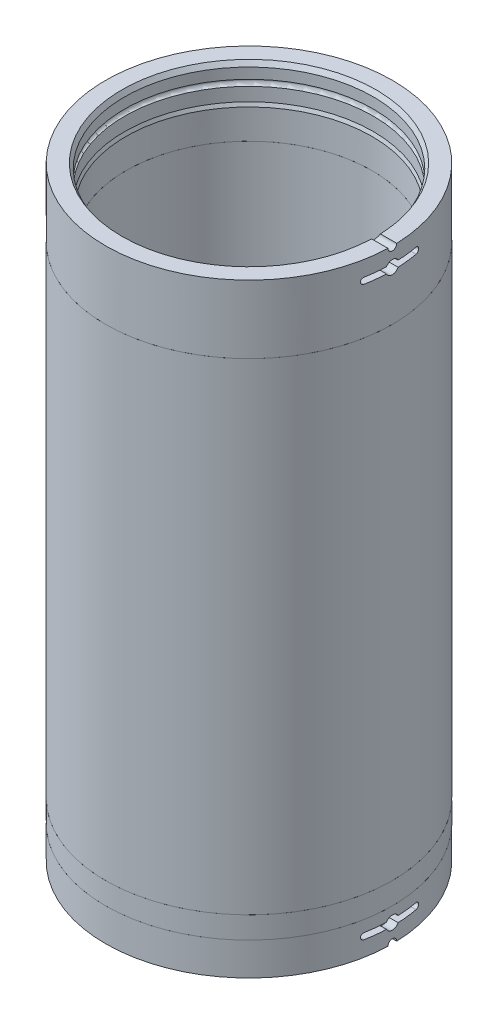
ISO-10303-21;
HEADER;
FILE_DESCRIPTION(('STEP AP214'),'2;1');
FILE_NAME('part.step','',(''),(''),'','','');
FILE_SCHEMA(('AUTOMOTIVE_DESIGN { 1 0 10303 214 1 1 1 1 }'));
ENDSEC;
DATA;
#1=APPLICATION_CONTEXT('core data for automotive mechanical design processes');
#2=APPLICATION_PROTOCOL_DEFINITION('international standard','automotive_design',2000,#1);
#3=PRODUCT_CONTEXT('',#1,'mechanical');
#4=PRODUCT('Part','Part','',(#3));
#5=PRODUCT_RELATED_PRODUCT_CATEGORY('part','',(#4));
#6=PRODUCT_DEFINITION_FORMATION('','',#4);
#7=PRODUCT_DEFINITION_CONTEXT('part definition',#1,'design');
#8=PRODUCT_DEFINITION('design','',#6,#7);
#9=PRODUCT_DEFINITION_SHAPE('','',#8);
#10=(LENGTH_UNIT() NAMED_UNIT(*) SI_UNIT(.MILLI.,.METRE.));
#11=(NAMED_UNIT(*) PLANE_ANGLE_UNIT() SI_UNIT($,.RADIAN.));
#12=(NAMED_UNIT(*) SI_UNIT($,.STERADIAN.) SOLID_ANGLE_UNIT());
#13=UNCERTAINTY_MEASURE_WITH_UNIT(LENGTH_MEASURE(1.E-05),#10,'distance_accuracy_value','');
#14=(GEOMETRIC_REPRESENTATION_CONTEXT(3) GLOBAL_UNCERTAINTY_ASSIGNED_CONTEXT((#13)) GLOBAL_UNIT_ASSIGNED_CONTEXT((#10,
#11,#12)) REPRESENTATION_CONTEXT('',''));
#15=CARTESIAN_POINT('',(0.,0.,0.));
#16=DIRECTION('',(0.,0.,1.));
#17=DIRECTION('',(1.,0.,0.));
#18=AXIS2_PLACEMENT_3D('',#15,#16,#17);
#19=CARTESIAN_POINT('',(0.,350.5962,3.81));
#20=DIRECTION('',(0.,1.,0.));
#21=DIRECTION('',(0.,0.,-1.));
#22=AXIS2_PLACEMENT_3D('',#19,#20,#21);
#23=CYLINDRICAL_SURFACE('',#22,72.1106);
#24=CARTESIAN_POINT('',(0.,338.1502,3.81));
#25=DIRECTION('',(0.,1.,0.));
#26=DIRECTION('',(0.,0.,-1.));
#27=AXIS2_PLACEMENT_3D('',#24,#25,#26);
#28=CIRCLE('',#27,72.1106);
#29=CARTESIAN_POINT('',(70.5091190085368,338.1502,18.923));
#30=VERTEX_POINT('',#29);
#31=CARTESIAN_POINT('',(72.0318250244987,338.1502,7.17969078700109));
#32=VERTEX_POINT('',#31);
#33=EDGE_CURVE('P0_E255',#30,#32,#28,.T.);
#34=ORIENTED_EDGE('',*,*,#33,.T.);
#35=CARTESIAN_POINT('',(72.0318250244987,338.1502,0.440309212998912));
#36=CARTESIAN_POINT('',(72.034164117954,338.055389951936,0.490323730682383));
#37=CARTESIAN_POINT('',(72.0366400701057,337.962707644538,0.544353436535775));
#38=CARTESIAN_POINT('',(72.0417908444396,337.782229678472,0.660019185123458));
#39=CARTESIAN_POINT('',(72.0444656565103,337.69443377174,0.721654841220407));
#40=CARTESIAN_POINT('',(72.0499376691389,337.524408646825,0.852068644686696));
#41=CARTESIAN_POINT('',(72.0527347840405,337.442175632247,0.920841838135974));
#42=CARTESIAN_POINT('',(72.058372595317,337.283811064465,1.06504249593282));
#43=CARTESIAN_POINT('',(72.0612132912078,337.207679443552,1.14046988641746));
#44=CARTESIAN_POINT('',(72.0696823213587,336.989195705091,1.37604671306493));
#45=CARTESIAN_POINT('',(72.0752600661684,336.85668132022,1.54554720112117));
#46=CARTESIAN_POINT('',(72.0856370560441,336.622091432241,1.9042884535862));
#47=CARTESIAN_POINT('',(72.0904364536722,336.520009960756,2.09352533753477));
#48=CARTESIAN_POINT('',(72.0987202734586,336.349059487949,2.48647272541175));
#49=CARTESIAN_POINT('',(72.1022049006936,336.280185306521,2.69018096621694));
#50=CARTESIAN_POINT('',(72.1074666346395,336.177617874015,3.10631550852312));
#51=CARTESIAN_POINT('',(72.1092435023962,336.143929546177,3.31874302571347));
#52=CARTESIAN_POINT('',(72.1108875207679,336.112729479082,3.74597578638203));
#53=CARTESIAN_POINT('',(72.11075708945,336.115171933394,3.96077767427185));
#54=CARTESIAN_POINT('',(72.1086071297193,336.156052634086,4.38689921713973));
#55=CARTESIAN_POINT('',(72.1065877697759,336.194487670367,4.5982191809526));
#56=CARTESIAN_POINT('',(72.100889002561,336.306218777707,5.01129643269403));
#57=CARTESIAN_POINT('',(72.0972103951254,336.379498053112,5.21305827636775));
#58=CARTESIAN_POINT('',(72.0886055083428,336.558854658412,5.60147169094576));
#59=CARTESIAN_POINT('',(72.0836789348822,336.664939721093,5.78811968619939));
#60=CARTESIAN_POINT('',(72.0731247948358,336.907040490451,6.14122691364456));
#61=CARTESIAN_POINT('',(72.0674961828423,337.043101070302,6.30765529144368));
#62=CARTESIAN_POINT('',(72.0561809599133,337.341171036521,6.61519455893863));
#63=CARTESIAN_POINT('',(72.0504944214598,337.503151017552,6.75633375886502));
#64=CARTESIAN_POINT('',(72.0427437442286,337.751022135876,6.9380628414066));
#65=CARTESIAN_POINT('',(72.0404421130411,337.82842922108,6.99053652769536));
#66=CARTESIAN_POINT('',(72.0360014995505,337.986748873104,7.08956607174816));
#67=CARTESIAN_POINT('',(72.0338622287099,338.067654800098,7.13613253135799));
#68=CARTESIAN_POINT('',(72.0318250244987,338.1502,7.17969078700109));
#69=B_SPLINE_CURVE_WITH_KNOTS('',3,(#35,#36,#37,#38,#39,#40,#41,#42,#43,#44,#45,#46,#47,#48,#49,
#50,#51,#52,#53,#54,#55,#56,#57,#58,#59,#60,#61,#62,#63,#64,#65,#66,#67,#68),.UNSPECIFIED.,.F.,
.F.,(4,2,2,2,2,2,2,2,2,2,2,2,2,2,2,2,4),(0.,0.321551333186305,0.643086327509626,
0.964399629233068,1.28570936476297,1.92805456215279,2.57027370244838,3.21239262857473,
3.85460138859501,4.49599602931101,5.13733347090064,5.77836208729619,6.41954191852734,
7.06168819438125,7.70311105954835,7.98353695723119,8.26345222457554),.UNSPECIFIED.);
#70=CARTESIAN_POINT('',(72.0318250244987,338.1502,0.440309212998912));
#71=VERTEX_POINT('',#70);
#72=EDGE_CURVE('P0_E123',#71,#32,#69,.T.);
#73=ORIENTED_EDGE('',*,*,#72,.F.);
#74=CARTESIAN_POINT('',(0.,338.1502,3.81));
#75=DIRECTION('',(0.,1.,0.));
#76=DIRECTION('',(0.,0.,-1.));
#77=AXIS2_PLACEMENT_3D('',#74,#75,#76);
#78=CIRCLE('',#77,72.1106);
#79=CARTESIAN_POINT('',(70.5091190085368,338.1502,-11.303));
#80=VERTEX_POINT('',#79);
#81=EDGE_CURVE('P0_E135',#71,#80,#78,.T.);
#82=ORIENTED_EDGE('',*,*,#81,.T.);
#83=EDGE_CURVE('P0_E108',#80,#30,#28,.T.);
#84=ORIENTED_EDGE('',*,*,#83,.T.);
#85=EDGE_LOOP('',(#34,#73,#82,#84));
#86=FACE_BOUND('',#85,.T.);
#87=CARTESIAN_POINT('',(0.,330.4032,3.81));
#88=DIRECTION('',(0.,1.,0.));
#89=DIRECTION('',(0.,0.,-1.));
#90=AXIS2_PLACEMENT_3D('',#87,#88,#89);
#91=CIRCLE('',#90,72.1106);
#92=CARTESIAN_POINT('',(0.,330.4032,-68.3006));
#93=VERTEX_POINT('',#92);
#94=EDGE_CURVE('P0_E11',#93,#93,#91,.T.);
#95=ORIENTED_EDGE('',*,*,#94,.F.);
#96=EDGE_LOOP('',(#95));
#97=FACE_BOUND('',#96,.T.);
#98=ADVANCED_FACE('P0_F16',(#86,#97),#23,.F.);
#99=CARTESIAN_POINT('',(0.,350.5962,3.81));
#100=DIRECTION('',(0.,-1.,0.));
#101=DIRECTION('',(0.,0.,1.));
#102=AXIS2_PLACEMENT_3D('',#99,#100,#101);
#103=PLANE('',#102);
#104=CARTESIAN_POINT('',(0.,350.5962,3.81));
#105=DIRECTION('',(0.,-1.,0.));
#106=DIRECTION('',(0.,0.,1.));
#107=AXIS2_PLACEMENT_3D('',#104,#105,#106);
#108=CIRCLE('',#107,73.6980999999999);
#109=CARTESIAN_POINT('',(73.6543165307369,350.5962,6.35));
#110=VERTEX_POINT('',#109);
#111=CARTESIAN_POINT('',(73.6543165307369,350.5962,1.27));
#112=VERTEX_POINT('',#111);
#113=EDGE_CURVE('P0_E266',#110,#112,#108,.T.);
#114=ORIENTED_EDGE('',*,*,#113,.T.);
#115=DIRECTION('',(1.,0.,0.));
#116=VECTOR('',#115,1.);
#117=CARTESIAN_POINT('',(-83.186,350.5962,1.27));
#118=LINE('',#117,#116);
#119=CARTESIAN_POINT('',(83.1462123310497,350.5962,1.27));
#120=VERTEX_POINT('',#119);
#121=EDGE_CURVE('P0_E152',#112,#120,#118,.T.);
#122=ORIENTED_EDGE('',*,*,#121,.T.);
#123=CARTESIAN_POINT('',(0.,350.5962,3.81));
#124=DIRECTION('',(0.,-1.,0.));
#125=DIRECTION('',(0.,0.,1.));
#126=AXIS2_PLACEMENT_3D('',#123,#124,#125);
#127=CIRCLE('',#126,83.185);
#128=CARTESIAN_POINT('',(83.1462123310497,350.5962,6.35));
#129=VERTEX_POINT('',#128);
#130=EDGE_CURVE('P0_E260',#129,#120,#127,.T.);
#131=ORIENTED_EDGE('',*,*,#130,.F.);
#132=DIRECTION('',(1.,0.,0.));
#133=VECTOR('',#132,1.);
#134=CARTESIAN_POINT('',(-83.186,350.5962,6.35));
#135=LINE('',#134,#133);
#136=EDGE_CURVE('P0_E238',#110,#129,#135,.T.);
#137=ORIENTED_EDGE('',*,*,#136,.F.);
#138=EDGE_LOOP('',(#114,#122,#131,#137));
#139=FACE_BOUND('',#138,.T.);
#140=ADVANCED_FACE('P0_F176',(#139),#103,.F.);
#141=CARTESIAN_POINT('',(0.,321.31,3.81));
#142=DIRECTION('',(0.,1.,0.));
#143=DIRECTION('',(0.,0.,-1.));
#144=AXIS2_PLACEMENT_3D('',#141,#142,#143);
#145=CYLINDRICAL_SURFACE('',#144,83.185);
#146=CARTESIAN_POINT('',(0.,341.7062,3.81));
#147=DIRECTION('',(0.,1.,0.));
#148=DIRECTION('',(0.,0.,-1.));
#149=AXIS2_PLACEMENT_3D('',#146,#147,#148);
#150=CIRCLE('',#149,83.185);
#151=CARTESIAN_POINT('',(81.8006201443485,341.7062,18.923));
#152=VERTEX_POINT('',#151);
#153=CARTESIAN_POINT('',(83.1167215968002,341.7062,7.17969078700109));
#154=VERTEX_POINT('',#153);
#155=EDGE_CURVE('P0_E237',#152,#154,#150,.T.);
#156=ORIENTED_EDGE('',*,*,#155,.T.);
#157=CARTESIAN_POINT('',(83.0977022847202,339.9282,7.62));
#158=CARTESIAN_POINT('',(83.0977034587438,340.142088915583,7.61999055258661));
#159=CARTESIAN_POINT('',(83.0985369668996,340.356130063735,7.60192830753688));
#160=CARTESIAN_POINT('',(83.1017815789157,340.778309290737,7.53012970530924));
#161=CARTESIAN_POINT('',(83.1041945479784,340.986440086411,7.47635116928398));
#162=CARTESIAN_POINT('',(83.110324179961,341.390621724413,7.33466155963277));
#163=CARTESIAN_POINT('',(83.1140401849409,341.586678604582,7.2467677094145));
#164=CARTESIAN_POINT('',(83.1223563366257,341.961201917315,7.03936846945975));
#165=CARTESIAN_POINT('',(83.1269562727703,342.1396725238,6.91987060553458));
#166=CARTESIAN_POINT('',(83.1365265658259,342.474166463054,6.65253851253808));
#167=CARTESIAN_POINT('',(83.1414972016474,342.630172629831,6.50468281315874));
#168=CARTESIAN_POINT('',(83.1512461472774,342.915163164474,6.18487432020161));
#169=CARTESIAN_POINT('',(83.1560244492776,343.044146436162,6.01292054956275));
#170=CARTESIAN_POINT('',(83.1648522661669,343.271474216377,5.64971084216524));
#171=CARTESIAN_POINT('',(83.1689014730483,343.36980578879,5.45844680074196));
#172=CARTESIAN_POINT('',(83.1758120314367,343.532955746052,5.06210299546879));
#173=CARTESIAN_POINT('',(83.1786733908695,343.597774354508,4.85702332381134));
#174=CARTESIAN_POINT('',(83.1828839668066,343.692014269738,4.43902368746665));
#175=CARTESIAN_POINT('',(83.1842342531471,343.721460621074,4.22610938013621));
#176=CARTESIAN_POINT('',(83.1852740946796,343.744197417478,3.79835582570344));
#177=CARTESIAN_POINT('',(83.1849636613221,343.737488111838,3.58351659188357));
#178=CARTESIAN_POINT('',(83.1827179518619,343.68812488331,3.15818126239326));
#179=CARTESIAN_POINT('',(83.1807838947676,343.645497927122,2.94768202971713));
#180=CARTESIAN_POINT('',(83.175510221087,343.525551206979,2.53683019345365));
#181=CARTESIAN_POINT('',(83.1721705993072,343.448231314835,2.33647762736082));
#182=CARTESIAN_POINT('',(83.1644599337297,343.261062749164,1.95151952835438));
#183=CARTESIAN_POINT('',(83.1600884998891,343.151201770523,1.76691998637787));
#184=CARTESIAN_POINT('',(83.1508065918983,342.902078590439,1.41877355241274));
#185=CARTESIAN_POINT('',(83.1458961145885,342.762816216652,1.25522678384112));
#186=CARTESIAN_POINT('',(83.136083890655,342.458690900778,0.95367114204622));
#187=CARTESIAN_POINT('',(83.1311821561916,342.29380456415,0.81568586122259));
#188=CARTESIAN_POINT('',(83.1219445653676,341.943194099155,0.569351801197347));
#189=CARTESIAN_POINT('',(83.1176087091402,341.757469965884,0.461003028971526));
#190=CARTESIAN_POINT('',(83.1099921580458,341.370441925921,0.277019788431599));
#191=CARTESIAN_POINT('',(83.1067114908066,341.169137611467,0.201386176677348));
#192=CARTESIAN_POINT('',(83.1015763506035,340.756669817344,0.0849958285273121));
#193=CARTESIAN_POINT('',(83.0997218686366,340.545506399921,0.0442388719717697));
#194=CARTESIAN_POINT('',(83.0976498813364,340.11952000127,-0.00121210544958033));
#195=CARTESIAN_POINT('',(83.0974308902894,339.904700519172,-0.00593885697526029));
#196=CARTESIAN_POINT('',(83.0986507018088,339.4773193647,0.0207193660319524));
#197=CARTESIAN_POINT('',(83.1000894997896,339.264757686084,0.052104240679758));
#198=CARTESIAN_POINT('',(83.1044613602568,338.848017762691,0.150067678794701));
#199=CARTESIAN_POINT('',(83.1073937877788,338.643835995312,0.216631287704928));
#200=CARTESIAN_POINT('',(83.114421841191,338.24954342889,0.383047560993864));
#201=CARTESIAN_POINT('',(83.1185174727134,338.059432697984,0.482900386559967));
#202=CARTESIAN_POINT('',(83.1274139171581,337.698528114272,0.713144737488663));
#203=CARTESIAN_POINT('',(83.1322152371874,337.527748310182,0.843558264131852));
#204=CARTESIAN_POINT('',(83.1419800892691,337.210494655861,1.13118987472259));
#205=CARTESIAN_POINT('',(83.1469436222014,337.064020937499,1.288408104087));
#206=CARTESIAN_POINT('',(83.1564777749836,336.799427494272,1.62532676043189));
#207=CARTESIAN_POINT('',(83.1610481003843,336.681328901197,1.8050437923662));
#208=CARTESIAN_POINT('',(83.169276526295,336.476982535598,2.18177446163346));
#209=CARTESIAN_POINT('',(83.1729346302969,336.390734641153,2.37878803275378));
#210=CARTESIAN_POINT('',(83.1789249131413,336.252574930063,2.78444041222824));
#211=CARTESIAN_POINT('',(83.1812576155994,336.200649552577,2.9930745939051));
#212=CARTESIAN_POINT('',(83.1843362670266,336.132564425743,3.41611076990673));
#213=CARTESIAN_POINT('',(83.1850822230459,336.116404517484,3.63051273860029));
#214=CARTESIAN_POINT('',(83.1849033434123,336.120310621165,4.05878842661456));
#215=CARTESIAN_POINT('',(83.183980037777,336.140343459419,4.27266244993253));
#216=CARTESIAN_POINT('',(83.1805696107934,336.2159978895,4.69400760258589));
#217=CARTESIAN_POINT('',(83.1780824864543,336.271619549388,4.90147871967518));
#218=CARTESIAN_POINT('',(83.1718243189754,336.416866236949,5.30413645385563));
#219=CARTESIAN_POINT('',(83.1680532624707,336.506491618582,5.49932294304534));
#220=CARTESIAN_POINT('',(83.1596515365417,336.717195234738,5.87187903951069));
#221=CARTESIAN_POINT('',(83.1550208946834,336.838272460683,6.04924921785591));
#222=CARTESIAN_POINT('',(83.1454165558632,337.108559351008,6.38130208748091));
#223=CARTESIAN_POINT('',(83.1404425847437,337.25779166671,6.53596633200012));
#224=CARTESIAN_POINT('',(83.1307138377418,337.580146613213,6.81809348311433));
#225=CARTESIAN_POINT('',(83.1259591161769,337.753275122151,6.94554967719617));
#226=CARTESIAN_POINT('',(83.1172023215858,338.118626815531,7.16969283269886));
#227=CARTESIAN_POINT('',(83.1132009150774,338.310866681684,7.26635259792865));
#228=CARTESIAN_POINT('',(83.1064128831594,338.708719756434,7.4259093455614));
#229=CARTESIAN_POINT('',(83.1036248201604,338.914316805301,7.4888463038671));
#230=CARTESIAN_POINT('',(83.1003178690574,339.255697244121,7.56261940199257));
#231=CARTESIAN_POINT('',(83.099341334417,339.389268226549,7.58410975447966));
#232=CARTESIAN_POINT('',(83.0980331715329,339.657939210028,7.61280303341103));
#233=CARTESIAN_POINT('',(83.0977015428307,339.793039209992,7.62000597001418));
#234=CARTESIAN_POINT('',(83.0977022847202,339.9282,7.62));
#235=B_SPLINE_CURVE_WITH_KNOTS('',3,(#157,#158,#159,#160,#161,#162,#163,#164,#165,#166,#167,
#168,#169,#170,#171,#172,#173,#174,#175,#176,#177,#178,#179,#180,#181,#182,#183,#184,#185,#186,
#187,#188,#189,#190,#191,#192,#193,#194,#195,#196,#197,#198,#199,#200,#201,#202,#203,#204,#205,
#206,#207,#208,#209,#210,#211,#212,#213,#214,#215,#216,#217,#218,#219,#220,#221,#222,#223,#224,
#225,#226,#227,#228,#229,#230,#231,#232,#233,#234),.UNSPECIFIED.,.T.,.F.,(4,2,2,2,2,2,2,2,2,2,2,
2,2,2,2,2,2,2,2,2,2,2,2,2,2,2,2,2,2,2,2,2,2,2,2,2,2,2,4),(0.,0.641173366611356,1.28310527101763,
1.92471351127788,2.56616910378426,3.20811228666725,3.85008150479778,4.49232129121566,
5.13455679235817,5.77633730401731,6.41811339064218,7.05940806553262,7.70070510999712,
8.34224496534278,8.98378858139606,9.62592140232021,10.2680543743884,10.9102041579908,
11.5523498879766,12.1939122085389,12.8354727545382,13.4767607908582,14.1180519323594,
14.7598061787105,15.4015639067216,16.0437980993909,16.6860298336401,17.3280076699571,
17.9699826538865,18.6113695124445,19.252757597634,19.8941523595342,20.5355265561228,
21.1774189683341,21.8194695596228,22.4620855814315,23.1039381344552,23.5091090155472,
23.9142796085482),.UNSPECIFIED.);
#236=CARTESIAN_POINT('',(83.1167215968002,341.7062,0.440309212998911));
#237=VERTEX_POINT('',#236);
#238=EDGE_CURVE('P0_E115',#154,#237,#235,.T.);
#239=ORIENTED_EDGE('',*,*,#238,.T.);
#240=CARTESIAN_POINT('',(0.,341.7062,3.81));
#241=DIRECTION('',(0.,1.,0.));
#242=DIRECTION('',(0.,0.,-1.));
#243=AXIS2_PLACEMENT_3D('',#240,#241,#242);
#244=CIRCLE('',#243,83.185);
#245=CARTESIAN_POINT('',(81.8006201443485,341.7062,-11.303));
#246=VERTEX_POINT('',#245);
#247=EDGE_CURVE('P0_E222',#237,#246,#244,.T.);
#248=ORIENTED_EDGE('',*,*,#247,.T.);
#249=CARTESIAN_POINT('',(82.1092077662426,339.9282,-9.52500000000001));
#250=CARTESIAN_POINT('',(82.1092071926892,340.027077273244,-9.52500452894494));
#251=CARTESIAN_POINT('',(82.1078647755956,340.126026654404,-9.53327752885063));
#252=CARTESIAN_POINT('',(82.1025164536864,340.321184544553,-9.56614605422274));
#253=CARTESIAN_POINT('',(82.0985073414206,340.417389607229,-9.59076123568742));
#254=CARTESIAN_POINT('',(82.0879054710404,340.604186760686,-9.65555127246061));
#255=CARTESIAN_POINT('',(82.0813145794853,340.694782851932,-9.69571488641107));
#256=CARTESIAN_POINT('',(82.0656821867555,340.867877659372,-9.7903794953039));
#257=CARTESIAN_POINT('',(82.0566412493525,340.950378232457,-9.84487719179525));
#258=CARTESIAN_POINT('',(82.0362386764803,341.10547244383,-9.96692292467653));
#259=CARTESIAN_POINT('',(82.0248649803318,341.178011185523,-10.0345386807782));
#260=CARTESIAN_POINT('',(82.0000687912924,341.31072249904,-10.1806548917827));
#261=CARTESIAN_POINT('',(81.9866461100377,341.37089393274,-10.2591563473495));
#262=CARTESIAN_POINT('',(81.9578708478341,341.477970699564,-10.4258301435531));
#263=CARTESIAN_POINT('',(81.94249637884,341.524702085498,-10.5141104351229));
#264=CARTESIAN_POINT('',(81.9103134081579,341.602699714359,-10.6970120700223));
#265=CARTESIAN_POINT('',(81.8935047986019,341.633964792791,-10.7916338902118));
#266=CARTESIAN_POINT('',(81.8586210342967,341.680595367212,-10.9859542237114));
#267=CARTESIAN_POINT('',(81.8405313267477,341.695729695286,-11.0857056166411));
#268=CARTESIAN_POINT('',(81.8037803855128,341.708958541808,-11.2862290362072));
#269=CARTESIAN_POINT('',(81.7851191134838,341.707051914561,-11.3870011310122));
#270=CARTESIAN_POINT('',(81.7475523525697,341.686171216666,-11.5878066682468));
#271=CARTESIAN_POINT('',(81.7286463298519,341.667021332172,-11.6878217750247));
#272=CARTESIAN_POINT('',(81.6913519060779,341.611926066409,-11.8832198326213));
#273=CARTESIAN_POINT('',(81.672963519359,341.575980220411,-11.9786026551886));
#274=CARTESIAN_POINT('',(81.6372813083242,341.488205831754,-12.1620779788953));
#275=CARTESIAN_POINT('',(81.6199883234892,341.436365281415,-12.2501649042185));
#276=CARTESIAN_POINT('',(81.5871074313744,341.318189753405,-12.4163771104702));
#277=CARTESIAN_POINT('',(81.571519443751,341.251855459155,-12.4945028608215));
#278=CARTESIAN_POINT('',(81.5427847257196,341.107324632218,-12.6376066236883));
#279=CARTESIAN_POINT('',(81.52961255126,341.029269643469,-12.7027224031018));
#280=CARTESIAN_POINT('',(81.5060033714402,340.862930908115,-12.8188653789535));
#281=CARTESIAN_POINT('',(81.4955660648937,340.774648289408,-12.8698941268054));
#282=CARTESIAN_POINT('',(81.4780199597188,340.592161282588,-12.9553919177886));
#283=CARTESIAN_POINT('',(81.4708515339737,340.4981017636,-12.9901579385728));
#284=CARTESIAN_POINT('',(81.4598492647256,340.305299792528,-13.0434248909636));
#285=CARTESIAN_POINT('',(81.4560150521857,340.206557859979,-13.0619276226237));
#286=CARTESIAN_POINT('',(81.4518776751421,340.008986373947,-13.0818900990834));
#287=CARTESIAN_POINT('',(81.451515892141,339.910186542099,-13.0836327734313));
#288=CARTESIAN_POINT('',(81.4541851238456,339.713708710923,-13.0707580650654));
#289=CARTESIAN_POINT('',(81.4572159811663,339.616030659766,-13.0561414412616));
#290=CARTESIAN_POINT('',(81.4665217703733,339.425075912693,-13.0111347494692));
#291=CARTESIAN_POINT('',(81.4727800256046,339.331779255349,-12.980825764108));
#292=CARTESIAN_POINT('',(81.4882829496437,339.15163509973,-12.9054252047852));
#293=CARTESIAN_POINT('',(81.4975277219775,339.064787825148,-12.8603331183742));
#294=CARTESIAN_POINT('',(81.5187521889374,338.899094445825,-12.7562338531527));
#295=CARTESIAN_POINT('',(81.5307568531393,338.82033152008,-12.6970994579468));
#296=CARTESIAN_POINT('',(81.5570107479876,338.673821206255,-12.5668929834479));
#297=CARTESIAN_POINT('',(81.5712601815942,338.606074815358,-12.4958198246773));
#298=CARTESIAN_POINT('',(81.6017912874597,338.482185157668,-12.3423405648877));
#299=CARTESIAN_POINT('',(81.6181055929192,338.426278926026,-12.2597496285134));
#300=CARTESIAN_POINT('',(81.6520056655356,338.329103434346,-12.086602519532));
#301=CARTESIAN_POINT('',(81.6695915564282,338.287835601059,-11.9960455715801));
#302=CARTESIAN_POINT('',(81.7057998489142,338.220386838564,-11.8078050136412));
#303=CARTESIAN_POINT('',(81.7244350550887,338.194484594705,-11.7100239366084));
#304=CARTESIAN_POINT('',(81.7618827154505,338.159595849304,-11.5115195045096));
#305=CARTESIAN_POINT('',(81.7806951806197,338.150610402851,-11.4107959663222));
#306=CARTESIAN_POINT('',(81.8181153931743,338.149813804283,-11.2083521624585));
#307=CARTESIAN_POINT('',(81.8367200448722,338.158149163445,-11.106630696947));
#308=CARTESIAN_POINT('',(81.8730445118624,338.192114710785,-10.9059508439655));
#309=CARTESIAN_POINT('',(81.8907643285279,338.21774487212,-10.8069924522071));
#310=CARTESIAN_POINT('',(81.9247962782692,338.285547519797,-10.615028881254));
#311=CARTESIAN_POINT('',(81.9411128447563,338.327665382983,-10.5220052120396));
#312=CARTESIAN_POINT('',(81.9719936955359,338.427340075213,-10.3443143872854));
#313=CARTESIAN_POINT('',(81.9865581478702,338.484895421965,-10.2596464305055));
#314=CARTESIAN_POINT('',(82.0134240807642,338.613093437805,-10.1021821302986));
#315=CARTESIAN_POINT('',(82.0257505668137,338.683571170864,-10.0292557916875));
#316=CARTESIAN_POINT('',(82.0480771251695,338.836123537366,-9.89626955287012));
#317=CARTESIAN_POINT('',(82.058076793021,338.918200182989,-9.83621188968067));
#318=CARTESIAN_POINT('',(82.0754067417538,339.090368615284,-9.73158837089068));
#319=CARTESIAN_POINT('',(82.0827720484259,339.180333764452,-9.68681963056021));
#320=CARTESIAN_POINT('',(82.0948660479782,339.366593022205,-9.61306241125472));
#321=CARTESIAN_POINT('',(82.0995981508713,339.462878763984,-9.58405352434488));
#322=CARTESIAN_POINT('',(82.1050447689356,339.621215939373,-9.55061382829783));
#323=CARTESIAN_POINT('',(82.1066044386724,339.682196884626,-9.54102150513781));
#324=CARTESIAN_POINT('',(82.1086861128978,339.804842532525,-9.52821319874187));
#325=CARTESIAN_POINT('',(82.1092081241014,339.866507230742,-9.52499717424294));
#326=CARTESIAN_POINT('',(82.1092077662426,339.9282,-9.52500000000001));
#327=B_SPLINE_CURVE_WITH_KNOTS('',3,(#249,#250,#251,#252,#253,#254,#255,#256,#257,#258,#259,
#260,#261,#262,#263,#264,#265,#266,#267,#268,#269,#270,#271,#272,#273,#274,#275,#276,#277,#278,
#279,#280,#281,#282,#283,#284,#285,#286,#287,#288,#289,#290,#291,#292,#293,#294,#295,#296,#297,
#298,#299,#300,#301,#302,#303,#304,#305,#306,#307,#308,#309,#310,#311,#312,#313,#314,#315,#316,
#317,#318,#319,#320,#321,#322,#323,#324,#325,#326),.UNSPECIFIED.,.T.,.F.,(4,2,2,2,2,2,2,2,2,2,2,
2,2,2,2,2,2,2,2,2,2,2,2,2,2,2,2,2,2,2,2,2,2,2,2,2,2,2,4),(0.,0.296405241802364,
0.593167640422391,0.889715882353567,1.18619594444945,1.48424934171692,1.78233015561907,
2.08411112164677,2.38591480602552,2.69198773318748,2.99808123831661,3.30733148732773,
3.61659029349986,3.92608330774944,4.23556173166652,4.54156551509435,4.84753558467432,
5.1476762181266,5.44778362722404,5.74281579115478,6.03783426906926,6.33134337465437,
6.62486265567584,6.92114997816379,7.21746410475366,7.51924305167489,7.82105140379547,
8.12817838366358,8.43532451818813,8.74507927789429,9.05483355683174,9.36357019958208,
9.67227720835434,9.97728826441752,10.2823522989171,10.5831946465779,10.8836464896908,
11.068584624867,11.2535215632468),.UNSPECIFIED.);
#328=CARTESIAN_POINT('',(81.8006201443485,338.1502,-11.303));
#329=VERTEX_POINT('',#328);
#330=EDGE_CURVE('P0_E196',#246,#329,#327,.T.);
#331=ORIENTED_EDGE('',*,*,#330,.T.);
#332=CARTESIAN_POINT('',(0.,338.1502,3.81));
#333=DIRECTION('',(0.,1.,0.));
#334=DIRECTION('',(0.,0.,-1.));
#335=AXIS2_PLACEMENT_3D('',#332,#333,#334);
#336=CIRCLE('',#335,83.185);
#337=CARTESIAN_POINT('',(83.1167215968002,338.1502,0.440309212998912));
#338=VERTEX_POINT('',#337);
#339=EDGE_CURVE('P0_E168',#338,#329,#336,.T.);
#340=ORIENTED_EDGE('',*,*,#339,.F.);
#341=CARTESIAN_POINT('',(83.0977022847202,339.9282,7.62));
#342=CARTESIAN_POINT('',(83.0977034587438,340.142088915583,7.61999055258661));
#343=CARTESIAN_POINT('',(83.0985369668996,340.356130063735,7.60192830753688));
#344=CARTESIAN_POINT('',(83.1017815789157,340.778309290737,7.53012970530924));
#345=CARTESIAN_POINT('',(83.1041945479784,340.986440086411,7.47635116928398));
#346=CARTESIAN_POINT('',(83.110324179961,341.390621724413,7.33466155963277));
#347=CARTESIAN_POINT('',(83.1140401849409,341.586678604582,7.2467677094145));
#348=CARTESIAN_POINT('',(83.1223563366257,341.961201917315,7.03936846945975));
#349=CARTESIAN_POINT('',(83.1269562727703,342.1396725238,6.91987060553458));
#350=CARTESIAN_POINT('',(83.1365265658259,342.474166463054,6.65253851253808));
#351=CARTESIAN_POINT('',(83.1414972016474,342.630172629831,6.50468281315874));
#352=CARTESIAN_POINT('',(83.1512461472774,342.915163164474,6.18487432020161));
#353=CARTESIAN_POINT('',(83.1560244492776,343.044146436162,6.01292054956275));
#354=CARTESIAN_POINT('',(83.1648522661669,343.271474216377,5.64971084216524));
#355=CARTESIAN_POINT('',(83.1689014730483,343.36980578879,5.45844680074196));
#356=CARTESIAN_POINT('',(83.1758120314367,343.532955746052,5.06210299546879));
#357=CARTESIAN_POINT('',(83.1786733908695,343.597774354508,4.85702332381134));
#358=CARTESIAN_POINT('',(83.1828839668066,343.692014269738,4.43902368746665));
#359=CARTESIAN_POINT('',(83.1842342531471,343.721460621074,4.22610938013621));
#360=CARTESIAN_POINT('',(83.1852740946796,343.744197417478,3.79835582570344));
#361=CARTESIAN_POINT('',(83.1849636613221,343.737488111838,3.58351659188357));
#362=CARTESIAN_POINT('',(83.1827179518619,343.68812488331,3.15818126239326));
#363=CARTESIAN_POINT('',(83.1807838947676,343.645497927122,2.94768202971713));
#364=CARTESIAN_POINT('',(83.175510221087,343.525551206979,2.53683019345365));
#365=CARTESIAN_POINT('',(83.1721705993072,343.448231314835,2.33647762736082));
#366=CARTESIAN_POINT('',(83.1644599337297,343.261062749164,1.95151952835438));
#367=CARTESIAN_POINT('',(83.1600884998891,343.151201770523,1.76691998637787));
#368=CARTESIAN_POINT('',(83.1508065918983,342.902078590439,1.41877355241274));
#369=CARTESIAN_POINT('',(83.1458961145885,342.762816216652,1.25522678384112));
#370=CARTESIAN_POINT('',(83.136083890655,342.458690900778,0.95367114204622));
#371=CARTESIAN_POINT('',(83.1311821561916,342.29380456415,0.81568586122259));
#372=CARTESIAN_POINT('',(83.1219445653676,341.943194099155,0.569351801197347));
#373=CARTESIAN_POINT('',(83.1176087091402,341.757469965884,0.461003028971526));
#374=CARTESIAN_POINT('',(83.1099921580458,341.370441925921,0.277019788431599));
#375=CARTESIAN_POINT('',(83.1067114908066,341.169137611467,0.201386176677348));
#376=CARTESIAN_POINT('',(83.1015763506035,340.756669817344,0.0849958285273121));
#377=CARTESIAN_POINT('',(83.0997218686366,340.545506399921,0.0442388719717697));
#378=CARTESIAN_POINT('',(83.0976498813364,340.11952000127,-0.00121210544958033));
#379=CARTESIAN_POINT('',(83.0974308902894,339.904700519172,-0.00593885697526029));
#380=CARTESIAN_POINT('',(83.0986507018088,339.4773193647,0.0207193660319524));
#381=CARTESIAN_POINT('',(83.1000894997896,339.264757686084,0.052104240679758));
#382=CARTESIAN_POINT('',(83.1044613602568,338.848017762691,0.150067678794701));
#383=CARTESIAN_POINT('',(83.1073937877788,338.643835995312,0.216631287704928));
#384=CARTESIAN_POINT('',(83.114421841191,338.24954342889,0.383047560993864));
#385=CARTESIAN_POINT('',(83.1185174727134,338.059432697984,0.482900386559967));
#386=CARTESIAN_POINT('',(83.1274139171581,337.698528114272,0.713144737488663));
#387=CARTESIAN_POINT('',(83.1322152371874,337.527748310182,0.843558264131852));
#388=CARTESIAN_POINT('',(83.1419800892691,337.210494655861,1.13118987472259));
#389=CARTESIAN_POINT('',(83.1469436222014,337.064020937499,1.288408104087));
#390=CARTESIAN_POINT('',(83.1564777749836,336.799427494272,1.62532676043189));
#391=CARTESIAN_POINT('',(83.1610481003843,336.681328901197,1.8050437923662));
#392=CARTESIAN_POINT('',(83.169276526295,336.476982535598,2.18177446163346));
#393=CARTESIAN_POINT('',(83.1729346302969,336.390734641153,2.37878803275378));
#394=CARTESIAN_POINT('',(83.1789249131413,336.252574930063,2.78444041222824));
#395=CARTESIAN_POINT('',(83.1812576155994,336.200649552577,2.9930745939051));
#396=CARTESIAN_POINT('',(83.1843362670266,336.132564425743,3.41611076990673));
#397=CARTESIAN_POINT('',(83.1850822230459,336.116404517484,3.63051273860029));
#398=CARTESIAN_POINT('',(83.1849033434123,336.120310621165,4.05878842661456));
#399=CARTESIAN_POINT('',(83.183980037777,336.140343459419,4.27266244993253));
#400=CARTESIAN_POINT('',(83.1805696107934,336.2159978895,4.69400760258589));
#401=CARTESIAN_POINT('',(83.1780824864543,336.271619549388,4.90147871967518));
#402=CARTESIAN_POINT('',(83.1718243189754,336.416866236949,5.30413645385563));
#403=CARTESIAN_POINT('',(83.1680532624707,336.506491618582,5.49932294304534));
#404=CARTESIAN_POINT('',(83.1596515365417,336.717195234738,5.87187903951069));
#405=CARTESIAN_POINT('',(83.1550208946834,336.838272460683,6.04924921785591));
#406=CARTESIAN_POINT('',(83.1454165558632,337.108559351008,6.38130208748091));
#407=CARTESIAN_POINT('',(83.1404425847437,337.25779166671,6.53596633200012));
#408=CARTESIAN_POINT('',(83.1307138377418,337.580146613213,6.81809348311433));
#409=CARTESIAN_POINT('',(83.1259591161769,337.753275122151,6.94554967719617));
#410=CARTESIAN_POINT('',(83.1172023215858,338.118626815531,7.16969283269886));
#411=CARTESIAN_POINT('',(83.1132009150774,338.310866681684,7.26635259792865));
#412=CARTESIAN_POINT('',(83.1064128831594,338.708719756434,7.4259093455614));
#413=CARTESIAN_POINT('',(83.1036248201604,338.914316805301,7.4888463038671));
#414=CARTESIAN_POINT('',(83.1003178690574,339.255697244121,7.56261940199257));
#415=CARTESIAN_POINT('',(83.099341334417,339.389268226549,7.58410975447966));
#416=CARTESIAN_POINT('',(83.0980331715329,339.657939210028,7.61280303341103));
#417=CARTESIAN_POINT('',(83.0977015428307,339.793039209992,7.62000597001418));
#418=CARTESIAN_POINT('',(83.0977022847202,339.9282,7.62));
#419=B_SPLINE_CURVE_WITH_KNOTS('',3,(#341,#342,#343,#344,#345,#346,#347,#348,#349,#350,#351,
#352,#353,#354,#355,#356,#357,#358,#359,#360,#361,#362,#363,#364,#365,#366,#367,#368,#369,#370,
#371,#372,#373,#374,#375,#376,#377,#378,#379,#380,#381,#382,#383,#384,#385,#386,#387,#388,#389,
#390,#391,#392,#393,#394,#395,#396,#397,#398,#399,#400,#401,#402,#403,#404,#405,#406,#407,#408,
#409,#410,#411,#412,#413,#414,#415,#416,#417,#418),.UNSPECIFIED.,.T.,.F.,(4,2,2,2,2,2,2,2,2,2,2,
2,2,2,2,2,2,2,2,2,2,2,2,2,2,2,2,2,2,2,2,2,2,2,2,2,2,2,4),(0.,0.641173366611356,1.28310527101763,
1.92471351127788,2.56616910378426,3.20811228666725,3.85008150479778,4.49232129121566,
5.13455679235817,5.77633730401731,6.41811339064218,7.05940806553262,7.70070510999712,
8.34224496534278,8.98378858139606,9.62592140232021,10.2680543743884,10.9102041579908,
11.5523498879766,12.1939122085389,12.8354727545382,13.4767607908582,14.1180519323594,
14.7598061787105,15.4015639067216,16.0437980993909,16.6860298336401,17.3280076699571,
17.9699826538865,18.6113695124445,19.252757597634,19.8941523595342,20.5355265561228,
21.1774189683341,21.8194695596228,22.4620855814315,23.1039381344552,23.5091090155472,
23.9142796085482),.UNSPECIFIED.);
#420=CARTESIAN_POINT('',(83.1167215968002,338.1502,7.17969078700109));
#421=VERTEX_POINT('',#420);
#422=EDGE_CURVE('P0_E164',#338,#421,#419,.T.);
#423=ORIENTED_EDGE('',*,*,#422,.T.);
#424=CARTESIAN_POINT('',(0.,338.1502,3.81));
#425=DIRECTION('',(0.,1.,0.));
#426=DIRECTION('',(0.,0.,-1.));
#427=AXIS2_PLACEMENT_3D('',#424,#425,#426);
#428=CIRCLE('',#427,83.185);
#429=CARTESIAN_POINT('',(81.8006201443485,338.1502,18.923));
#430=VERTEX_POINT('',#429);
#431=EDGE_CURVE('P0_E202',#430,#421,#428,.T.);
#432=ORIENTED_EDGE('',*,*,#431,.F.);
#433=CARTESIAN_POINT('',(81.4520616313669,339.9282,20.701));
#434=CARTESIAN_POINT('',(81.4520627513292,340.026574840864,20.7009953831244));
#435=CARTESIAN_POINT('',(81.4537623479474,340.125021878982,20.6928052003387));
#436=CARTESIAN_POINT('',(81.460497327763,340.319174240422,20.660277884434));
#437=CARTESIAN_POINT('',(81.4655367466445,340.414876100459,20.6359212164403));
#438=CARTESIAN_POINT('',(81.4787430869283,340.600666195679,20.5718528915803));
#439=CARTESIAN_POINT('',(81.4869070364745,340.690759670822,20.5321558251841));
#440=CARTESIAN_POINT('',(81.5060415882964,340.862928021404,20.4386402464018));
#441=CARTESIAN_POINT('',(81.5170116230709,340.945004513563,20.3848245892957));
#442=CARTESIAN_POINT('',(81.5414706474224,341.099747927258,20.2640757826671));
#443=CARTESIAN_POINT('',(81.5549832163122,341.172315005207,20.197019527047));
#444=CARTESIAN_POINT('',(81.5839733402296,341.305206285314,20.0520741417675));
#445=CARTESIAN_POINT('',(81.5994511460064,341.365528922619,19.9741836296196));
#446=CARTESIAN_POINT('',(81.6321661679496,341.473442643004,19.808154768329));
#447=CARTESIAN_POINT('',(81.6494315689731,341.52076562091,19.7198476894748));
#448=CARTESIAN_POINT('',(81.6849031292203,341.599903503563,19.5367135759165));
#449=CARTESIAN_POINT('',(81.7031093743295,341.631716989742,19.4418859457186));
#450=CARTESIAN_POINT('',(81.7401924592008,341.679389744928,19.2468119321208));
#451=CARTESIAN_POINT('',(81.7590753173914,341.694994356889,19.1465043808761));
#452=CARTESIAN_POINT('',(81.7966791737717,341.708944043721,18.9446635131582));
#453=CARTESIAN_POINT('',(81.81540016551,341.707288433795,18.8431301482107));
#454=CARTESIAN_POINT('',(81.8522455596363,341.68667235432,18.6412071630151));
#455=CARTESIAN_POINT('',(81.8703666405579,341.667628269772,18.5408254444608));
#456=CARTESIAN_POINT('',(81.9054295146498,341.612577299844,18.3446062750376));
#457=CARTESIAN_POINT('',(81.9223713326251,341.576570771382,18.2487687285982));
#458=CARTESIAN_POINT('',(81.9545366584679,341.488815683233,18.0650620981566));
#459=CARTESIAN_POINT('',(81.9697706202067,341.43717097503,17.9771452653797));
#460=CARTESIAN_POINT('',(81.9982764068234,341.319444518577,17.8112138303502));
#461=CARTESIAN_POINT('',(82.011548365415,341.253363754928,17.7331985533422));
#462=CARTESIAN_POINT('',(82.035659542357,341.109573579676,17.5904199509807));
#463=CARTESIAN_POINT('',(82.0465287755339,341.03203056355,17.5254941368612));
#464=CARTESIAN_POINT('',(82.0658181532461,340.866861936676,17.4096021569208));
#465=CARTESIAN_POINT('',(82.0742384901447,340.779237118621,17.3586348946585));
#466=CARTESIAN_POINT('',(82.0883530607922,340.597703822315,17.2728522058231));
#467=CARTESIAN_POINT('',(82.0940834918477,340.50389937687,17.2378225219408));
#468=CARTESIAN_POINT('',(82.1028741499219,340.311629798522,17.1839684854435));
#469=CARTESIAN_POINT('',(82.1059345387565,340.213164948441,17.1651431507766));
#470=CARTESIAN_POINT('',(82.109308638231,340.015377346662,17.1443830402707));
#471=CARTESIAN_POINT('',(82.1096482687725,339.916071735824,17.1422888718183));
#472=CARTESIAN_POINT('',(82.1076425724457,339.718523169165,17.1546354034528));
#473=CARTESIAN_POINT('',(82.1052973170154,339.620280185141,17.1690756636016));
#474=CARTESIAN_POINT('',(82.0979771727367,339.427909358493,17.2139874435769));
#475=CARTESIAN_POINT('',(82.0930092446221,339.333771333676,17.2444165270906));
#476=CARTESIAN_POINT('',(82.0805452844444,339.151972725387,17.3203583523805));
#477=CARTESIAN_POINT('',(82.0730492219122,339.064312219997,17.3658712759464));
#478=CARTESIAN_POINT('',(82.0556371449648,338.897484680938,17.4708737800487));
#479=CARTESIAN_POINT('',(82.0457097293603,338.818360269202,17.5304291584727));
#480=CARTESIAN_POINT('',(82.0236598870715,338.671233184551,17.661637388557));
#481=CARTESIAN_POINT('',(82.0115373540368,338.6032310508,17.7332908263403));
#482=CARTESIAN_POINT('',(81.9852130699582,338.479460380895,17.8874725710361));
#483=CARTESIAN_POINT('',(81.97098991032,338.423834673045,17.9701118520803));
#484=CARTESIAN_POINT('',(81.9408895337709,338.327221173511,18.1432676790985));
#485=CARTESIAN_POINT('',(81.9250121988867,338.286234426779,18.2337847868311));
#486=CARTESIAN_POINT('',(81.8917459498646,338.219450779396,18.4214808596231));
#487=CARTESIAN_POINT('',(81.8743388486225,338.193876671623,18.518735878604));
#488=CARTESIAN_POINT('',(81.8386535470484,338.159453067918,18.7160074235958));
#489=CARTESIAN_POINT('',(81.8203752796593,338.150604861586,18.8160241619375));
#490=CARTESIAN_POINT('',(81.7832109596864,338.14981761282,19.0172754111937));
#491=CARTESIAN_POINT('',(81.7643202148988,338.158085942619,19.1185099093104));
#492=CARTESIAN_POINT('',(81.7266929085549,338.191709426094,19.3181337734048));
#493=CARTESIAN_POINT('',(81.7079563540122,338.217065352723,19.4165230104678));
#494=CARTESIAN_POINT('',(81.6711334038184,338.284338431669,19.6080933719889));
#495=CARTESIAN_POINT('',(81.6530501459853,338.326326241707,19.7012503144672));
#496=CARTESIAN_POINT('',(81.6182172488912,338.425749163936,19.8791962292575));
#497=CARTESIAN_POINT('',(81.6014675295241,338.48318334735,19.9639857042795));
#498=CARTESIAN_POINT('',(81.5700137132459,338.611460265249,20.122067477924));
#499=CARTESIAN_POINT('',(81.5552949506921,338.682197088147,20.1954427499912));
#500=CARTESIAN_POINT('',(81.5282984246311,338.83544933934,20.3292449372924));
#501=CARTESIAN_POINT('',(81.5160210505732,338.917966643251,20.3896697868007));
#502=CARTESIAN_POINT('',(81.4945827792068,339.090922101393,20.4947246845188));
#503=CARTESIAN_POINT('',(81.4853725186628,339.181202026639,20.5396054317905));
#504=CARTESIAN_POINT('',(81.4701680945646,339.368202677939,20.6134928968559));
#505=CARTESIAN_POINT('',(81.4641695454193,339.464914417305,20.6425212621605));
#506=CARTESIAN_POINT('',(81.4572979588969,339.623295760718,20.6757340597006));
#507=CARTESIAN_POINT('',(81.4553377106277,339.683862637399,20.6851955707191));
#508=CARTESIAN_POINT('',(81.45271920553,339.805677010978,20.6978299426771));
#509=CARTESIAN_POINT('',(81.4520609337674,339.866924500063,20.7010028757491));
#510=CARTESIAN_POINT('',(81.4520616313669,339.9282,20.701));
#511=B_SPLINE_CURVE_WITH_KNOTS('',3,(#433,#434,#435,#436,#437,#438,#439,#440,#441,#442,#443,
#444,#445,#446,#447,#448,#449,#450,#451,#452,#453,#454,#455,#456,#457,#458,#459,#460,#461,#462,
#463,#464,#465,#466,#467,#468,#469,#470,#471,#472,#473,#474,#475,#476,#477,#478,#479,#480,#481,
#482,#483,#484,#485,#486,#487,#488,#489,#490,#491,#492,#493,#494,#495,#496,#497,#498,#499,#500,
#501,#502,#503,#504,#505,#506,#507,#508,#509,#510),.UNSPECIFIED.,.T.,.F.,(4,2,2,2,2,2,2,2,2,2,2,
2,2,2,2,2,2,2,2,2,2,2,2,2,2,2,2,2,2,2,2,2,2,2,2,2,2,2,4),(0.,0.294898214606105,0.5901534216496,
0.885128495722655,1.1800439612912,1.477842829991,1.77567973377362,2.07926324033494,
2.38287450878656,2.69118679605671,2.999511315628,3.3093263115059,3.61913478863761,
3.92692937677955,4.23470297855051,4.5383821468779,4.84203745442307,5.14148031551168,
5.44090502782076,5.73747377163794,6.03403462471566,6.32981231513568,6.62559357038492,
6.92278930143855,7.21999943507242,7.52047953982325,7.82098108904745,8.12572830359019,
8.43049901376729,8.73898371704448,9.04748237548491,9.3573059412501,9.66711088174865,
9.97454635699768,10.2820308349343,10.5842959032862,10.8861471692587,11.0698348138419,
11.2535203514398),.UNSPECIFIED.);
#512=EDGE_CURVE('P0_E190',#430,#152,#511,.T.);
#513=ORIENTED_EDGE('',*,*,#512,.T.);
#514=EDGE_LOOP('',(#156,#239,#248,#331,#340,#423,#432,#513));
#515=FACE_BOUND('',#514,.T.);
#516=ORIENTED_EDGE('',*,*,#130,.T.);
#517=CARTESIAN_POINT('',(83.1462123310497,350.5962,1.27));
#518=CARTESIAN_POINT('',(83.1462114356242,350.524777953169,1.26999313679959));
#519=CARTESIAN_POINT('',(83.146304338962,350.453359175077,1.27301244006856));
#520=CARTESIAN_POINT('',(83.1466711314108,350.311032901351,1.28505026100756));
#521=CARTESIAN_POINT('',(83.1469450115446,350.240125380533,1.29406848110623));
#522=CARTESIAN_POINT('',(83.1476668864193,350.099370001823,1.3180423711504));
#523=CARTESIAN_POINT('',(83.1481147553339,350.029521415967,1.33299375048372));
#524=CARTESIAN_POINT('',(83.1491711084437,349.89134971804,1.36871240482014));
#525=CARTESIAN_POINT('',(83.1497795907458,349.823026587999,1.3894796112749));
#526=CARTESIAN_POINT('',(83.1518224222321,349.621007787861,1.46033560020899));
#527=CARTESIAN_POINT('',(83.15347448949,349.490201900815,1.51898916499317));
#528=CARTESIAN_POINT('',(83.1571715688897,349.240391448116,1.65737403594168));
#529=CARTESIAN_POINT('',(83.1592165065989,349.121384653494,1.7371013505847));
#530=CARTESIAN_POINT('',(83.1634701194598,348.898384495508,1.91542924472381));
#531=CARTESIAN_POINT('',(83.1656788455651,348.794395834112,2.01403571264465));
#532=CARTESIAN_POINT('',(83.1700108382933,348.604435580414,2.22731997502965));
#533=CARTESIAN_POINT('',(83.1721340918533,348.518466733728,2.34200021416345));
#534=CARTESIAN_POINT('',(83.1760558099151,348.366987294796,2.58418902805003));
#535=CARTESIAN_POINT('',(83.1778542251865,348.30147980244,2.71169954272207));
#536=CARTESIAN_POINT('',(83.1809229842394,348.192808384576,2.97590676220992));
#537=CARTESIAN_POINT('',(83.1821933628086,348.1496429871,3.11260286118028));
#538=CARTESIAN_POINT('',(83.1840626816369,348.086886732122,3.39126553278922));
#539=CARTESIAN_POINT('',(83.1846618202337,348.067288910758,3.53323053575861));
#540=CARTESIAN_POINT('',(83.1851217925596,348.052202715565,3.81844012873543));
#541=CARTESIAN_POINT('',(83.1849826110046,348.056714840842,3.96168474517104));
#542=CARTESIAN_POINT('',(83.1839817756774,348.089715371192,4.24533220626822));
#543=CARTESIAN_POINT('',(83.1831203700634,348.118195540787,4.38573601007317));
#544=CARTESIAN_POINT('',(83.1807724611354,348.198310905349,4.65976812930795));
#545=CARTESIAN_POINT('',(83.1792859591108,348.249946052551,4.79339645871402));
#546=CARTESIAN_POINT('',(83.1758549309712,348.37491625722,5.05011415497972));
#547=CARTESIAN_POINT('',(83.1739103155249,348.448255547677,5.17320145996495));
#548=CARTESIAN_POINT('',(83.1697823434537,348.614545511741,5.40531380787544));
#549=CARTESIAN_POINT('',(83.1675989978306,348.707495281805,5.51433949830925));
#550=CARTESIAN_POINT('',(83.1632387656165,348.910399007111,5.71527390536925));
#551=CARTESIAN_POINT('',(83.1610618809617,349.020357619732,5.80717791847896));
#552=CARTESIAN_POINT('',(83.1569598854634,349.254189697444,5.97125155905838));
#553=CARTESIAN_POINT('',(83.1550348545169,349.378067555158,6.04341493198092));
#554=CARTESIAN_POINT('',(83.1516534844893,349.636240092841,6.16595471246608));
#555=CARTESIAN_POINT('',(83.1501974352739,349.770541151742,6.21631765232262));
#556=CARTESIAN_POINT('',(83.1479222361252,350.045593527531,6.29370217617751));
#557=CARTESIAN_POINT('',(83.1471021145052,350.186334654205,6.32075937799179));
#558=CARTESIAN_POINT('',(83.1465005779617,350.372712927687,6.34054798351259));
#559=CARTESIAN_POINT('',(83.1463925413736,350.417376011,6.34409435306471));
#560=CARTESIAN_POINT('',(83.1462485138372,350.506753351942,6.3488171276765));
#561=CARTESIAN_POINT('',(83.1462124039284,350.551467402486,6.34999744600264));
#562=CARTESIAN_POINT('',(83.1462123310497,350.5962,6.35));
#563=B_SPLINE_CURVE_WITH_KNOTS('',3,(#517,#518,#519,#520,#521,#522,#523,#524,#525,#526,#527,
#528,#529,#530,#531,#532,#533,#534,#535,#536,#537,#538,#539,#540,#541,#542,#543,#544,#545,#546,
#547,#548,#549,#550,#551,#552,#553,#554,#555,#556,#557,#558,#559,#560,#561,#562),.UNSPECIFIED.,
.F.,.F.,(4,2,2,2,2,2,2,2,2,2,2,2,2,2,2,2,2,2,2,2,2,2,4),(0.,0.214196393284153,0.428382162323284,
0.642413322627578,0.856441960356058,1.28431648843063,1.71211003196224,2.14003722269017,
2.56802956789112,2.99608672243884,3.42411567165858,3.85201811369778,4.27992941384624,
4.70769374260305,5.13545718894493,5.56330411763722,5.99113133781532,6.41907591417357,
6.84715592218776,7.27550001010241,7.70318829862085,7.83755583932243,7.97170096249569),.UNSPECIFIED.);
#564=EDGE_CURVE('P0_E181',#120,#129,#563,.T.);
#565=ORIENTED_EDGE('',*,*,#564,.T.);
#566=EDGE_LOOP('',(#516,#565));
#567=FACE_BOUND('',#566,.T.);
#568=CARTESIAN_POINT('',(0.,311.15,3.81));
#569=DIRECTION('',(0.,-1.,0.));
#570=DIRECTION('',(0.,0.,1.));
#571=AXIS2_PLACEMENT_3D('',#568,#569,#570);
#572=CIRCLE('',#571,83.185);
#573=CARTESIAN_POINT('',(0.,311.15,86.9950000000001));
#574=VERTEX_POINT('',#573);
#575=EDGE_CURVE('P0_E117',#574,#574,#572,.T.);
#576=ORIENTED_EDGE('',*,*,#575,.F.);
#577=EDGE_LOOP('',(#576));
#578=FACE_BOUND('',#577,.T.);
#579=ADVANCED_FACE('P0_F171',(#515,#567,#578),#145,.T.);
#580=CARTESIAN_POINT('',(0.,339.9282,3.81));
#581=DIRECTION('',(0.,1.,0.));
#582=DIRECTION('',(0.,0.,-1.));
#583=AXIS2_PLACEMENT_3D('',#580,#581,#582);
#584=TOROIDAL_SURFACE('',#583,72.1106,1.77800000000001);
#585=ORIENTED_EDGE('',*,*,#83,.F.);
#586=CARTESIAN_POINT('',(70.5091190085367,338.1502,-11.303));
#587=CARTESIAN_POINT('',(70.5109061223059,338.150200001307,-11.3052107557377));
#588=CARTESIAN_POINT('',(70.5126932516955,338.150204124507,-11.3074216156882));
#589=CARTESIAN_POINT('',(70.6089662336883,338.150648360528,-11.4265256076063));
#590=CARTESIAN_POINT('',(70.7034708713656,338.162609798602,-11.5436789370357));
#591=CARTESIAN_POINT('',(70.8901097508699,338.210041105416,-11.7755029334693));
#592=CARTESIAN_POINT('',(70.9822378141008,338.245566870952,-11.8901670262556));
#593=CARTESIAN_POINT('',(71.1491123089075,338.334502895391,-12.0982468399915));
#594=CARTESIAN_POINT('',(71.2245221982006,338.384836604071,-12.1924361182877));
#595=CARTESIAN_POINT('',(71.3691143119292,338.504315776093,-12.3733030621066));
#596=CARTESIAN_POINT('',(71.4383071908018,338.573428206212,-12.4599935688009));
#597=CARTESIAN_POINT('',(71.5539862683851,338.71421727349,-12.6051115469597));
#598=CARTESIAN_POINT('',(71.60218841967,338.78230238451,-12.6656498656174));
#599=CARTESIAN_POINT('',(71.6910518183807,338.930139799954,-12.7773522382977));
#600=CARTESIAN_POINT('',(71.7317211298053,339.009879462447,-12.8285263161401));
#601=CARTESIAN_POINT('',(71.797581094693,339.16617751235,-12.9114526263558));
#602=CARTESIAN_POINT('',(71.8242109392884,339.241168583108,-12.9450069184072));
#603=CARTESIAN_POINT('',(71.8693474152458,339.397257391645,-13.0019024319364));
#604=CARTESIAN_POINT('',(71.8878582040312,339.47835197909,-13.0252488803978));
#605=CARTESIAN_POINT('',(71.9157028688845,339.645001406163,-13.0603744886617));
#606=CARTESIAN_POINT('',(71.9249909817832,339.730576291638,-13.0720959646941));
#607=CARTESIAN_POINT('',(71.9335656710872,339.903015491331,-13.082916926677));
#608=CARTESIAN_POINT('',(71.9328552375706,339.989879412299,-13.0820201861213));
#609=CARTESIAN_POINT('',(71.9219872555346,340.154518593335,-13.0683056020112));
#610=CARTESIAN_POINT('',(71.9126405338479,340.232437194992,-13.0565109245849));
#611=CARTESIAN_POINT('',(71.8861936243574,340.384764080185,-13.0231495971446));
#612=CARTESIAN_POINT('',(71.8690927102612,340.459172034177,-13.0015820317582));
#613=CARTESIAN_POINT('',(71.8273439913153,340.605205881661,-12.9489555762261));
#614=CARTESIAN_POINT('',(71.8024682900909,340.676661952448,-12.9176101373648));
#615=CARTESIAN_POINT('',(71.7465079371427,340.812962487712,-12.8471418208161));
#616=CARTESIAN_POINT('',(71.7154212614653,340.877804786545,-12.8080164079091));
#617=CARTESIAN_POINT('',(71.6431870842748,341.009257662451,-12.7171727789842));
#618=CARTESIAN_POINT('',(71.6012323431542,341.074726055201,-12.6644488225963));
#619=CARTESIAN_POINT('',(71.5120759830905,341.195795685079,-12.5525188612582));
#620=CARTESIAN_POINT('',(71.4648695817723,341.251387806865,-12.4933069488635));
#621=CARTESIAN_POINT('',(71.3427065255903,341.377130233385,-12.3402420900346));
#622=CARTESIAN_POINT('',(71.2653392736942,341.44138693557,-12.2434457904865));
#623=CARTESIAN_POINT('',(71.1049163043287,341.548849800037,-12.0430908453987));
#624=CARTESIAN_POINT('',(71.0218525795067,341.592025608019,-11.9395226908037));
#625=CARTESIAN_POINT('',(70.8681291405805,341.651913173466,-11.7482036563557));
#626=CARTESIAN_POINT('',(70.7980059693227,341.672036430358,-11.6610569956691));
#627=CARTESIAN_POINT('',(70.656749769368,341.698995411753,-11.4857748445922));
#628=CARTESIAN_POINT('',(70.5856192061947,341.705859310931,-11.3976418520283));
#629=CARTESIAN_POINT('',(70.5126932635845,341.706195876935,-11.3074216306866));
#630=CARTESIAN_POINT('',(70.5109061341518,341.70620000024,-11.3052107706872));
#631=CARTESIAN_POINT('',(70.5091190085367,341.7062,-11.303));
#632=B_SPLINE_CURVE_WITH_KNOTS('',3,(#586,#587,#588,#589,#590,#591,#592,#593,#594,#595,#596,
#597,#598,#599,#600,#601,#602,#603,#604,#605,#606,#607,#608,#609,#610,#611,#612,#613,#614,#615,
#616,#617,#618,#619,#620,#621,#622,#623,#624,#625,#626,#627,#628,#629,#630,#631),.UNSPECIFIED.,
.F.,.F.,(4,2,2,2,2,2,2,2,2,2,2,2,2,2,2,2,2,2,2,2,2,2,4),(0.,0.00852851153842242,
0.459430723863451,0.911406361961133,1.30212386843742,1.69215847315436,2.00022182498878,
2.30795346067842,2.56596868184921,2.82385162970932,3.08300789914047,3.3420866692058,
3.57907092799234,3.81607738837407,4.06081180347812,4.30562609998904,4.58644145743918,
4.86751466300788,5.28403103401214,5.70114538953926,6.0413576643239,6.3808462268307,
6.38937473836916),.UNSPECIFIED.);
#633=CARTESIAN_POINT('',(70.5091190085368,341.7062,-11.303));
#634=VERTEX_POINT('',#633);
#635=EDGE_CURVE('P0_E218',#80,#634,#632,.T.);
#636=ORIENTED_EDGE('',*,*,#635,.T.);
#637=CARTESIAN_POINT('',(0.,341.7062,3.81));
#638=DIRECTION('',(0.,1.,0.));
#639=DIRECTION('',(0.,0.,-1.));
#640=AXIS2_PLACEMENT_3D('',#637,#638,#639);
#641=CIRCLE('',#640,72.1106);
#642=CARTESIAN_POINT('',(70.5091190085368,341.7062,18.923));
#643=VERTEX_POINT('',#642);
#644=EDGE_CURVE('P0_E109',#634,#643,#641,.T.);
#645=ORIENTED_EDGE('',*,*,#644,.T.);
#646=CARTESIAN_POINT('',(70.5091190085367,341.7062,18.923));
#647=CARTESIAN_POINT('',(70.5109061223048,341.706199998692,18.9252107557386));
#648=CARTESIAN_POINT('',(70.5126932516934,341.706195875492,18.9274216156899));
#649=CARTESIAN_POINT('',(70.6089662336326,341.705751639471,19.0465256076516));
#650=CARTESIAN_POINT('',(70.7034708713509,341.693790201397,19.1636789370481));
#651=CARTESIAN_POINT('',(70.8901097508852,341.646358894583,19.3955029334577));
#652=CARTESIAN_POINT('',(70.982237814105,341.610833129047,19.5101670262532));
#653=CARTESIAN_POINT('',(71.1491123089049,341.521897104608,19.718246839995));
#654=CARTESIAN_POINT('',(71.2245221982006,341.471563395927,19.8124361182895));
#655=CARTESIAN_POINT('',(71.3691143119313,341.352084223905,19.9933030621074));
#656=CARTESIAN_POINT('',(71.4383071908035,341.282971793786,20.0799935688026));
#657=CARTESIAN_POINT('',(71.5539862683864,341.142182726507,20.2251115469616));
#658=CARTESIAN_POINT('',(71.6021884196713,341.074097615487,20.2856498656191));
#659=CARTESIAN_POINT('',(71.6910518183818,340.926260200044,20.3973522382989));
#660=CARTESIAN_POINT('',(71.7317211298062,340.846520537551,20.4485263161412));
#661=CARTESIAN_POINT('',(71.7975810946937,340.690222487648,20.5314526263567));
#662=CARTESIAN_POINT('',(71.824210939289,340.61523141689,20.5650069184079));
#663=CARTESIAN_POINT('',(71.8693474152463,340.459142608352,20.621902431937));
#664=CARTESIAN_POINT('',(71.8878582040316,340.378048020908,20.6452488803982));
#665=CARTESIAN_POINT('',(71.9157028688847,340.211398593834,20.680374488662));
#666=CARTESIAN_POINT('',(71.9249909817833,340.125823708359,20.6920959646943));
#667=CARTESIAN_POINT('',(71.9335656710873,339.953384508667,20.702916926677));
#668=CARTESIAN_POINT('',(71.9328552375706,339.866520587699,20.7020201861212));
#669=CARTESIAN_POINT('',(71.9219872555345,339.701881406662,20.688305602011));
#670=CARTESIAN_POINT('',(71.9126405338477,339.623962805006,20.6765109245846));
#671=CARTESIAN_POINT('',(71.8861936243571,339.471635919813,20.6431495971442));
#672=CARTESIAN_POINT('',(71.8690927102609,339.397227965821,20.6215820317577));
#673=CARTESIAN_POINT('',(71.8273439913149,339.251194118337,20.5689555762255));
#674=CARTESIAN_POINT('',(71.8024682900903,339.17973804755,20.5376101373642));
#675=CARTESIAN_POINT('',(71.746507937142,339.043437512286,20.4671418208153));
#676=CARTESIAN_POINT('',(71.7154212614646,338.978595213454,20.4280164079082));
#677=CARTESIAN_POINT('',(71.6431870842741,338.847142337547,20.3371727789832));
#678=CARTESIAN_POINT('',(71.6012323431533,338.781673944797,20.2844488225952));
#679=CARTESIAN_POINT('',(71.5120759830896,338.660604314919,20.1725188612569));
#680=CARTESIAN_POINT('',(71.4648695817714,338.605012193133,20.1133069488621));
#681=CARTESIAN_POINT('',(71.342706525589,338.479269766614,19.9602420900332));
#682=CARTESIAN_POINT('',(71.2653392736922,338.415013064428,19.8634457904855));
#683=CARTESIAN_POINT('',(71.104916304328,338.307550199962,19.6630908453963));
#684=CARTESIAN_POINT('',(71.0218525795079,338.26437439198,19.5595226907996));
#685=CARTESIAN_POINT('',(70.868129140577,338.204486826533,19.3682036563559));
#686=CARTESIAN_POINT('',(70.798005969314,338.184363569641,19.2810569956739));
#687=CARTESIAN_POINT('',(70.6567497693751,338.157404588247,19.1057748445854));
#688=CARTESIAN_POINT('',(70.5856192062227,338.150540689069,19.0176418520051));
#689=CARTESIAN_POINT('',(70.5126932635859,338.150204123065,18.9274216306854));
#690=CARTESIAN_POINT('',(70.5109061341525,338.150199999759,18.9252107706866));
#691=CARTESIAN_POINT('',(70.5091190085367,338.1502,18.923));
#692=B_SPLINE_CURVE_WITH_KNOTS('',3,(#646,#647,#648,#649,#650,#651,#652,#653,#654,#655,#656,
#657,#658,#659,#660,#661,#662,#663,#664,#665,#666,#667,#668,#669,#670,#671,#672,#673,#674,#675,
#676,#677,#678,#679,#680,#681,#682,#683,#684,#685,#686,#687,#688,#689,#690,#691),.UNSPECIFIED.,
.F.,.F.,(4,2,2,2,2,2,2,2,2,2,2,2,2,2,2,2,2,2,2,2,2,2,4),(0.,0.00852851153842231,
0.459430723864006,0.911406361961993,1.30212386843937,1.6921584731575,2.00022182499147,
2.30795346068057,2.56596868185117,2.82385162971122,3.08300789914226,3.34208666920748,
3.57907092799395,3.81607738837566,4.06081180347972,4.30562609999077,4.58644145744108,
4.86751466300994,5.28403103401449,5.70114538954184,6.04135766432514,6.38084622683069,
6.38937473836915),.UNSPECIFIED.);
#693=EDGE_CURVE('P0_E225',#643,#30,#692,.T.);
#694=ORIENTED_EDGE('',*,*,#693,.T.);
#695=EDGE_LOOP('',(#585,#636,#645,#694));
#696=FACE_BOUND('',#695,.T.);
#697=ADVANCED_FACE('P0_F175',(#696),#584,.F.);
#698=CARTESIAN_POINT('',(0.,350.5962,3.81));
#699=DIRECTION('',(0.,1.,0.));
#700=DIRECTION('',(0.,0.,-1.));
#701=AXIS2_PLACEMENT_3D('',#698,#699,#700);
#702=CYLINDRICAL_SURFACE('',#701,72.1106);
#703=CARTESIAN_POINT('',(0.,347.846569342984,3.81));
#704=DIRECTION('',(0.,-1.,0.));
#705=DIRECTION('',(0.,0.,1.));
#706=AXIS2_PLACEMENT_3D('',#703,#704,#705);
#707=CIRCLE('',#706,72.1106);
#708=CARTESIAN_POINT('',(0.,347.846569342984,75.9206));
#709=VERTEX_POINT('',#708);
#710=EDGE_CURVE('P0_E261',#709,#709,#707,.F.);
#711=ORIENTED_EDGE('',*,*,#710,.T.);
#712=EDGE_LOOP('',(#711));
#713=FACE_BOUND('',#712,.T.);
#714=CARTESIAN_POINT('',(0.,341.7062,3.81));
#715=DIRECTION('',(0.,1.,0.));
#716=DIRECTION('',(0.,0.,-1.));
#717=AXIS2_PLACEMENT_3D('',#714,#715,#716);
#718=CIRCLE('',#717,72.1106);
#719=CARTESIAN_POINT('',(72.0318250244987,341.7062,0.440309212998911));
#720=VERTEX_POINT('',#719);
#721=EDGE_CURVE('P0_E120',#720,#634,#718,.T.);
#722=ORIENTED_EDGE('',*,*,#721,.F.);
#723=CARTESIAN_POINT('',(72.0318250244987,341.7062,7.17969078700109));
#724=CARTESIAN_POINT('',(72.034164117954,341.801010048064,7.12967626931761));
#725=CARTESIAN_POINT('',(72.0366400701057,341.893692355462,7.07564656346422));
#726=CARTESIAN_POINT('',(72.0417908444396,342.074170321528,6.95998081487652));
#727=CARTESIAN_POINT('',(72.0444656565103,342.16196622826,6.89834515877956));
#728=CARTESIAN_POINT('',(72.0499376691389,342.331991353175,6.76793135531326));
#729=CARTESIAN_POINT('',(72.0527347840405,342.414224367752,6.69915816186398));
#730=CARTESIAN_POINT('',(72.058372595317,342.572588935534,6.55495750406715));
#731=CARTESIAN_POINT('',(72.0612132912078,342.648720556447,6.47953011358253));
#732=CARTESIAN_POINT('',(72.0696823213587,342.867204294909,6.24395328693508));
#733=CARTESIAN_POINT('',(72.0752600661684,342.99971867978,6.07445279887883));
#734=CARTESIAN_POINT('',(72.0856370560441,343.234308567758,5.71571154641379));
#735=CARTESIAN_POINT('',(72.0904364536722,343.336390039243,5.52647466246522));
#736=CARTESIAN_POINT('',(72.0987202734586,343.50734051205,5.13352727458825));
#737=CARTESIAN_POINT('',(72.1022049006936,343.576214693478,4.92981903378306));
#738=CARTESIAN_POINT('',(72.1074666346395,343.678782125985,4.51368449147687));
#739=CARTESIAN_POINT('',(72.1092435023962,343.712470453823,4.30125697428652));
#740=CARTESIAN_POINT('',(72.1108875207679,343.743670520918,3.87402421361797));
#741=CARTESIAN_POINT('',(72.11075708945,343.741228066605,3.65922232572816));
#742=CARTESIAN_POINT('',(72.1086071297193,343.700347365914,3.23310078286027));
#743=CARTESIAN_POINT('',(72.1065877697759,343.661912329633,3.0217808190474));
#744=CARTESIAN_POINT('',(72.100889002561,343.550181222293,2.60870356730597));
#745=CARTESIAN_POINT('',(72.0972103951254,343.476901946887,2.40694172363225));
#746=CARTESIAN_POINT('',(72.0886055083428,343.297545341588,2.01852830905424));
#747=CARTESIAN_POINT('',(72.0836789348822,343.191460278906,1.83188031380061));
#748=CARTESIAN_POINT('',(72.0731247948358,342.949359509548,1.47877308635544));
#749=CARTESIAN_POINT('',(72.0674961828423,342.813298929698,1.31234470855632));
#750=CARTESIAN_POINT('',(72.0561809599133,342.515228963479,1.00480544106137));
#751=CARTESIAN_POINT('',(72.0504944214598,342.353248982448,0.863666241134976));
#752=CARTESIAN_POINT('',(72.0427437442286,342.105377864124,0.681937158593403));
#753=CARTESIAN_POINT('',(72.0404421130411,342.027970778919,0.629463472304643));
#754=CARTESIAN_POINT('',(72.0360014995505,341.869651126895,0.530433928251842));
#755=CARTESIAN_POINT('',(72.0338622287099,341.788745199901,0.483867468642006));
#756=CARTESIAN_POINT('',(72.0318250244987,341.7062,0.44030921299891));
#757=B_SPLINE_CURVE_WITH_KNOTS('',3,(#723,#724,#725,#726,#727,#728,#729,#730,#731,#732,#733,
#734,#735,#736,#737,#738,#739,#740,#741,#742,#743,#744,#745,#746,#747,#748,#749,#750,#751,#752,
#753,#754,#755,#756),.UNSPECIFIED.,.F.,.F.,(4,2,2,2,2,2,2,2,2,2,2,2,2,2,2,2,4),(0.,
0.32155133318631,0.643086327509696,0.964399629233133,1.28570936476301,1.9280545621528,
2.57027370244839,3.21239262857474,3.85460138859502,4.49599602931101,5.13733347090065,
5.7783620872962,6.41954191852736,7.06168819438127,7.70311105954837,7.98353695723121,
8.26345222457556),.UNSPECIFIED.);
#758=CARTESIAN_POINT('',(72.0318250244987,341.7062,7.17969078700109));
#759=VERTEX_POINT('',#758);
#760=EDGE_CURVE('P0_E113',#759,#720,#757,.T.);
#761=ORIENTED_EDGE('',*,*,#760,.F.);
#762=EDGE_CURVE('P0_E97',#643,#759,#641,.T.);
#763=ORIENTED_EDGE('',*,*,#762,.F.);
#764=ORIENTED_EDGE('',*,*,#644,.F.);
#765=EDGE_LOOP('',(#722,#761,#763,#764));
#766=FACE_BOUND('',#765,.T.);
#767=ADVANCED_FACE('P0_F119',(#713,#766),#702,.F.);
#768=CARTESIAN_POINT('',(0.,347.846569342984,3.81));
#769=DIRECTION('',(0.,1.,0.));
#770=DIRECTION('',(0.,0.,-1.));
#771=AXIS2_PLACEMENT_3D('',#768,#769,#770);
#772=CONICAL_SURFACE('',#771,72.1106,0.523598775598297);
#773=CARTESIAN_POINT('',(73.8016038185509,350.8504,1.28275201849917));
#774=CARTESIAN_POINT('',(73.7473850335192,350.757103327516,1.27338585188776));
#775=CARTESIAN_POINT('',(73.6931134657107,350.663408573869,1.26916611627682));
#776=CARTESIAN_POINT('',(73.5848534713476,350.475891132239,1.27111141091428));
#777=CARTESIAN_POINT('',(73.5308652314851,350.382068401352,1.27728259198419));
#778=CARTESIAN_POINT('',(73.3696919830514,350.10103123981,1.31159498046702));
#779=CARTESIAN_POINT('',(73.2636212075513,349.914803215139,1.35559122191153));
#780=CARTESIAN_POINT('',(73.0729240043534,349.577812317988,1.47715641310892));
#781=CARTESIAN_POINT('',(72.9873331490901,349.425650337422,1.54940759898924));
#782=CARTESIAN_POINT('',(72.8250048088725,349.135548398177,1.72511426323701));
#783=CARTESIAN_POINT('',(72.74824753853,348.997576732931,1.82849805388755));
#784=CARTESIAN_POINT('',(72.6137419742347,348.754695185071,2.05355903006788));
#785=CARTESIAN_POINT('',(72.5548698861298,348.647873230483,2.17246893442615));
#786=CARTESIAN_POINT('',(72.4760853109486,348.504442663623,2.36685701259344));
#787=CARTESIAN_POINT('',(72.4514053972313,348.459422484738,2.43434499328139));
#788=CARTESIAN_POINT('',(72.4055306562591,348.37561191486,2.57418702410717));
#789=CARTESIAN_POINT('',(72.3843352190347,348.336820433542,2.6465402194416));
#790=CARTESIAN_POINT('',(72.3318215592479,348.240590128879,2.84936671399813));
#791=CARTESIAN_POINT('',(72.3042272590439,348.189879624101,2.98412296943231));
#792=CARTESIAN_POINT('',(72.2617981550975,348.111820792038,3.26202929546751));
#793=CARTESIAN_POINT('',(72.2469517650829,348.08445125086,3.40517161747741));
#794=CARTESIAN_POINT('',(72.2316548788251,348.056247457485,3.67914544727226));
#795=CARTESIAN_POINT('',(72.22982646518,348.052873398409,3.80964299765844));
#796=CARTESIAN_POINT('',(72.2370146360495,348.066130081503,4.06929281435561));
#797=CARTESIAN_POINT('',(72.2460285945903,348.082755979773,4.19844539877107));
#798=CARTESIAN_POINT('',(72.2740320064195,348.134332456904,4.44756177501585));
#799=CARTESIAN_POINT('',(72.2926972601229,348.168687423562,4.56768696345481));
#800=CARTESIAN_POINT('',(72.339054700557,348.25383837,4.80008306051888));
#801=CARTESIAN_POINT('',(72.3667480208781,348.304636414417,4.91235298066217));
#802=CARTESIAN_POINT('',(72.4316222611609,348.42332715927,5.13153612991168));
#803=CARTESIAN_POINT('',(72.469178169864,348.491893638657,5.23797178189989));
#804=CARTESIAN_POINT('',(72.5518149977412,348.642280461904,5.43771186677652));
#805=CARTESIAN_POINT('',(72.5968984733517,348.724105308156,5.53101181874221));
#806=CARTESIAN_POINT('',(72.6981714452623,348.907252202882,5.7119052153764));
#807=CARTESIAN_POINT('',(72.7550221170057,349.009707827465,5.7979782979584));
#808=CARTESIAN_POINT('',(72.8746738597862,349.224419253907,5.9517942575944));
#809=CARTESIAN_POINT('',(72.9374780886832,349.336680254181,6.01952733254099));
#810=CARTESIAN_POINT('',(73.0756847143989,349.582615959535,6.14356212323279));
#811=CARTESIAN_POINT('',(73.1516801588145,349.717212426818,6.19737287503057));
#812=CARTESIAN_POINT('',(73.307387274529,349.991568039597,6.2811529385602));
#813=CARTESIAN_POINT('',(73.3870995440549,350.131328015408,6.31111839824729));
#814=CARTESIAN_POINT('',(73.5229243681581,350.368255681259,6.34161447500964));
#815=CARTESIAN_POINT('',(73.5785456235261,350.464945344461,6.34844997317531));
#816=CARTESIAN_POINT('',(73.6900069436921,350.658046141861,6.35107584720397));
#817=CARTESIAN_POINT('',(73.745846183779,350.754457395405,6.34689221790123));
#818=CARTESIAN_POINT('',(73.8016038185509,350.8504,6.33724798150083));
#819=B_SPLINE_CURVE_WITH_KNOTS('',3,(#773,#774,#775,#776,#777,#778,#779,#780,#781,#782,#783,
#784,#785,#786,#787,#788,#789,#790,#791,#792,#793,#794,#795,#796,#797,#798,#799,#800,#801,#802,
#803,#804,#805,#806,#807,#808,#809,#810,#811,#812,#813,#814,#815,#816,#817,#818),.UNSPECIFIED.,
.F.,.F.,(4,2,2,2,2,2,2,2,2,2,2,2,2,2,2,2,2,2,2,2,2,2,4),(0.,0.324660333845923,0.649512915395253,
1.30112112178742,1.86499717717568,2.42758462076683,2.93530687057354,3.18931213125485,
3.4432728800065,3.88039141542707,4.31711224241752,4.70681043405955,5.09641426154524,
5.47370760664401,5.8510483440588,6.24559249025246,6.64027090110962,7.07468713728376,
7.50933509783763,7.99837095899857,8.48748580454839,8.82224041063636,9.15620601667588),.UNSPECIFIED.);
#820=EDGE_CURVE('P0_E25',#112,#110,#819,.T.);
#821=ORIENTED_EDGE('',*,*,#820,.F.);
#822=ORIENTED_EDGE('',*,*,#113,.F.);
#823=EDGE_LOOP('',(#821,#822));
#824=FACE_BOUND('',#823,.T.);
#825=ORIENTED_EDGE('',*,*,#710,.F.);
#826=EDGE_LOOP('',(#825));
#827=FACE_BOUND('',#826,.T.);
#828=ADVANCED_FACE('P0_F18',(#824,#827),#772,.F.);
#829=CARTESIAN_POINT('',(-83.186,350.5962,3.81));
#830=DIRECTION('',(1.,0.,0.));
#831=DIRECTION('',(0.,0.,1.));
#832=AXIS2_PLACEMENT_3D('',#829,#830,#831);
#833=CYLINDRICAL_SURFACE('',#832,2.54);
#834=ORIENTED_EDGE('',*,*,#121,.F.);
#835=ORIENTED_EDGE('',*,*,#820,.T.);
#836=ORIENTED_EDGE('',*,*,#136,.T.);
#837=ORIENTED_EDGE('',*,*,#564,.F.);
#838=EDGE_LOOP('',(#834,#835,#836,#837));
#839=FACE_BOUND('',#838,.T.);
#840=ADVANCED_FACE('P0_F158',(#839),#833,.F.);
#841=CARTESIAN_POINT('',(-83.186,339.9282,3.81));
#842=DIRECTION('',(1.,0.,0.));
#843=DIRECTION('',(0.,0.,1.));
#844=AXIS2_PLACEMENT_3D('',#841,#842,#843);
#845=CYLINDRICAL_SURFACE('',#844,3.81);
#846=DIRECTION('',(1.,0.,0.));
#847=VECTOR('',#846,1.);
#848=CARTESIAN_POINT('',(-83.186,338.1502,0.440309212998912));
#849=LINE('',#848,#847);
#850=EDGE_CURVE('P0_E212',#71,#338,#849,.T.);
#851=ORIENTED_EDGE('',*,*,#850,.F.);
#852=ORIENTED_EDGE('',*,*,#72,.T.);
#853=DIRECTION('',(1.,0.,0.));
#854=VECTOR('',#853,1.);
#855=CARTESIAN_POINT('',(-83.186,338.1502,7.17969078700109));
#856=LINE('',#855,#854);
#857=EDGE_CURVE('P0_E121',#32,#421,#856,.T.);
#858=ORIENTED_EDGE('',*,*,#857,.T.);
#859=ORIENTED_EDGE('',*,*,#422,.F.);
#860=EDGE_LOOP('',(#851,#852,#858,#859));
#861=FACE_BOUND('',#860,.T.);
#862=ADVANCED_FACE('P0_F154',(#861),#845,.F.);
#863=CARTESIAN_POINT('',(-83.186,338.1502,3.81));
#864=DIRECTION('',(0.,1.,0.));
#865=DIRECTION('',(0.,0.,-1.));
#866=AXIS2_PLACEMENT_3D('',#863,#864,#865);
#867=PLANE('',#866);
#868=ORIENTED_EDGE('',*,*,#339,.T.);
#869=DIRECTION('',(1.,0.,0.));
#870=VECTOR('',#869,1.);
#871=CARTESIAN_POINT('',(-83.186,338.1502,-11.303));
#872=LINE('',#871,#870);
#873=EDGE_CURVE('P0_E126',#80,#329,#872,.T.);
#874=ORIENTED_EDGE('',*,*,#873,.F.);
#875=ORIENTED_EDGE('',*,*,#81,.F.);
#876=ORIENTED_EDGE('',*,*,#850,.T.);
#877=EDGE_LOOP('',(#868,#874,#875,#876));
#878=FACE_BOUND('',#877,.T.);
#879=ADVANCED_FACE('P0_F157',(#878),#867,.T.);
#880=CARTESIAN_POINT('',(-83.186,338.1502,3.81));
#881=DIRECTION('',(0.,1.,0.));
#882=DIRECTION('',(0.,0.,-1.));
#883=AXIS2_PLACEMENT_3D('',#880,#881,#882);
#884=PLANE('',#883);
#885=ORIENTED_EDGE('',*,*,#431,.T.);
#886=ORIENTED_EDGE('',*,*,#857,.F.);
#887=ORIENTED_EDGE('',*,*,#33,.F.);
#888=DIRECTION('',(1.,0.,0.));
#889=VECTOR('',#888,1.);
#890=CARTESIAN_POINT('',(-83.186,338.1502,18.923));
#891=LINE('',#890,#889);
#892=EDGE_CURVE('P0_E32',#30,#430,#891,.T.);
#893=ORIENTED_EDGE('',*,*,#892,.T.);
#894=EDGE_LOOP('',(#885,#886,#887,#893));
#895=FACE_BOUND('',#894,.T.);
#896=ADVANCED_FACE('P0_F254',(#895),#884,.T.);
#897=CARTESIAN_POINT('',(-83.186,339.9282,3.81));
#898=DIRECTION('',(1.,0.,0.));
#899=DIRECTION('',(0.,0.,1.));
#900=AXIS2_PLACEMENT_3D('',#897,#898,#899);
#901=CYLINDRICAL_SURFACE('',#900,3.81);
#902=DIRECTION('',(1.,0.,0.));
#903=VECTOR('',#902,1.);
#904=CARTESIAN_POINT('',(-83.186,341.7062,7.17969078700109));
#905=LINE('',#904,#903);
#906=EDGE_CURVE('P0_E100',#759,#154,#905,.T.);
#907=ORIENTED_EDGE('',*,*,#906,.F.);
#908=ORIENTED_EDGE('',*,*,#760,.T.);
#909=DIRECTION('',(1.,0.,0.));
#910=VECTOR('',#909,1.);
#911=CARTESIAN_POINT('',(-83.186,341.7062,0.440309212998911));
#912=LINE('',#911,#910);
#913=EDGE_CURVE('P0_E40',#720,#237,#912,.T.);
#914=ORIENTED_EDGE('',*,*,#913,.T.);
#915=ORIENTED_EDGE('',*,*,#238,.F.);
#916=EDGE_LOOP('',(#907,#908,#914,#915));
#917=FACE_BOUND('',#916,.T.);
#918=ADVANCED_FACE('P0_F112',(#917),#901,.F.);
#919=CARTESIAN_POINT('',(-83.186,339.9282,-11.303));
#920=DIRECTION('',(1.,0.,0.));
#921=DIRECTION('',(0.,0.,1.));
#922=AXIS2_PLACEMENT_3D('',#919,#920,#921);
#923=CYLINDRICAL_SURFACE('',#922,1.778);
#924=DIRECTION('',(1.,0.,0.));
#925=VECTOR('',#924,1.);
#926=CARTESIAN_POINT('',(-83.186,341.7062,-11.303));
#927=LINE('',#926,#925);
#928=EDGE_CURVE('P0_E116',#634,#246,#927,.T.);
#929=ORIENTED_EDGE('',*,*,#928,.F.);
#930=ORIENTED_EDGE('',*,*,#635,.F.);
#931=ORIENTED_EDGE('',*,*,#873,.T.);
#932=ORIENTED_EDGE('',*,*,#330,.F.);
#933=EDGE_LOOP('',(#929,#930,#931,#932));
#934=FACE_BOUND('',#933,.T.);
#935=ADVANCED_FACE('P0_F160',(#934),#923,.F.);
#936=CARTESIAN_POINT('',(-83.186,339.9282,18.923));
#937=DIRECTION('',(1.,0.,0.));
#938=DIRECTION('',(0.,0.,1.));
#939=AXIS2_PLACEMENT_3D('',#936,#937,#938);
#940=CYLINDRICAL_SURFACE('',#939,1.778);
#941=ORIENTED_EDGE('',*,*,#892,.F.);
#942=ORIENTED_EDGE('',*,*,#693,.F.);
#943=DIRECTION('',(1.,0.,0.));
#944=VECTOR('',#943,1.);
#945=CARTESIAN_POINT('',(-83.186,341.7062,18.923));
#946=LINE('',#945,#944);
#947=EDGE_CURVE('P0_E103',#643,#152,#946,.T.);
#948=ORIENTED_EDGE('',*,*,#947,.T.);
#949=ORIENTED_EDGE('',*,*,#512,.F.);
#950=EDGE_LOOP('',(#941,#942,#948,#949));
#951=FACE_BOUND('',#950,.T.);
#952=ADVANCED_FACE('P0_F143',(#951),#940,.F.);
#953=CARTESIAN_POINT('',(-83.186,341.7062,3.81));
#954=DIRECTION('',(0.,1.,0.));
#955=DIRECTION('',(0.,0.,-1.));
#956=AXIS2_PLACEMENT_3D('',#953,#954,#955);
#957=PLANE('',#956);
#958=ORIENTED_EDGE('',*,*,#947,.F.);
#959=ORIENTED_EDGE('',*,*,#762,.T.);
#960=ORIENTED_EDGE('',*,*,#906,.T.);
#961=ORIENTED_EDGE('',*,*,#155,.F.);
#962=EDGE_LOOP('',(#958,#959,#960,#961));
#963=FACE_BOUND('',#962,.T.);
#964=ADVANCED_FACE('P0_F99',(#963),#957,.F.);
#965=CARTESIAN_POINT('',(-83.186,341.7062,3.81));
#966=DIRECTION('',(0.,1.,0.));
#967=DIRECTION('',(0.,0.,-1.));
#968=AXIS2_PLACEMENT_3D('',#965,#966,#967);
#969=PLANE('',#968);
#970=ORIENTED_EDGE('',*,*,#913,.F.);
#971=ORIENTED_EDGE('',*,*,#721,.T.);
#972=ORIENTED_EDGE('',*,*,#928,.T.);
#973=ORIENTED_EDGE('',*,*,#247,.F.);
#974=EDGE_LOOP('',(#970,#971,#972,#973));
#975=FACE_BOUND('',#974,.T.);
#976=ADVANCED_FACE('P0_F282',(#975),#969,.F.);
#977=CARTESIAN_POINT('',(0.,311.15,3.81));
#978=DIRECTION('',(0.,-1.,0.));
#979=DIRECTION('',(0.,0.,1.));
#980=AXIS2_PLACEMENT_3D('',#977,#978,#979);
#981=PLANE('',#980);
#982=ORIENTED_EDGE('',*,*,#575,.T.);
#983=EDGE_LOOP('',(#982));
#984=FACE_BOUND('',#983,.T.);
#985=CARTESIAN_POINT('',(0.,311.15,3.81));
#986=DIRECTION('',(0.,-1.,0.));
#987=DIRECTION('',(0.,0.,1.));
#988=AXIS2_PLACEMENT_3D('',#985,#986,#987);
#989=CIRCLE('',#988,71.3525227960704);
#990=CARTESIAN_POINT('',(0.,311.15,75.1625227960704));
#991=VERTEX_POINT('',#990);
#992=EDGE_CURVE('P0_E403',#991,#991,#989,.T.);
#993=ORIENTED_EDGE('',*,*,#992,.F.);
#994=EDGE_LOOP('',(#993));
#995=FACE_BOUND('',#994,.T.);
#996=ADVANCED_FACE('P0_F275',(#984,#995),#981,.T.);
#997=CARTESIAN_POINT('',(0.,350.5962,3.81));
#998=DIRECTION('',(0.,-1.,0.));
#999=DIRECTION('',(0.,0.,1.));
#1000=AXIS2_PLACEMENT_3D('',#997,#998,#999);
#1001=CYLINDRICAL_SURFACE('',#1000,71.3525227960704);
#1002=CARTESIAN_POINT('',(0.,328.3204,3.81));
#1003=DIRECTION('',(0.,-1.,0.));
#1004=DIRECTION('',(0.,0.,1.));
#1005=AXIS2_PLACEMENT_3D('',#1002,#1003,#1004);
#1006=CIRCLE('',#1005,71.3525227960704);
#1007=CARTESIAN_POINT('',(0.,328.3204,75.1625227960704));
#1008=VERTEX_POINT('',#1007);
#1009=EDGE_CURVE('P0_E402',#1008,#1008,#1006,.T.);
#1010=ORIENTED_EDGE('',*,*,#1009,.F.);
#1011=EDGE_LOOP('',(#1010));
#1012=FACE_BOUND('',#1011,.T.);
#1013=ORIENTED_EDGE('',*,*,#992,.T.);
#1014=EDGE_LOOP('',(#1013));
#1015=FACE_BOUND('',#1014,.T.);
#1016=ADVANCED_FACE('P0_F376',(#1012,#1015),#1001,.F.);
#1017=CARTESIAN_POINT('',(0.,328.3204,3.81));
#1018=DIRECTION('',(0.,1.,0.));
#1019=DIRECTION('',(0.,0.,-1.));
#1020=AXIS2_PLACEMENT_3D('',#1017,#1018,#1019);
#1021=CONICAL_SURFACE('',#1020,71.3525227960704,0.349065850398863);
#1022=ORIENTED_EDGE('',*,*,#94,.T.);
#1023=EDGE_LOOP('',(#1022));
#1024=FACE_BOUND('',#1023,.T.);
#1025=ORIENTED_EDGE('',*,*,#1009,.T.);
#1026=EDGE_LOOP('',(#1025));
#1027=FACE_BOUND('',#1026,.T.);
#1028=ADVANCED_FACE('P0_F385',(#1024,#1027),#1021,.F.);
#1029=CLOSED_SHELL('',(#98,#140,#579,#697,#767,#828,#840,#862,#879,#896,#918,#935,#952,#964,
#976,#996,#1016,#1028));
#1030=MANIFOLD_SOLID_BREP('P0_B1',#1029);
#1031=CARTESIAN_POINT('',(0.,311.15,3.81));
#1032=DIRECTION('',(0.,1.,0.));
#1033=DIRECTION('',(-0.539390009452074,0.,-0.842056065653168));
#1034=AXIS2_PLACEMENT_3D('',#1031,#1032,#1033);
#1035=PLANE('',#1034);
#1036=CARTESIAN_POINT('',(0.,311.15,3.81));
#1037=DIRECTION('',(0.,1.,0.));
#1038=DIRECTION('',(-0.539390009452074,0.,-0.842056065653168));
#1039=AXIS2_PLACEMENT_3D('',#1036,#1037,#1038);
#1040=CIRCLE('',#1039,83.185);
#1041=CARTESIAN_POINT('',(-44.8691579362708,311.15,-66.2364338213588));
#1042=VERTEX_POINT('',#1041);
#1043=EDGE_CURVE('P1_E21',#1042,#1042,#1040,.T.);
#1044=ORIENTED_EDGE('',*,*,#1043,.T.);
#1045=EDGE_LOOP('',(#1044));
#1046=FACE_BOUND('',#1045,.T.);
#1047=CARTESIAN_POINT('',(0.,311.15,3.81));
#1048=DIRECTION('',(0.,1.,0.));
#1049=DIRECTION('',(-0.539390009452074,0.,-0.842056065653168));
#1050=AXIS2_PLACEMENT_3D('',#1047,#1048,#1049);
#1051=CIRCLE('',#1050,71.352522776);
#1052=CARTESIAN_POINT('',(-38.486837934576,311.15,-56.2728246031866));
#1053=VERTEX_POINT('',#1052);
#1054=EDGE_CURVE('P1_E30',#1053,#1053,#1051,.T.);
#1055=ORIENTED_EDGE('',*,*,#1054,.F.);
#1056=EDGE_LOOP('',(#1055));
#1057=FACE_BOUND('',#1056,.T.);
#1058=ADVANCED_FACE('P1_F14',(#1046,#1057),#1035,.T.);
#1059=CARTESIAN_POINT('',(0.,31.7499999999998,3.81000000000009));
#1060=DIRECTION('',(0.,1.,0.));
#1061=DIRECTION('',(-0.539390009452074,0.,-0.842056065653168));
#1062=AXIS2_PLACEMENT_3D('',#1059,#1060,#1061);
#1063=PLANE('',#1062);
#1064=CARTESIAN_POINT('',(0.,31.7499999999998,3.81000000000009));
#1065=DIRECTION('',(0.,1.,0.));
#1066=DIRECTION('',(-0.539390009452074,0.,-0.842056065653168));
#1067=AXIS2_PLACEMENT_3D('',#1064,#1065,#1066);
#1068=CIRCLE('',#1067,83.185);
#1069=CARTESIAN_POINT('',(-44.8691579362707,31.7499999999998,-66.2364338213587));
#1070=VERTEX_POINT('',#1069);
#1071=EDGE_CURVE('P1_E25',#1070,#1070,#1068,.T.);
#1072=ORIENTED_EDGE('',*,*,#1071,.F.);
#1073=EDGE_LOOP('',(#1072));
#1074=FACE_BOUND('',#1073,.T.);
#1075=CARTESIAN_POINT('',(0.,31.7499999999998,3.81000000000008));
#1076=DIRECTION('',(0.,-1.,0.));
#1077=DIRECTION('',(0.539390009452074,0.,0.842056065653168));
#1078=AXIS2_PLACEMENT_3D('',#1075,#1076,#1077);
#1079=CIRCLE('',#1078,68.177522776);
#1080=CARTESIAN_POINT('',(36.7742746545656,31.7499999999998,61.2192965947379));
#1081=VERTEX_POINT('',#1080);
#1082=EDGE_CURVE('P1_E34',#1081,#1081,#1079,.T.);
#1083=ORIENTED_EDGE('',*,*,#1082,.F.);
#1084=EDGE_LOOP('',(#1083));
#1085=FACE_BOUND('',#1084,.T.);
#1086=ADVANCED_FACE('P1_F40',(#1074,#1085),#1063,.F.);
#1087=CARTESIAN_POINT('',(0.,311.15,3.81));
#1088=DIRECTION('',(0.,-1.,0.));
#1089=DIRECTION('',(0.539390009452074,0.,0.842056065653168));
#1090=AXIS2_PLACEMENT_3D('',#1087,#1088,#1089);
#1091=CYLINDRICAL_SURFACE('',#1090,83.185);
#1092=ORIENTED_EDGE('',*,*,#1043,.F.);
#1093=EDGE_LOOP('',(#1092));
#1094=FACE_BOUND('',#1093,.T.);
#1095=ORIENTED_EDGE('',*,*,#1071,.T.);
#1096=EDGE_LOOP('',(#1095));
#1097=FACE_BOUND('',#1096,.T.);
#1098=ADVANCED_FACE('P1_F16',(#1094,#1097),#1091,.T.);
#1099=CARTESIAN_POINT('',(0.,311.15,3.81));
#1100=DIRECTION('',(0.,-1.,0.));
#1101=DIRECTION('',(0.539390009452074,0.,0.842056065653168));
#1102=AXIS2_PLACEMENT_3D('',#1099,#1100,#1101);
#1103=CYLINDRICAL_SURFACE('',#1102,71.352522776);
#1104=CARTESIAN_POINT('',(0.,34.9249999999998,3.81000000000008));
#1105=DIRECTION('',(0.,1.,0.));
#1106=DIRECTION('',(-0.539390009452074,0.,-0.842056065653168));
#1107=AXIS2_PLACEMENT_3D('',#1104,#1105,#1106);
#1108=CIRCLE('',#1107,71.352522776);
#1109=CARTESIAN_POINT('',(-38.4868379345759,34.9249999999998,-56.2728246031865));
#1110=VERTEX_POINT('',#1109);
#1111=EDGE_CURVE('P1_E10',#1110,#1110,#1108,.T.);
#1112=ORIENTED_EDGE('',*,*,#1111,.F.);
#1113=EDGE_LOOP('',(#1112));
#1114=FACE_BOUND('',#1113,.T.);
#1115=ORIENTED_EDGE('',*,*,#1054,.T.);
#1116=EDGE_LOOP('',(#1115));
#1117=FACE_BOUND('',#1116,.T.);
#1118=ADVANCED_FACE('P1_F48',(#1114,#1117),#1103,.F.);
#1119=CARTESIAN_POINT('',(0.,34.9249999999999,3.81000000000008));
#1120=DIRECTION('',(0.,1.,0.));
#1121=DIRECTION('',(-0.539390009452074,0.,-0.842056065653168));
#1122=AXIS2_PLACEMENT_3D('',#1119,#1120,#1121);
#1123=CONICAL_SURFACE('',#1122,71.3525227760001,0.785398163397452);
#1124=ORIENTED_EDGE('',*,*,#1082,.T.);
#1125=EDGE_LOOP('',(#1124));
#1126=FACE_BOUND('',#1125,.T.);
#1127=ORIENTED_EDGE('',*,*,#1111,.T.);
#1128=EDGE_LOOP('',(#1127));
#1129=FACE_BOUND('',#1128,.T.);
#1130=ADVANCED_FACE('P1_F38',(#1126,#1129),#1123,.F.);
#1131=CLOSED_SHELL('',(#1058,#1086,#1098,#1118,#1130));
#1132=MANIFOLD_SOLID_BREP('P1_B1',#1131);
#1133=CARTESIAN_POINT('',(0.,19.0499999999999,3.81000000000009));
#1134=DIRECTION('',(0.,-1.,0.));
#1135=DIRECTION('',(1.,0.,0.));
#1136=AXIS2_PLACEMENT_3D('',#1133,#1134,#1135);
#1137=CYLINDRICAL_SURFACE('',#1136,83.185);
#1138=CARTESIAN_POINT('',(83.1167215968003,12.4459999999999,7.17969078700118));
#1139=CARTESIAN_POINT('',(83.1187485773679,12.5408027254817,7.1296801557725));
#1140=CARTESIAN_POINT('',(83.1208941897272,12.6334787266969,7.07565454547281));
#1141=CARTESIAN_POINT('',(83.1253578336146,12.8139458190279,6.95999726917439));
#1142=CARTESIAN_POINT('',(83.1276758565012,12.9017371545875,6.89836598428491));
#1143=CARTESIAN_POINT('',(83.1324180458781,13.0717540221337,6.76796146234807));
#1144=CARTESIAN_POINT('',(83.1348421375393,13.1539833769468,6.69919321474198));
#1145=CARTESIAN_POINT('',(83.1397281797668,13.3123415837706,6.5550028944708));
#1146=CARTESIAN_POINT('',(83.1421901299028,13.3884705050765,6.47958089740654));
#1147=CARTESIAN_POINT('',(83.1495301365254,13.6069474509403,6.24402091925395));
#1148=CARTESIAN_POINT('',(83.1543644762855,13.7394586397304,6.07453287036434));
#1149=CARTESIAN_POINT('',(83.1633586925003,13.9740439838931,5.71582206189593));
#1150=CARTESIAN_POINT('',(83.1675187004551,14.0761240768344,5.52660316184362));
#1151=CARTESIAN_POINT('',(83.1746993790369,14.2470796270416,5.13369031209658));
#1152=CARTESIAN_POINT('',(83.1777201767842,14.3159587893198,4.92999798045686));
#1153=CARTESIAN_POINT('',(83.1822819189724,14.4185408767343,4.51389968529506));
#1154=CARTESIAN_POINT('',(83.1838226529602,14.4522387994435,4.30149248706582));
#1155=CARTESIAN_POINT('',(83.1852491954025,14.4834695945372,3.87423440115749));
#1156=CARTESIAN_POINT('',(83.185136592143,14.4810371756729,3.65938605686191));
#1157=CARTESIAN_POINT('',(83.1832730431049,14.4401605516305,3.23316948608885));
#1158=CARTESIAN_POINT('',(83.181522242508,14.4017195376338,3.02180095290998));
#1159=CARTESIAN_POINT('',(83.1765806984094,14.289952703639,2.60860464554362));
#1160=CARTESIAN_POINT('',(83.1733905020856,14.2166401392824,2.40677327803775));
#1161=CARTESIAN_POINT('',(83.1659280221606,14.037190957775,2.01822861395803));
#1162=CARTESIAN_POINT('',(83.1616554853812,13.931046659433,1.831518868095));
#1163=CARTESIAN_POINT('',(83.1525040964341,13.6888356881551,1.47835088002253));
#1164=CARTESIAN_POINT('',(83.1476244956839,13.5527319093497,1.31191815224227));
#1165=CARTESIAN_POINT('',(83.1378158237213,13.2545716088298,1.00438143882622));
#1166=CARTESIAN_POINT('',(83.1328868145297,13.0925445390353,0.863249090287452));
#1167=CARTESIAN_POINT('',(83.1261721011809,12.8447090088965,0.681614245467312));
#1168=CARTESIAN_POINT('',(83.1241800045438,12.7673887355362,0.629214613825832));
#1169=CARTESIAN_POINT('',(83.1203365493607,12.6092528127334,0.530319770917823));
#1170=CARTESIAN_POINT('',(83.1184849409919,12.5284437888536,0.483813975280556));
#1171=CARTESIAN_POINT('',(83.1167215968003,12.4459999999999,0.440309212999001));
#1172=B_SPLINE_CURVE_WITH_KNOTS('',3,(#1138,#1139,#1140,#1141,#1142,#1143,#1144,#1145,#1146,
#1147,#1148,#1149,#1150,#1151,#1152,#1153,#1154,#1155,#1156,#1157,#1158,#1159,#1160,#1161,#1162,
#1163,#1164,#1165,#1166,#1167,#1168,#1169,#1170,#1171),.UNSPECIFIED.,.F.,.F.,(4,2,2,2,2,2,2,2,2,
2,2,2,2,2,2,2,4),(0.,0.32150752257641,0.642998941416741,0.964267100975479,1.28553161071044,
1.92778791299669,2.56991881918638,3.21197805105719,3.85412856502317,4.49566223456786,
5.13713905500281,5.77837222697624,6.41975553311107,7.061937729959,7.70339544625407,
7.98346076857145,8.26301578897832),.UNSPECIFIED.);
#1173=CARTESIAN_POINT('',(83.1167215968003,12.4459999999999,7.17969078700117));
#1174=VERTEX_POINT('',#1173);
#1175=CARTESIAN_POINT('',(83.1167215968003,12.4459999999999,0.440309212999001));
#1176=VERTEX_POINT('',#1175);
#1177=EDGE_CURVE('P2_E229',#1174,#1176,#1172,.T.);
#1178=ORIENTED_EDGE('',*,*,#1177,.T.);
#1179=CARTESIAN_POINT('',(0.,12.4459999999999,3.81000000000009));
#1180=DIRECTION('',(0.,1.,0.));
#1181=DIRECTION('',(0.,0.,-1.));
#1182=AXIS2_PLACEMENT_3D('',#1179,#1180,#1181);
#1183=CIRCLE('',#1182,83.185);
#1184=CARTESIAN_POINT('',(81.8006201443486,12.4459999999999,-11.3029999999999));
#1185=VERTEX_POINT('',#1184);
#1186=EDGE_CURVE('P2_E111',#1176,#1185,#1183,.T.);
#1187=ORIENTED_EDGE('',*,*,#1186,.T.);
#1188=CARTESIAN_POINT('',(81.8006201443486,12.4459999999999,-11.3029999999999));
#1189=CARTESIAN_POINT('',(81.7912403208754,12.4459992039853,-11.3537706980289));
#1190=CARTESIAN_POINT('',(81.7818171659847,12.4438240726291,-11.4045080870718));
#1191=CARTESIAN_POINT('',(81.762944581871,12.4351480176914,-11.5056049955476));
#1192=CARTESIAN_POINT('',(81.7534951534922,12.428647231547,-11.5559645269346));
#1193=CARTESIAN_POINT('',(81.7252192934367,12.4027108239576,-11.7058968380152));
#1194=CARTESIAN_POINT('',(81.706442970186,12.3768410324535,-11.8044440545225));
#1195=CARTESIAN_POINT('',(81.6696392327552,12.3086189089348,-11.9958147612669));
#1196=CARTESIAN_POINT('',(81.6516122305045,12.2662576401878,-12.0886351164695));
#1197=CARTESIAN_POINT('',(81.6169050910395,12.1661775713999,-12.2658570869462));
#1198=CARTESIAN_POINT('',(81.6002245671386,12.1084632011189,-12.3502611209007));
#1199=CARTESIAN_POINT('',(81.5688934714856,11.979618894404,-12.5076670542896));
#1200=CARTESIAN_POINT('',(81.5542310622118,11.9085735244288,-12.5807357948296));
#1201=CARTESIAN_POINT('',(81.5273607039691,11.7547705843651,-12.7138707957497));
#1202=CARTESIAN_POINT('',(81.5151529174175,11.6720122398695,-12.7739361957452));
#1203=CARTESIAN_POINT('',(81.4938685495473,11.4986873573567,-12.8782116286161));
#1204=CARTESIAN_POINT('',(81.48474068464,11.4082837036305,-12.9226818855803));
#1205=CARTESIAN_POINT('',(81.4696948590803,11.2210421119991,-12.9957861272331));
#1206=CARTESIAN_POINT('',(81.4637763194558,11.124205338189,-13.0244229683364));
#1207=CARTESIAN_POINT('',(81.455475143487,10.92879249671,-13.0645432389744));
#1208=CARTESIAN_POINT('',(81.4530283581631,10.8302829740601,-13.0763378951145));
#1209=CARTESIAN_POINT('',(81.4515648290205,10.6326491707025,-13.0833959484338));
#1210=CARTESIAN_POINT('',(81.4525479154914,10.5335249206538,-13.0786601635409));
#1211=CARTESIAN_POINT('',(81.4578774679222,10.3384568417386,-13.0529353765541));
#1212=CARTESIAN_POINT('',(81.4621922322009,10.2424918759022,-13.0320995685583));
#1213=CARTESIAN_POINT('',(81.4739725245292,10.0554679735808,-12.9750191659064));
#1214=CARTESIAN_POINT('',(81.4814380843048,9.9644090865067,-12.9387744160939));
#1215=CARTESIAN_POINT('',(81.4992756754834,9.78922757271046,-12.8517604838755));
#1216=CARTESIAN_POINT('',(81.5096628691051,9.70514417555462,-12.8009155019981));
#1217=CARTESIAN_POINT('',(81.5329353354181,9.54670070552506,-12.6863053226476));
#1218=CARTESIAN_POINT('',(81.5458206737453,9.47234088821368,-12.6225397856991));
#1219=CARTESIAN_POINT('',(81.5738615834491,9.33411976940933,-12.4827739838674));
#1220=CARTESIAN_POINT('',(81.5890511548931,9.27045228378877,-12.4065889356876));
#1221=CARTESIAN_POINT('',(81.6210212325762,9.15675070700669,-12.2449026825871));
#1222=CARTESIAN_POINT('',(81.6378024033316,9.10672234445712,-12.1593975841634));
#1223=CARTESIAN_POINT('',(81.6727442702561,9.02074891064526,-11.9797309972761));
#1224=CARTESIAN_POINT('',(81.6909255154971,8.98509813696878,-11.8854330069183));
#1225=CARTESIAN_POINT('',(81.7277870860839,8.93026068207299,-11.6923437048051));
#1226=CARTESIAN_POINT('',(81.7464666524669,8.91105028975,-11.5935590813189));
#1227=CARTESIAN_POINT('',(81.7710444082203,8.89685670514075,-11.4622486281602));
#1228=CARTESIAN_POINT('',(81.776981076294,8.89428424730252,-11.4304280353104));
#1229=CARTESIAN_POINT('',(81.7888239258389,8.89085819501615,-11.3667436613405));
#1230=CARTESIAN_POINT('',(81.7947301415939,8.89000174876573,-11.3348800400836));
#1231=CARTESIAN_POINT('',(81.8006201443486,8.8899999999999,-11.3029999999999));
#1232=B_SPLINE_CURVE_WITH_KNOTS('',3,(#1188,#1189,#1190,#1191,#1192,#1193,#1194,#1195,#1196,
#1197,#1198,#1199,#1200,#1201,#1202,#1203,#1204,#1205,#1206,#1207,#1208,#1209,#1210,#1211,#1212,
#1213,#1214,#1215,#1216,#1217,#1218,#1219,#1220,#1221,#1222,#1223,#1224,#1225,#1226,#1227,#1228,
#1229,#1230,#1231),.UNSPECIFIED.,.F.,.F.,(4,2,2,2,2,2,2,2,2,2,2,2,2,2,2,2,2,2,2,2,2,4),(0.,
0.154794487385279,0.309584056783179,0.618799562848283,0.928182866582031,1.23747700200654,
1.54487165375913,1.8522866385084,2.15429614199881,2.4562511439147,2.75255072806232,
3.04883565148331,3.3423355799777,3.63583846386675,3.93089355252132,4.22595639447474,
4.52589565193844,4.82596069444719,5.13188916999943,5.43737567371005,5.53475869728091,
5.63197974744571),.UNSPECIFIED.);
#1233=CARTESIAN_POINT('',(81.8006201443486,8.8899999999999,-11.3029999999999));
#1234=VERTEX_POINT('',#1233);
#1235=EDGE_CURVE('P2_E110',#1185,#1234,#1232,.T.);
#1236=ORIENTED_EDGE('',*,*,#1235,.T.);
#1237=CARTESIAN_POINT('',(0.,8.8899999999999,3.81000000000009));
#1238=DIRECTION('',(0.,1.,0.));
#1239=DIRECTION('',(0.,0.,-1.));
#1240=AXIS2_PLACEMENT_3D('',#1237,#1238,#1239);
#1241=CIRCLE('',#1240,83.185);
#1242=CARTESIAN_POINT('',(83.1167215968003,8.8899999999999,0.440309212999));
#1243=VERTEX_POINT('',#1242);
#1244=EDGE_CURVE('P2_E120',#1243,#1234,#1241,.T.);
#1245=ORIENTED_EDGE('',*,*,#1244,.F.);
#1246=CARTESIAN_POINT('',(83.1167215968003,8.8899999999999,0.440309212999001));
#1247=CARTESIAN_POINT('',(83.1187485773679,8.79519727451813,0.490319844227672));
#1248=CARTESIAN_POINT('',(83.1208941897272,8.70252127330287,0.544345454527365));
#1249=CARTESIAN_POINT('',(83.1253578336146,8.52205418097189,0.660002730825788));
#1250=CARTESIAN_POINT('',(83.1276758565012,8.43426284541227,0.721634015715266));
#1251=CARTESIAN_POINT('',(83.1324180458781,8.26424597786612,0.852038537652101));
#1252=CARTESIAN_POINT('',(83.1348421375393,8.18201662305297,0.92080678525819));
#1253=CARTESIAN_POINT('',(83.1397281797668,8.02365841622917,1.06499710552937));
#1254=CARTESIAN_POINT('',(83.1421901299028,7.94752949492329,1.14041910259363));
#1255=CARTESIAN_POINT('',(83.1495301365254,7.72905254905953,1.37597908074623));
#1256=CARTESIAN_POINT('',(83.1543644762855,7.5965413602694,1.54546712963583));
#1257=CARTESIAN_POINT('',(83.1633586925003,7.36195601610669,1.90417793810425));
#1258=CARTESIAN_POINT('',(83.1675187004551,7.25987592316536,2.09339683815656));
#1259=CARTESIAN_POINT('',(83.1746993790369,7.08892037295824,2.48630968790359));
#1260=CARTESIAN_POINT('',(83.1777201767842,7.02004121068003,2.69000201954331));
#1261=CARTESIAN_POINT('',(83.1822819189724,6.91745912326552,3.10610031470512));
#1262=CARTESIAN_POINT('',(83.1838226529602,6.88376120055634,3.31850751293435));
#1263=CARTESIAN_POINT('',(83.1852491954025,6.85253040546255,3.74576559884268));
#1264=CARTESIAN_POINT('',(83.185136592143,6.85496282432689,3.96061394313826));
#1265=CARTESIAN_POINT('',(83.1832730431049,6.89583944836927,4.38683051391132));
#1266=CARTESIAN_POINT('',(83.181522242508,6.93428046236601,4.59819904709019));
#1267=CARTESIAN_POINT('',(83.1765806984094,7.04604729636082,5.01139535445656));
#1268=CARTESIAN_POINT('',(83.1733905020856,7.11935986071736,5.21322672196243));
#1269=CARTESIAN_POINT('',(83.1659280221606,7.29880904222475,5.60177138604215));
#1270=CARTESIAN_POINT('',(83.1616554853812,7.4049533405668,5.78848113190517));
#1271=CARTESIAN_POINT('',(83.1525040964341,7.64716431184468,6.14164911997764));
#1272=CARTESIAN_POINT('',(83.1476244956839,7.78326809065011,6.30808184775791));
#1273=CARTESIAN_POINT('',(83.1378158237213,8.08142839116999,6.61561856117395));
#1274=CARTESIAN_POINT('',(83.1328868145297,8.24345546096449,6.75675090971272));
#1275=CARTESIAN_POINT('',(83.1261721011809,8.49129099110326,6.93838575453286));
#1276=CARTESIAN_POINT('',(83.1241800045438,8.56861126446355,6.99078538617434));
#1277=CARTESIAN_POINT('',(83.1203365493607,8.72674718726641,7.08968022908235));
#1278=CARTESIAN_POINT('',(83.1184849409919,8.80755621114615,7.13618602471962));
#1279=CARTESIAN_POINT('',(83.1167215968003,8.8899999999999,7.17969078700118));
#1280=B_SPLINE_CURVE_WITH_KNOTS('',3,(#1246,#1247,#1248,#1249,#1250,#1251,#1252,#1253,#1254,
#1255,#1256,#1257,#1258,#1259,#1260,#1261,#1262,#1263,#1264,#1265,#1266,#1267,#1268,#1269,#1270,
#1271,#1272,#1273,#1274,#1275,#1276,#1277,#1278,#1279),.UNSPECIFIED.,.F.,.F.,(4,2,2,2,2,2,2,2,2,
2,2,2,2,2,2,2,4),(0.,0.32150752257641,0.64299894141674,0.96426710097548,1.28553161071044,
1.92778791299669,2.56991881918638,3.21197805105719,3.85412856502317,4.49566223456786,
5.13713905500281,5.77837222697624,6.41975553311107,7.061937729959,7.70339544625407,
7.98346076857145,8.26301578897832),.UNSPECIFIED.);
#1281=CARTESIAN_POINT('',(83.1167215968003,8.8899999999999,7.17969078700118));
#1282=VERTEX_POINT('',#1281);
#1283=EDGE_CURVE('P2_E240',#1243,#1282,#1280,.T.);
#1284=ORIENTED_EDGE('',*,*,#1283,.T.);
#1285=CARTESIAN_POINT('',(0.,8.8899999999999,3.81000000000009));
#1286=DIRECTION('',(0.,1.,0.));
#1287=DIRECTION('',(0.,0.,-1.));
#1288=AXIS2_PLACEMENT_3D('',#1285,#1286,#1287);
#1289=CIRCLE('',#1288,83.185);
#1290=CARTESIAN_POINT('',(81.8006201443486,8.8899999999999,18.9230000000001));
#1291=VERTEX_POINT('',#1290);
#1292=EDGE_CURVE('P2_E331',#1291,#1282,#1289,.T.);
#1293=ORIENTED_EDGE('',*,*,#1292,.F.);
#1294=CARTESIAN_POINT('',(81.8006201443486,8.88999999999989,18.9230000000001));
#1295=CARTESIAN_POINT('',(81.7912403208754,8.89000079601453,18.9737706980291));
#1296=CARTESIAN_POINT('',(81.7818171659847,8.89217592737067,19.024508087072));
#1297=CARTESIAN_POINT('',(81.762944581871,8.90085198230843,19.1256049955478));
#1298=CARTESIAN_POINT('',(81.7534951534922,8.90735276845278,19.1759645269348));
#1299=CARTESIAN_POINT('',(81.7252192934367,8.93328917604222,19.3258968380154));
#1300=CARTESIAN_POINT('',(81.706442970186,8.95915896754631,19.4244440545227));
#1301=CARTESIAN_POINT('',(81.6696392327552,9.02738109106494,19.6158147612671));
#1302=CARTESIAN_POINT('',(81.6516122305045,9.06974235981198,19.7086351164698));
#1303=CARTESIAN_POINT('',(81.6169050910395,9.16982242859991,19.8858570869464));
#1304=CARTESIAN_POINT('',(81.6002245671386,9.22753679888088,19.9702611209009));
#1305=CARTESIAN_POINT('',(81.5688934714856,9.35638110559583,20.1276670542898));
#1306=CARTESIAN_POINT('',(81.5542310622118,9.42742647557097,20.2007357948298));
#1307=CARTESIAN_POINT('',(81.527360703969,9.58122941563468,20.3338707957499));
#1308=CARTESIAN_POINT('',(81.5151529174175,9.66398776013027,20.3939361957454));
#1309=CARTESIAN_POINT('',(81.4938685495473,9.83731264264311,20.4982116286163));
#1310=CARTESIAN_POINT('',(81.48474068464,9.92771629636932,20.5426818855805));
#1311=CARTESIAN_POINT('',(81.4696948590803,10.1149578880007,20.6157861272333));
#1312=CARTESIAN_POINT('',(81.4637763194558,10.2117946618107,20.6444229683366));
#1313=CARTESIAN_POINT('',(81.455475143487,10.4072075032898,20.6845432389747));
#1314=CARTESIAN_POINT('',(81.4530283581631,10.5057170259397,20.6963378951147));
#1315=CARTESIAN_POINT('',(81.4515648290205,10.7033508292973,20.703395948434));
#1316=CARTESIAN_POINT('',(81.4525479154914,10.802475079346,20.6986601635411));
#1317=CARTESIAN_POINT('',(81.4578774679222,10.9975431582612,20.6729353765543));
#1318=CARTESIAN_POINT('',(81.4621922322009,11.0935081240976,20.6520995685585));
#1319=CARTESIAN_POINT('',(81.4739725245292,11.280532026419,20.5950191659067));
#1320=CARTESIAN_POINT('',(81.4814380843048,11.3715909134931,20.5587744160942));
#1321=CARTESIAN_POINT('',(81.4992756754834,11.5467724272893,20.4717604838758));
#1322=CARTESIAN_POINT('',(81.5096628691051,11.6308558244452,20.4209155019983));
#1323=CARTESIAN_POINT('',(81.5329353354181,11.7892992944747,20.3063053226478));
#1324=CARTESIAN_POINT('',(81.5458206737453,11.8636591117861,20.2425397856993));
#1325=CARTESIAN_POINT('',(81.5738615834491,12.0018802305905,20.1027739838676));
#1326=CARTESIAN_POINT('',(81.5890511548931,12.065547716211,20.0265889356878));
#1327=CARTESIAN_POINT('',(81.6210212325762,12.1792492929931,19.8649026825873));
#1328=CARTESIAN_POINT('',(81.6378024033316,12.2292776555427,19.7793975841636));
#1329=CARTESIAN_POINT('',(81.6727442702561,12.3152510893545,19.5997309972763));
#1330=CARTESIAN_POINT('',(81.6909255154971,12.350901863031,19.5054330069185));
#1331=CARTESIAN_POINT('',(81.7277870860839,12.4057393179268,19.3123437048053));
#1332=CARTESIAN_POINT('',(81.746466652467,12.4249497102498,19.2135590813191));
#1333=CARTESIAN_POINT('',(81.7710444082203,12.439143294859,19.0822486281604));
#1334=CARTESIAN_POINT('',(81.776981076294,12.4417157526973,19.0504280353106));
#1335=CARTESIAN_POINT('',(81.7888239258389,12.4451418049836,18.9867436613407));
#1336=CARTESIAN_POINT('',(81.7947301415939,12.4459982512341,18.9548800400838));
#1337=CARTESIAN_POINT('',(81.8006201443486,12.4459999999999,18.9230000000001));
#1338=B_SPLINE_CURVE_WITH_KNOTS('',3,(#1294,#1295,#1296,#1297,#1298,#1299,#1300,#1301,#1302,
#1303,#1304,#1305,#1306,#1307,#1308,#1309,#1310,#1311,#1312,#1313,#1314,#1315,#1316,#1317,#1318,
#1319,#1320,#1321,#1322,#1323,#1324,#1325,#1326,#1327,#1328,#1329,#1330,#1331,#1332,#1333,#1334,
#1335,#1336,#1337),.UNSPECIFIED.,.F.,.F.,(4,2,2,2,2,2,2,2,2,2,2,2,2,2,2,2,2,2,2,2,2,4),(0.,
0.15479448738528,0.309584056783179,0.618799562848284,0.928182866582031,1.23747700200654,
1.54487165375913,1.8522866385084,2.15429614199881,2.4562511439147,2.75255072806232,
3.04883565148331,3.3423355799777,3.63583846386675,3.93089355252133,4.22595639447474,
4.52589565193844,4.82596069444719,5.13188916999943,5.43737567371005,5.53475869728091,
5.63197974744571),.UNSPECIFIED.);
#1339=CARTESIAN_POINT('',(81.8006201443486,12.4459999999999,18.9230000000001));
#1340=VERTEX_POINT('',#1339);
#1341=EDGE_CURVE('P2_E222',#1291,#1340,#1338,.T.);
#1342=ORIENTED_EDGE('',*,*,#1341,.T.);
#1343=CARTESIAN_POINT('',(0.,12.4459999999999,3.81000000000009));
#1344=DIRECTION('',(0.,1.,0.));
#1345=DIRECTION('',(0.,0.,-1.));
#1346=AXIS2_PLACEMENT_3D('',#1343,#1344,#1345);
#1347=CIRCLE('',#1346,83.185);
#1348=EDGE_CURVE('P2_E447',#1340,#1174,#1347,.T.);
#1349=ORIENTED_EDGE('',*,*,#1348,.T.);
#1350=EDGE_LOOP('',(#1178,#1187,#1236,#1245,#1284,#1293,#1342,#1349));
#1351=FACE_BOUND('',#1350,.T.);
#1352=CARTESIAN_POINT('',(0.,19.0499999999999,3.81000000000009));
#1353=DIRECTION('',(0.,1.,0.));
#1354=DIRECTION('',(-1.,0.,0.));
#1355=AXIS2_PLACEMENT_3D('',#1352,#1353,#1354);
#1356=CIRCLE('',#1355,83.185);
#1357=CARTESIAN_POINT('',(-83.185,19.0499999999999,3.81000000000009));
#1358=VERTEX_POINT('',#1357);
#1359=EDGE_CURVE('P2_E147',#1358,#1358,#1356,.T.);
#1360=ORIENTED_EDGE('',*,*,#1359,.F.);
#1361=EDGE_LOOP('',(#1360));
#1362=FACE_BOUND('',#1361,.T.);
#1363=CARTESIAN_POINT('',(0.,-1.00613961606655E-13,3.81000000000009));
#1364=DIRECTION('',(0.,1.,0.));
#1365=DIRECTION('',(-1.,0.,0.));
#1366=AXIS2_PLACEMENT_3D('',#1363,#1364,#1365);
#1367=CIRCLE('',#1366,83.185);
#1368=CARTESIAN_POINT('',(83.1462123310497,-1.00579262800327E-13,1.27000000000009));
#1369=VERTEX_POINT('',#1368);
#1370=CARTESIAN_POINT('',(83.1462123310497,-1.00648660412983E-13,6.35000000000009));
#1371=VERTEX_POINT('',#1370);
#1372=EDGE_CURVE('P2_E141',#1369,#1371,#1367,.T.);
#1373=ORIENTED_EDGE('',*,*,#1372,.T.);
#1374=CARTESIAN_POINT('',(83.1462123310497,0.,6.35000000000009));
#1375=CARTESIAN_POINT('',(83.1462114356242,0.0714220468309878,6.35000686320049));
#1376=CARTESIAN_POINT('',(83.146304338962,0.142840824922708,6.34698755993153));
#1377=CARTESIAN_POINT('',(83.1466711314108,0.285167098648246,6.33494973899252));
#1378=CARTESIAN_POINT('',(83.1469450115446,0.356074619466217,6.32593151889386));
#1379=CARTESIAN_POINT('',(83.1476668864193,0.496829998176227,6.30195762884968));
#1380=CARTESIAN_POINT('',(83.1481147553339,0.566678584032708,6.28700624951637));
#1381=CARTESIAN_POINT('',(83.1491711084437,0.704850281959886,6.25128759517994));
#1382=CARTESIAN_POINT('',(83.1497795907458,0.773173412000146,6.23052038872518));
#1383=CARTESIAN_POINT('',(83.1518224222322,0.975192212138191,6.15966439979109));
#1384=CARTESIAN_POINT('',(83.15347448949,1.10599809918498,6.1010108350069));
#1385=CARTESIAN_POINT('',(83.1571715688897,1.3558085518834,5.96262596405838));
#1386=CARTESIAN_POINT('',(83.159216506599,1.47481534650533,5.88289864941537));
#1387=CARTESIAN_POINT('',(83.1634701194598,1.69781550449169,5.70457075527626));
#1388=CARTESIAN_POINT('',(83.1656788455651,1.8018041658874,5.6059642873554));
#1389=CARTESIAN_POINT('',(83.1700108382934,1.9917644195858,5.3926800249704));
#1390=CARTESIAN_POINT('',(83.1721340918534,2.07773326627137,5.27799978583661));
#1391=CARTESIAN_POINT('',(83.1760558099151,2.22921270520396,5.03581097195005));
#1392=CARTESIAN_POINT('',(83.1778542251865,2.29472019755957,4.90830045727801));
#1393=CARTESIAN_POINT('',(83.1809229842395,2.403391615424,4.64409323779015));
#1394=CARTESIAN_POINT('',(83.1821933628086,2.44655701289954,4.50739713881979));
#1395=CARTESIAN_POINT('',(83.1840626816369,2.50931326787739,4.22873446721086));
#1396=CARTESIAN_POINT('',(83.1846618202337,2.52891108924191,4.08676946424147));
#1397=CARTESIAN_POINT('',(83.1851217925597,2.54399728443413,3.80155987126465));
#1398=CARTESIAN_POINT('',(83.1849826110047,2.53948515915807,3.65831525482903));
#1399=CARTESIAN_POINT('',(83.1839817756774,2.50648462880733,3.37466779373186));
#1400=CARTESIAN_POINT('',(83.1831203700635,2.47800445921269,3.23426398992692));
#1401=CARTESIAN_POINT('',(83.1807724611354,2.39788909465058,2.96023187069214));
#1402=CARTESIAN_POINT('',(83.1792859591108,2.34625394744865,2.82660354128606));
#1403=CARTESIAN_POINT('',(83.1758549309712,2.22128374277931,2.56988584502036));
#1404=CARTESIAN_POINT('',(83.1739103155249,2.14794445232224,2.44679854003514));
#1405=CARTESIAN_POINT('',(83.1697823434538,1.9816544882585,2.21468619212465));
#1406=CARTESIAN_POINT('',(83.1675989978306,1.88870471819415,2.10566050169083));
#1407=CARTESIAN_POINT('',(83.1632387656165,1.68580099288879,1.90472609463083));
#1408=CARTESIAN_POINT('',(83.1610618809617,1.57584238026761,1.81282208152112));
#1409=CARTESIAN_POINT('',(83.1569598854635,1.34201030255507,1.64874844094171));
#1410=CARTESIAN_POINT('',(83.1550348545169,1.2181324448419,1.57658506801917));
#1411=CARTESIAN_POINT('',(83.1516534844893,0.95995990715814,1.454045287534));
#1412=CARTESIAN_POINT('',(83.1501974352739,0.825658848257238,1.40368234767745));
#1413=CARTESIAN_POINT('',(83.1479222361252,0.550606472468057,1.32629782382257));
#1414=CARTESIAN_POINT('',(83.1471021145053,0.409865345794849,1.2992406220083));
#1415=CARTESIAN_POINT('',(83.1465005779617,0.22348707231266,1.27945201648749));
#1416=CARTESIAN_POINT('',(83.1463925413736,0.178823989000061,1.27590564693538));
#1417=CARTESIAN_POINT('',(83.1462485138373,0.089446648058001,1.27118287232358));
#1418=CARTESIAN_POINT('',(83.1462124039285,0.0447325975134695,1.27000255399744));
#1419=CARTESIAN_POINT('',(83.1462123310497,0.,1.27000000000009));
#1420=B_SPLINE_CURVE_WITH_KNOTS('',3,(#1374,#1375,#1376,#1377,#1378,#1379,#1380,#1381,#1382,
#1383,#1384,#1385,#1386,#1387,#1388,#1389,#1390,#1391,#1392,#1393,#1394,#1395,#1396,#1397,#1398,
#1399,#1400,#1401,#1402,#1403,#1404,#1405,#1406,#1407,#1408,#1409,#1410,#1411,#1412,#1413,#1414,
#1415,#1416,#1417,#1418,#1419),.UNSPECIFIED.,.F.,.F.,(4,2,2,2,2,2,2,2,2,2,2,2,2,2,2,2,2,2,2,2,2,
2,4),(0.,0.21419639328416,0.428382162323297,0.642413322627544,0.856441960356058,
1.28431648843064,1.71211003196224,2.14003722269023,2.56802956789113,2.99608672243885,
3.42411567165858,3.85201811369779,4.27992941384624,4.70769374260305,5.13545718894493,
5.56330411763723,5.99113133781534,6.41907591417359,6.84715592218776,7.27550001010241,
7.70318829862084,7.83755583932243,7.97170096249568),.UNSPECIFIED.);
#1421=EDGE_CURVE('P2_E179',#1371,#1369,#1420,.T.);
#1422=ORIENTED_EDGE('',*,*,#1421,.T.);
#1423=EDGE_LOOP('',(#1373,#1422));
#1424=FACE_BOUND('',#1423,.T.);
#1425=ADVANCED_FACE('P2_F16',(#1351,#1362,#1424),#1137,.T.);
#1426=CARTESIAN_POINT('',(0.,19.0499999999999,3.81000000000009));
#1427=DIRECTION('',(0.,1.,0.));
#1428=DIRECTION('',(-1.,0.,0.));
#1429=AXIS2_PLACEMENT_3D('',#1426,#1427,#1428);
#1430=PLANE('',#1429);
#1431=CARTESIAN_POINT('',(0.,19.0499999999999,3.81000000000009));
#1432=DIRECTION('',(0.,-1.,0.));
#1433=DIRECTION('',(1.,0.,0.));
#1434=AXIS2_PLACEMENT_3D('',#1431,#1432,#1433);
#1435=CIRCLE('',#1434,76.5554242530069);
#1436=CARTESIAN_POINT('',(76.5554242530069,19.0499999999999,3.81000000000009));
#1437=VERTEX_POINT('',#1436);
#1438=EDGE_CURVE('P2_E337',#1437,#1437,#1435,.T.);
#1439=ORIENTED_EDGE('',*,*,#1438,.T.);
#1440=EDGE_LOOP('',(#1439));
#1441=FACE_BOUND('',#1440,.T.);
#1442=ORIENTED_EDGE('',*,*,#1359,.T.);
#1443=EDGE_LOOP('',(#1442));
#1444=FACE_BOUND('',#1443,.T.);
#1445=ADVANCED_FACE('P2_F206',(#1441,#1444),#1430,.T.);
#1446=CARTESIAN_POINT('',(0.,-1.00613961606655E-13,3.81000000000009));
#1447=DIRECTION('',(0.,1.,0.));
#1448=DIRECTION('',(-1.,0.,0.));
#1449=AXIS2_PLACEMENT_3D('',#1446,#1447,#1448);
#1450=PLANE('',#1449);
#1451=DIRECTION('',(1.,0.,0.));
#1452=VECTOR('',#1451,1.);
#1453=CARTESIAN_POINT('',(70.485,-1.00579262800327E-13,1.27000000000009));
#1454=LINE('',#1453,#1452);
#1455=CARTESIAN_POINT('',(79.2754193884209,-1.00579262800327E-13,1.27000000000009));
#1456=VERTEX_POINT('',#1455);
#1457=EDGE_CURVE('P2_E330',#1369,#1456,#1454,.F.);
#1458=ORIENTED_EDGE('',*,*,#1457,.T.);
#1459=CARTESIAN_POINT('',(0.,-1.00613961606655E-13,3.81000000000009));
#1460=DIRECTION('',(0.,1.,0.));
#1461=DIRECTION('',(-1.,0.,0.));
#1462=AXIS2_PLACEMENT_3D('',#1459,#1460,#1461);
#1463=CIRCLE('',#1462,79.3161000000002);
#1464=CARTESIAN_POINT('',(79.2754193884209,-1.00648660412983E-13,6.35000000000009));
#1465=VERTEX_POINT('',#1464);
#1466=EDGE_CURVE('P2_E11',#1456,#1465,#1463,.T.);
#1467=ORIENTED_EDGE('',*,*,#1466,.T.);
#1468=DIRECTION('',(1.,0.,0.));
#1469=VECTOR('',#1468,1.);
#1470=CARTESIAN_POINT('',(70.485,-1.00648660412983E-13,6.35000000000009));
#1471=LINE('',#1470,#1469);
#1472=EDGE_CURVE('P2_E333',#1465,#1371,#1471,.T.);
#1473=ORIENTED_EDGE('',*,*,#1472,.T.);
#1474=ORIENTED_EDGE('',*,*,#1372,.F.);
#1475=EDGE_LOOP('',(#1458,#1467,#1473,#1474));
#1476=FACE_BOUND('',#1475,.T.);
#1477=ADVANCED_FACE('P2_F211',(#1476),#1450,.F.);
#1478=CARTESIAN_POINT('',(0.,-1.00613961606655E-13,3.81000000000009));
#1479=DIRECTION('',(0.,-1.,0.));
#1480=DIRECTION('',(1.,0.,0.));
#1481=AXIS2_PLACEMENT_3D('',#1478,#1479,#1480);
#1482=CYLINDRICAL_SURFACE('',#1481,77.7286000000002);
#1483=CARTESIAN_POINT('',(0.,8.88999999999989,3.81000000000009));
#1484=DIRECTION('',(0.,-1.,0.));
#1485=DIRECTION('',(1.,0.,0.));
#1486=AXIS2_PLACEMENT_3D('',#1483,#1484,#1485);
#1487=CIRCLE('',#1486,77.7286000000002);
#1488=CARTESIAN_POINT('',(77.6555242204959,8.8899999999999,7.17969078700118));
#1489=VERTEX_POINT('',#1488);
#1490=CARTESIAN_POINT('',(76.2452128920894,8.88999999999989,18.9230000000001));
#1491=VERTEX_POINT('',#1490);
#1492=EDGE_CURVE('P2_E138',#1489,#1491,#1487,.T.);
#1493=ORIENTED_EDGE('',*,*,#1492,.F.);
#1494=CARTESIAN_POINT('',(77.6555242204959,8.8899999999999,0.440309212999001));
#1495=CARTESIAN_POINT('',(77.6576938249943,8.79519405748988,0.490321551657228));
#1496=CARTESIAN_POINT('',(77.6599903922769,8.70251528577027,0.544348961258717));
#1497=CARTESIAN_POINT('',(77.6647680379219,8.52204341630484,0.660009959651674));
#1498=CARTESIAN_POINT('',(77.667249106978,8.43425007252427,0.721643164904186));
#1499=CARTESIAN_POINT('',(77.6723248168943,8.26422957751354,0.852051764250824));
#1500=CARTESIAN_POINT('',(77.6749193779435,8.18199861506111,0.920822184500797));
#1501=CARTESIAN_POINT('',(77.6801489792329,8.02363761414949,1.06501704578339));
#1502=CARTESIAN_POINT('',(77.6827840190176,7.94750750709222,1.14044141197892));
#1503=CARTESIAN_POINT('',(77.6906400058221,7.72902757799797,1.37600879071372));
#1504=CARTESIAN_POINT('',(77.6958141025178,7.59651498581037,1.54550230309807));
#1505=CARTESIAN_POINT('',(77.7054403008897,7.36192764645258,1.90422648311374));
#1506=CARTESIAN_POINT('',(77.7098925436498,7.25984694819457,2.09345328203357));
#1507=CARTESIAN_POINT('',(77.717577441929,7.08889362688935,2.48638130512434));
#1508=CARTESIAN_POINT('',(77.7208102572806,7.02001665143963,2.69008062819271));
#1509=CARTESIAN_POINT('',(77.725691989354,6.91744100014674,3.10619485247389));
#1510=CARTESIAN_POINT('',(77.727340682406,6.88374729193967,3.31861098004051));
#1511=CARTESIAN_POINT('',(77.7288667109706,6.85252999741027,3.74585793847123));
#1512=CARTESIAN_POINT('',(77.7287459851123,6.85496682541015,3.96068586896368));
#1513=CARTESIAN_POINT('',(77.7267515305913,6.89584523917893,4.38686068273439));
#1514=CARTESIAN_POINT('',(77.7248779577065,6.93428362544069,4.59820787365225));
#1515=CARTESIAN_POINT('',(77.7195902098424,7.04603475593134,5.01135185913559));
#1516=CARTESIAN_POINT('',(77.7161766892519,7.11933268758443,5.21315267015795));
#1517=CARTESIAN_POINT('',(77.7081918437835,7.29874117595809,5.60163964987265));
#1518=CARTESIAN_POINT('',(77.7036202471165,7.40485943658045,5.78832225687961));
#1519=CARTESIAN_POINT('',(77.6938275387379,7.64702197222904,6.14146354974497));
#1520=CARTESIAN_POINT('',(77.6886055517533,7.78310676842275,6.30789437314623));
#1521=CARTESIAN_POINT('',(77.6781082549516,8.08122737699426,6.61543222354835));
#1522=CARTESIAN_POINT('',(77.6728330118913,8.24323375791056,6.75656759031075));
#1523=CARTESIAN_POINT('',(77.6656450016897,8.49108493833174,6.93824385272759));
#1524=CARTESIAN_POINT('',(77.6635115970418,8.56844336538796,6.99067602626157));
#1525=CARTESIAN_POINT('',(77.6593955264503,8.72666003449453,7.08963006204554));
#1526=CARTESIAN_POINT('',(77.6574125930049,8.80751164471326,7.13616251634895));
#1527=CARTESIAN_POINT('',(77.6555242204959,8.8899999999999,7.17969078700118));
#1528=B_SPLINE_CURVE_WITH_KNOTS('',3,(#1494,#1495,#1496,#1497,#1498,#1499,#1500,#1501,#1502,
#1503,#1504,#1505,#1506,#1507,#1508,#1509,#1510,#1511,#1512,#1513,#1514,#1515,#1516,#1517,#1518,
#1519,#1520,#1521,#1522,#1523,#1524,#1525,#1526,#1527),.UNSPECIFIED.,.F.,.F.,(4,2,2,2,2,2,2,2,2,
2,2,2,2,2,2,2,4),(0.,0.321526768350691,0.643037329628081,0.964325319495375,1.28560969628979,
1.92790504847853,2.57007471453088,3.21216018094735,3.854336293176,4.49580887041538,
5.13722444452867,5.77836771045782,6.41966158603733,7.06182801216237,7.70327042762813,
7.98349420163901,8.26320752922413),.UNSPECIFIED.);
#1529=CARTESIAN_POINT('',(77.6555242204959,8.8899999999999,0.440309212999));
#1530=VERTEX_POINT('',#1529);
#1531=EDGE_CURVE('P2_E130',#1530,#1489,#1528,.T.);
#1532=ORIENTED_EDGE('',*,*,#1531,.F.);
#1533=CARTESIAN_POINT('',(0.,8.8899999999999,3.81000000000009));
#1534=DIRECTION('',(0.,1.,0.));
#1535=DIRECTION('',(0.,0.,-1.));
#1536=AXIS2_PLACEMENT_3D('',#1533,#1534,#1535);
#1537=CIRCLE('',#1536,77.7286000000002);
#1538=CARTESIAN_POINT('',(76.2452128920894,8.8899999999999,-11.3029999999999));
#1539=VERTEX_POINT('',#1538);
#1540=EDGE_CURVE('P2_E117',#1530,#1539,#1537,.T.);
#1541=ORIENTED_EDGE('',*,*,#1540,.T.);
#1542=EDGE_CURVE('P2_E129',#1491,#1539,#1487,.T.);
#1543=ORIENTED_EDGE('',*,*,#1542,.F.);
#1544=EDGE_LOOP('',(#1493,#1532,#1541,#1543));
#1545=FACE_BOUND('',#1544,.T.);
#1546=CARTESIAN_POINT('',(77.6870881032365,-1.21395947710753E-13,1.27000000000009));
#1547=CARTESIAN_POINT('',(77.6870871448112,0.0714194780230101,1.26999313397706));
#1548=CARTESIAN_POINT('',(77.6871865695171,0.142835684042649,1.27301222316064));
#1549=CARTESIAN_POINT('',(77.6875791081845,0.285156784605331,1.2850491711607));
#1550=CARTESIAN_POINT('',(77.6878722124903,0.356061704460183,1.29406673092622));
#1551=CARTESIAN_POINT('',(77.6886447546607,0.496811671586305,1.31803880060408));
#1552=CARTESIAN_POINT('',(77.6891240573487,0.566657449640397,1.33298900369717));
#1553=CARTESIAN_POINT('',(77.6902545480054,0.704823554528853,1.36870477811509));
#1554=CARTESIAN_POINT('',(77.6909057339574,0.773143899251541,1.38947028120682));
#1555=CARTESIAN_POINT('',(77.69309192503,0.975154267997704,1.46032025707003));
#1556=CARTESIAN_POINT('',(77.694859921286,1.10595460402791,1.51896863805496));
#1557=CARTESIAN_POINT('',(77.6988164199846,1.3557550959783,1.65734085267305));
#1558=CARTESIAN_POINT('',(77.7010048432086,1.47475746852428,1.73706071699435));
#1559=CARTESIAN_POINT('',(77.7055570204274,1.69775548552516,1.91537560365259));
#1560=CARTESIAN_POINT('',(77.7079208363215,1.80174579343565,2.01397730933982));
#1561=CARTESIAN_POINT('',(77.712557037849,1.99171052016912,2.2272523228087));
#1562=CARTESIAN_POINT('',(77.7148294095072,2.07768219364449,2.34192807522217));
#1563=CARTESIAN_POINT('',(77.719026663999,2.22917072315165,2.58411239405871));
#1564=CARTESIAN_POINT('',(77.7209514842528,2.29468389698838,2.71162326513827));
#1565=CARTESIAN_POINT('',(77.7242359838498,2.4033662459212,2.97583311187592));
#1566=CARTESIAN_POINT('',(77.7255957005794,2.44653689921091,3.11253147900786));
#1567=CARTESIAN_POINT('',(77.7275964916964,2.50930116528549,3.39119387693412));
#1568=CARTESIAN_POINT('',(77.7282378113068,2.52890282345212,3.53315609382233));
#1569=CARTESIAN_POINT('',(77.7287303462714,2.54399742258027,3.81836095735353));
#1570=CARTESIAN_POINT('',(77.7285815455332,2.53948987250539,3.96160363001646));
#1571=CARTESIAN_POINT('',(77.7275107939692,2.50649998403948,4.24524078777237));
#1572=CARTESIAN_POINT('',(77.7265891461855,2.47802704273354,4.38563636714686));
#1573=CARTESIAN_POINT('',(77.7240769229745,2.39792922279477,4.65965325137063));
#1574=CARTESIAN_POINT('',(77.7224863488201,2.34630438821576,4.79327456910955));
#1575=CARTESIAN_POINT('',(77.7188149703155,2.22135627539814,5.04998341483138));
#1576=CARTESIAN_POINT('',(77.7167340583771,2.14802823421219,5.17306862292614));
#1577=CARTESIAN_POINT('',(77.7123166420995,1.98176229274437,5.40517920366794));
#1578=CARTESIAN_POINT('',(77.7099801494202,1.88882528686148,5.51420521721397));
#1579=CARTESIAN_POINT('',(77.7053137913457,1.68594167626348,5.71514945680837));
#1580=CARTESIAN_POINT('',(77.7029839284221,1.5759894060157,5.80706196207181));
#1581=CARTESIAN_POINT('',(77.6985935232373,1.34216799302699,5.97115368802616));
#1582=CARTESIAN_POINT('',(77.6965330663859,1.21829445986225,6.04332665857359));
#1583=CARTESIAN_POINT('',(77.6929136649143,0.96012781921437,6.1658863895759));
#1584=CARTESIAN_POINT('',(77.6913550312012,0.825828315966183,6.21625965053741));
#1585=CARTESIAN_POINT('',(77.6889193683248,0.550776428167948,6.29366463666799));
#1586=CARTESIAN_POINT('',(77.6880412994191,0.410034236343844,6.3207319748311));
#1587=CARTESIAN_POINT('',(77.6873969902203,0.223626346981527,6.34053617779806));
#1588=CARTESIAN_POINT('',(77.6872812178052,0.178935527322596,6.34408697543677));
#1589=CARTESIAN_POINT('',(77.6871268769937,0.0895025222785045,6.34881564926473));
#1590=CARTESIAN_POINT('',(77.6870881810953,0.044760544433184,6.34999744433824));
#1591=CARTESIAN_POINT('',(77.6870881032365,-1.21536248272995E-13,6.35000000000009));
#1592=B_SPLINE_CURVE_WITH_KNOTS('',3,(#1546,#1547,#1548,#1549,#1550,#1551,#1552,#1553,#1554,
#1555,#1556,#1557,#1558,#1559,#1560,#1561,#1562,#1563,#1564,#1565,#1566,#1567,#1568,#1569,#1570,
#1571,#1572,#1573,#1574,#1575,#1576,#1577,#1578,#1579,#1580,#1581,#1582,#1583,#1584,#1585,#1586,
#1587,#1588,#1589,#1590,#1591),.UNSPECIFIED.,.F.,.F.,(4,2,2,2,2,2,2,2,2,2,2,2,2,2,2,2,2,2,2,2,2,
2,4),(0.,0.214188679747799,0.428366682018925,0.642389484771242,0.856409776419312,
1.28426709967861,1.71204388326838,2.13997236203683,2.56796599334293,2.9960366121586,
3.42407890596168,3.85197504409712,4.27987989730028,4.70761704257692,5.13535337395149,
5.56318364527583,5.99099440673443,6.41894792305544,6.84703678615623,7.27539036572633,
7.70308822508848,7.83753971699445,7.97176861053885),.UNSPECIFIED.);
#1593=CARTESIAN_POINT('',(77.7033063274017,1.58749999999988,1.82721313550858));
#1594=VERTEX_POINT('',#1593);
#1595=CARTESIAN_POINT('',(77.7033063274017,1.58749999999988,5.7927868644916));
#1596=VERTEX_POINT('',#1595);
#1597=EDGE_CURVE('P2_E150',#1594,#1596,#1592,.T.);
#1598=ORIENTED_EDGE('',*,*,#1597,.T.);
#1599=CARTESIAN_POINT('',(0.,1.58749999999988,3.81000000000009));
#1600=DIRECTION('',(0.,1.,0.));
#1601=DIRECTION('',(-1.,0.,0.));
#1602=AXIS2_PLACEMENT_3D('',#1599,#1600,#1601);
#1603=CIRCLE('',#1602,77.7286000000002);
#1604=EDGE_CURVE('P2_E160',#1596,#1594,#1603,.F.);
#1605=ORIENTED_EDGE('',*,*,#1604,.T.);
#1606=EDGE_LOOP('',(#1598,#1605));
#1607=FACE_BOUND('',#1606,.T.);
#1608=ADVANCED_FACE('P2_F127',(#1545,#1607),#1482,.F.);
#1609=CARTESIAN_POINT('',(0.,10.6679999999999,3.81000000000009));
#1610=DIRECTION('',(0.,-1.,0.));
#1611=DIRECTION('',(1.,0.,0.));
#1612=AXIS2_PLACEMENT_3D('',#1609,#1610,#1611);
#1613=TOROIDAL_SURFACE('',#1612,77.7286000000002,1.77800000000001);
#1614=ORIENTED_EDGE('',*,*,#1542,.T.);
#1615=CARTESIAN_POINT('',(76.2452128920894,8.88999999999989,-11.3029999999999));
#1616=CARTESIAN_POINT('',(76.2470141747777,8.89000000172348,-11.3051933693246));
#1617=CARTESIAN_POINT('',(76.2488154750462,8.89000406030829,-11.3073868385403));
#1618=CARTESIAN_POINT('',(76.3459665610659,8.89044182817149,-11.4256933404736));
#1619=CARTESIAN_POINT('',(76.4413411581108,8.90224244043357,-11.5420562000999));
#1620=CARTESIAN_POINT('',(76.6297750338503,8.94904033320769,-11.7723801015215));
#1621=CARTESIAN_POINT('',(76.7228283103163,8.98409234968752,-11.8863348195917));
#1622=CARTESIAN_POINT('',(76.8922245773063,9.07224426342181,-12.0941404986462));
#1623=CARTESIAN_POINT('',(76.9691837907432,9.12246694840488,-12.1887001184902));
#1624=CARTESIAN_POINT('',(77.1168372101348,9.24189491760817,-12.3703751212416));
#1625=CARTESIAN_POINT('',(77.1875420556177,9.31106711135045,-12.4575031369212));
#1626=CARTESIAN_POINT('',(77.3054903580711,9.45179798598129,-12.6030246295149));
#1627=CARTESIAN_POINT('',(77.3545085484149,9.51964084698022,-12.6635671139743));
#1628=CARTESIAN_POINT('',(77.4449694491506,9.66705501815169,-12.7753867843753));
#1629=CARTESIAN_POINT('',(77.486420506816,9.74661322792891,-12.8266741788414));
#1630=CARTESIAN_POINT('',(77.5534894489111,9.90235405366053,-12.9097106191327));
#1631=CARTESIAN_POINT('',(77.5805922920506,9.97691704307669,-12.943288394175));
#1632=CARTESIAN_POINT('',(77.6266421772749,10.1322037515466,-13.000360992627));
#1633=CARTESIAN_POINT('',(77.6455934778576,10.2129242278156,-13.0238610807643));
#1634=CARTESIAN_POINT('',(77.6742512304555,10.3789236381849,-13.0594041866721));
#1635=CARTESIAN_POINT('',(77.6839096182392,10.4642238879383,-13.0713876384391));
#1636=CARTESIAN_POINT('',(77.693108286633,10.6361994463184,-13.082800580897));
#1637=CARTESIAN_POINT('',(77.692651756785,10.7228743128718,-13.0822340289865));
#1638=CARTESIAN_POINT('',(77.6821595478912,10.8869375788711,-13.0692164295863));
#1639=CARTESIAN_POINT('',(77.6729750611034,10.9644690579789,-13.0578214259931));
#1640=CARTESIAN_POINT('',(77.6468002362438,11.1160851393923,-13.0253577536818));
#1641=CARTESIAN_POINT('',(77.6298095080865,11.1901695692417,-13.0042886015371));
#1642=CARTESIAN_POINT('',(77.5882625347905,11.3355338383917,-12.9527929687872));
#1643=CARTESIAN_POINT('',(77.5634854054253,11.4066524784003,-12.9220933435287));
#1644=CARTESIAN_POINT('',(77.5076989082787,11.5423863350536,-12.8530140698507));
#1645=CARTESIAN_POINT('',(77.4766862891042,11.6069981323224,-12.8146304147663));
#1646=CARTESIAN_POINT('',(77.3959284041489,11.7538168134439,-12.7147491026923));
#1647=CARTESIAN_POINT('',(77.343679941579,11.8325698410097,-12.6501820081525));
#1648=CARTESIAN_POINT('',(77.2317110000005,11.9755125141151,-12.5119762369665));
#1649=CARTESIAN_POINT('',(77.1719752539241,12.0396716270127,-12.4383190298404));
#1650=CARTESIAN_POINT('',(77.0306207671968,12.1686443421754,-12.2642447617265));
#1651=CARTESIAN_POINT('',(76.9474020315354,12.2291119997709,-12.161914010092));
#1652=CARTESIAN_POINT('',(76.7757621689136,12.3277066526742,-11.9512234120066));
#1653=CARTESIAN_POINT('',(76.6873409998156,12.3658334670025,-11.8428635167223));
#1654=CARTESIAN_POINT('',(76.5404747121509,12.4106191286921,-11.6632017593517));
#1655=CARTESIAN_POINT('',(76.482824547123,12.4236796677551,-11.5927568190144));
#1656=CARTESIAN_POINT('',(76.3669911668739,12.4412258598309,-11.4513776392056));
#1657=CARTESIAN_POINT('',(76.3088089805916,12.445725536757,-11.380444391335));
#1658=CARTESIAN_POINT('',(76.2488154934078,12.4459959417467,-11.3073868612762));
#1659=CARTESIAN_POINT('',(76.2470141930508,12.4460000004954,-11.3051933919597));
#1660=CARTESIAN_POINT('',(76.2452128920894,12.4459999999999,-11.3029999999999));
#1661=B_SPLINE_CURVE_WITH_KNOTS('',3,(#1615,#1616,#1617,#1618,#1619,#1620,#1621,#1622,#1623,
#1624,#1625,#1626,#1627,#1628,#1629,#1630,#1631,#1632,#1633,#1634,#1635,#1636,#1637,#1638,#1639,
#1640,#1641,#1642,#1643,#1644,#1645,#1646,#1647,#1648,#1649,#1650,#1651,#1652,#1653,#1654,#1655,
#1656,#1657,#1658,#1659,#1660),.UNSPECIFIED.,.F.,.F.,(4,2,2,2,2,2,2,2,2,2,2,2,2,2,2,2,2,2,2,2,2,
2,4),(0.,0.00851491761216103,0.459240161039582,0.911030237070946,1.30511175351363,
1.69850944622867,2.00726249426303,2.31567287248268,2.57305251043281,2.83029752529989,
3.08886600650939,3.34735295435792,3.58296750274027,3.81859382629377,4.06162168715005,
4.30477660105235,4.64628256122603,4.98849656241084,5.42153887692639,5.85458469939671,
6.13011794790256,6.40519944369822,6.41371436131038),.UNSPECIFIED.);
#1662=CARTESIAN_POINT('',(76.2452128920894,12.4459999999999,-11.3029999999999));
#1663=VERTEX_POINT('',#1662);
#1664=EDGE_CURVE('P2_E99',#1539,#1663,#1661,.T.);
#1665=ORIENTED_EDGE('',*,*,#1664,.T.);
#1666=CARTESIAN_POINT('',(0.,12.4459999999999,3.81000000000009));
#1667=DIRECTION('',(0.,-1.,0.));
#1668=DIRECTION('',(1.,0.,0.));
#1669=AXIS2_PLACEMENT_3D('',#1666,#1667,#1668);
#1670=CIRCLE('',#1669,77.7286000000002);
#1671=CARTESIAN_POINT('',(76.2452128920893,12.4459999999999,18.9230000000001));
#1672=VERTEX_POINT('',#1671);
#1673=EDGE_CURVE('P2_E143',#1672,#1663,#1670,.T.);
#1674=ORIENTED_EDGE('',*,*,#1673,.F.);
#1675=CARTESIAN_POINT('',(76.2452128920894,12.4459999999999,18.9230000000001));
#1676=CARTESIAN_POINT('',(76.2470141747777,12.4459999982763,18.9251933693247));
#1677=CARTESIAN_POINT('',(76.2488154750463,12.4459959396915,18.9273868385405));
#1678=CARTESIAN_POINT('',(76.3459665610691,12.4455581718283,19.0456933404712));
#1679=CARTESIAN_POINT('',(76.4413411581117,12.4337575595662,19.1620562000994));
#1680=CARTESIAN_POINT('',(76.6297750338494,12.3869596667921,19.3923801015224));
#1681=CARTESIAN_POINT('',(76.7228283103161,12.3519076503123,19.5063348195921));
#1682=CARTESIAN_POINT('',(76.8922245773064,12.263755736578,19.7141404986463));
#1683=CARTESIAN_POINT('',(76.9691837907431,12.2135330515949,19.8087001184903));
#1684=CARTESIAN_POINT('',(77.1168372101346,12.0941050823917,19.9903751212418));
#1685=CARTESIAN_POINT('',(77.1875420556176,12.0249328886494,20.0775031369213));
#1686=CARTESIAN_POINT('',(77.305490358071,11.8842020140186,20.223024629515));
#1687=CARTESIAN_POINT('',(77.3545085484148,11.8163591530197,20.2835671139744));
#1688=CARTESIAN_POINT('',(77.4449694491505,11.6689449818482,20.3953867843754));
#1689=CARTESIAN_POINT('',(77.4864205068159,11.589386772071,20.4466741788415));
#1690=CARTESIAN_POINT('',(77.5534894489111,11.4336459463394,20.5297106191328));
#1691=CARTESIAN_POINT('',(77.5805922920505,11.3590829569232,20.5632883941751));
#1692=CARTESIAN_POINT('',(77.6266421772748,11.2037962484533,20.6203609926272));
#1693=CARTESIAN_POINT('',(77.6455934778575,11.1230757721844,20.6438610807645));
#1694=CARTESIAN_POINT('',(77.6742512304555,10.957076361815,20.6794041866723));
#1695=CARTESIAN_POINT('',(77.6839096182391,10.8717761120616,20.6913876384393));
#1696=CARTESIAN_POINT('',(77.6931082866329,10.6998005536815,20.7028005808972));
#1697=CARTESIAN_POINT('',(77.6926517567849,10.6131256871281,20.7022340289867));
#1698=CARTESIAN_POINT('',(77.6821595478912,10.4490624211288,20.6892164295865));
#1699=CARTESIAN_POINT('',(77.6729750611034,10.371530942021,20.6778214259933));
#1700=CARTESIAN_POINT('',(77.6468002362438,10.2199148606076,20.6453577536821));
#1701=CARTESIAN_POINT('',(77.6298095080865,10.1458304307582,20.6242886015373));
#1702=CARTESIAN_POINT('',(77.5882625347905,10.0004661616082,20.5727929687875));
#1703=CARTESIAN_POINT('',(77.5634854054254,9.92934752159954,20.5420933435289));
#1704=CARTESIAN_POINT('',(77.5076989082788,9.79361366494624,20.4730140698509));
#1705=CARTESIAN_POINT('',(77.4766862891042,9.72900186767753,20.4346304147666));
#1706=CARTESIAN_POINT('',(77.3959284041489,9.58218318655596,20.3347491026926));
#1707=CARTESIAN_POINT('',(77.3436799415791,9.50343015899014,20.2701820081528));
#1708=CARTESIAN_POINT('',(77.2317110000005,9.36048748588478,20.1319762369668));
#1709=CARTESIAN_POINT('',(77.171975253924,9.29632837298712,20.0583190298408));
#1710=CARTESIAN_POINT('',(77.030620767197,9.16735565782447,19.8842447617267));
#1711=CARTESIAN_POINT('',(76.9474020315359,9.10688800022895,19.781914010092));
#1712=CARTESIAN_POINT('',(76.7757621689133,9.00829334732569,19.5712234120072));
#1713=CARTESIAN_POINT('',(76.6873409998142,8.97016653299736,19.4628635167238));
#1714=CARTESIAN_POINT('',(76.5404747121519,8.92538087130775,19.2832017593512));
#1715=CARTESIAN_POINT('',(76.482824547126,8.91232033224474,19.2127568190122));
#1716=CARTESIAN_POINT('',(76.3669911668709,8.89477414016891,19.0713776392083));
#1717=CARTESIAN_POINT('',(76.3088089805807,8.89027446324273,19.0004443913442));
#1718=CARTESIAN_POINT('',(76.2488154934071,8.89000405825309,18.927386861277));
#1719=CARTESIAN_POINT('',(76.2470141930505,8.88999999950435,18.9251933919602));
#1720=CARTESIAN_POINT('',(76.2452128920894,8.88999999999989,18.9230000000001));
#1721=B_SPLINE_CURVE_WITH_KNOTS('',3,(#1675,#1676,#1677,#1678,#1679,#1680,#1681,#1682,#1683,
#1684,#1685,#1686,#1687,#1688,#1689,#1690,#1691,#1692,#1693,#1694,#1695,#1696,#1697,#1698,#1699,
#1700,#1701,#1702,#1703,#1704,#1705,#1706,#1707,#1708,#1709,#1710,#1711,#1712,#1713,#1714,#1715,
#1716,#1717,#1718,#1719,#1720),.UNSPECIFIED.,.F.,.F.,(4,2,2,2,2,2,2,2,2,2,2,2,2,2,2,2,2,2,2,2,2,
2,4),(0.,0.00851491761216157,0.459240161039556,0.911030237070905,1.30511175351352,
1.69850944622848,2.00726249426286,2.31567287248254,2.57305251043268,2.83029752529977,
3.08886600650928,3.34735295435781,3.58296750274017,3.81859382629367,4.06162168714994,
4.30477660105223,4.64628256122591,4.98849656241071,5.42153887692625,5.85458469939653,
6.13011794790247,6.40519944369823,6.41371436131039),.UNSPECIFIED.);
#1722=EDGE_CURVE('P2_E137',#1672,#1491,#1721,.T.);
#1723=ORIENTED_EDGE('',*,*,#1722,.T.);
#1724=EDGE_LOOP('',(#1614,#1665,#1674,#1723));
#1725=FACE_BOUND('',#1724,.T.);
#1726=ADVANCED_FACE('P2_F135',(#1725),#1613,.F.);
#1727=CARTESIAN_POINT('',(0.,-1.00613961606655E-13,3.81000000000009));
#1728=DIRECTION('',(0.,-1.,0.));
#1729=DIRECTION('',(1.,0.,0.));
#1730=AXIS2_PLACEMENT_3D('',#1727,#1728,#1729);
#1731=CYLINDRICAL_SURFACE('',#1730,77.7286000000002);
#1732=CARTESIAN_POINT('',(0.,17.0179999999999,3.81000000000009));
#1733=DIRECTION('',(0.,-1.,0.));
#1734=DIRECTION('',(1.,0.,0.));
#1735=AXIS2_PLACEMENT_3D('',#1732,#1733,#1734);
#1736=CIRCLE('',#1735,77.7286000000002);
#1737=CARTESIAN_POINT('',(77.7286000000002,17.0179999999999,3.81000000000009));
#1738=VERTEX_POINT('',#1737);
#1739=EDGE_CURVE('P2_E287',#1738,#1738,#1736,.T.);
#1740=ORIENTED_EDGE('',*,*,#1739,.F.);
#1741=EDGE_LOOP('',(#1740));
#1742=FACE_BOUND('',#1741,.T.);
#1743=CARTESIAN_POINT('',(0.,12.4459999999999,3.81000000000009));
#1744=DIRECTION('',(0.,1.,0.));
#1745=DIRECTION('',(0.,0.,-1.));
#1746=AXIS2_PLACEMENT_3D('',#1743,#1744,#1745);
#1747=CIRCLE('',#1746,77.7286000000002);
#1748=CARTESIAN_POINT('',(77.6555242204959,12.4459999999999,0.440309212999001));
#1749=VERTEX_POINT('',#1748);
#1750=EDGE_CURVE('P2_E131',#1749,#1663,#1747,.T.);
#1751=ORIENTED_EDGE('',*,*,#1750,.F.);
#1752=CARTESIAN_POINT('',(77.6555242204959,12.4459999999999,7.17969078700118));
#1753=CARTESIAN_POINT('',(77.6576938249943,12.5408059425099,7.12967844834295));
#1754=CARTESIAN_POINT('',(77.6599903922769,12.6334847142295,7.07565103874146));
#1755=CARTESIAN_POINT('',(77.6647680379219,12.8139565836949,6.9599900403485));
#1756=CARTESIAN_POINT('',(77.667249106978,12.9017499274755,6.89835683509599));
#1757=CARTESIAN_POINT('',(77.6723248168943,13.0717704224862,6.76794823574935));
#1758=CARTESIAN_POINT('',(77.6749193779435,13.1540013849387,6.69917781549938));
#1759=CARTESIAN_POINT('',(77.6801489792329,13.3123623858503,6.55498295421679));
#1760=CARTESIAN_POINT('',(77.6827840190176,13.3884924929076,6.47955858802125));
#1761=CARTESIAN_POINT('',(77.6906400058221,13.6069724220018,6.24399120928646));
#1762=CARTESIAN_POINT('',(77.6958141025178,13.7394850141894,6.07449769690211));
#1763=CARTESIAN_POINT('',(77.7054403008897,13.9740723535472,5.71577351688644));
#1764=CARTESIAN_POINT('',(77.7098925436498,14.0761530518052,5.52654671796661));
#1765=CARTESIAN_POINT('',(77.717577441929,14.2471063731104,5.13361869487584));
#1766=CARTESIAN_POINT('',(77.7208102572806,14.3159833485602,4.92991937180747));
#1767=CARTESIAN_POINT('',(77.725691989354,14.4185589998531,4.51380514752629));
#1768=CARTESIAN_POINT('',(77.727340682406,14.4522527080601,4.30138901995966));
#1769=CARTESIAN_POINT('',(77.7288667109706,14.4834700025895,3.87414206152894));
#1770=CARTESIAN_POINT('',(77.7287459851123,14.4810331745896,3.6593141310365));
#1771=CARTESIAN_POINT('',(77.7267515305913,14.4401547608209,3.23313931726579));
#1772=CARTESIAN_POINT('',(77.7248779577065,14.4017163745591,3.02179212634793));
#1773=CARTESIAN_POINT('',(77.7195902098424,14.2899652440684,2.60864814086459));
#1774=CARTESIAN_POINT('',(77.7161766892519,14.2166673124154,2.40684732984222));
#1775=CARTESIAN_POINT('',(77.7081918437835,14.0372588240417,2.01836035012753));
#1776=CARTESIAN_POINT('',(77.7036202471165,13.9311405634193,1.83167774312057));
#1777=CARTESIAN_POINT('',(77.6938275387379,13.6889780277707,1.4785364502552));
#1778=CARTESIAN_POINT('',(77.6886055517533,13.552893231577,1.31210562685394));
#1779=CARTESIAN_POINT('',(77.6781082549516,13.2547726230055,1.00456777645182));
#1780=CARTESIAN_POINT('',(77.6728330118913,13.0927662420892,0.863432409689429));
#1781=CARTESIAN_POINT('',(77.6656450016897,12.844915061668,0.681756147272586));
#1782=CARTESIAN_POINT('',(77.6635115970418,12.7675566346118,0.629323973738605));
#1783=CARTESIAN_POINT('',(77.6593955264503,12.6093399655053,0.530369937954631));
#1784=CARTESIAN_POINT('',(77.6574125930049,12.5284883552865,0.483837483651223));
#1785=CARTESIAN_POINT('',(77.6555242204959,12.4459999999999,0.440309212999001));
#1786=B_SPLINE_CURVE_WITH_KNOTS('',3,(#1752,#1753,#1754,#1755,#1756,#1757,#1758,#1759,#1760,
#1761,#1762,#1763,#1764,#1765,#1766,#1767,#1768,#1769,#1770,#1771,#1772,#1773,#1774,#1775,#1776,
#1777,#1778,#1779,#1780,#1781,#1782,#1783,#1784,#1785),.UNSPECIFIED.,.F.,.F.,(4,2,2,2,2,2,2,2,2,
2,2,2,2,2,2,2,4),(0.,0.321526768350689,0.643037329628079,0.964325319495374,1.28560969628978,
1.92790504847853,2.57007471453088,3.21216018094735,3.854336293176,4.49580887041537,
5.13722444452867,5.77836771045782,6.41966158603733,7.06182801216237,7.70327042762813,
7.98349420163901,8.26320752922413),.UNSPECIFIED.);
#1787=CARTESIAN_POINT('',(77.6555242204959,12.4459999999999,7.17969078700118));
#1788=VERTEX_POINT('',#1787);
#1789=EDGE_CURVE('P2_E290',#1788,#1749,#1786,.T.);
#1790=ORIENTED_EDGE('',*,*,#1789,.F.);
#1791=EDGE_CURVE('P2_E139',#1788,#1672,#1670,.T.);
#1792=ORIENTED_EDGE('',*,*,#1791,.T.);
#1793=ORIENTED_EDGE('',*,*,#1673,.T.);
#1794=EDGE_LOOP('',(#1751,#1790,#1792,#1793));
#1795=FACE_BOUND('',#1794,.T.);
#1796=ADVANCED_FACE('P2_F276',(#1742,#1795),#1731,.F.);
#1797=CARTESIAN_POINT('',(0.,17.0179999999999,3.81000000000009));
#1798=DIRECTION('',(0.,-1.,0.));
#1799=DIRECTION('',(1.,0.,0.));
#1800=AXIS2_PLACEMENT_3D('',#1797,#1798,#1799);
#1801=CONICAL_SURFACE('',#1800,77.7286000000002,0.523598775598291);
#1802=CARTESIAN_POINT('',(76.5554242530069,19.0499999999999,3.81000000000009));
#1803=CARTESIAN_POINT('',(76.5676448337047,19.0288333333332,3.81000000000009));
#1804=CARTESIAN_POINT('',(76.5798654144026,19.0076666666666,3.81000000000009));
#1805=CARTESIAN_POINT('',(76.6043065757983,18.9653333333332,3.81000000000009));
#1806=CARTESIAN_POINT('',(76.6165271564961,18.9441666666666,3.81000000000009));
#1807=CARTESIAN_POINT('',(76.6409683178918,18.9018333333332,3.81000000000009));
#1808=CARTESIAN_POINT('',(76.6531888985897,18.8806666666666,3.81000000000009));
#1809=CARTESIAN_POINT('',(76.6776300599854,18.8383333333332,3.81000000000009));
#1810=CARTESIAN_POINT('',(76.6898506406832,18.8171666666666,3.81000000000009));
#1811=CARTESIAN_POINT('',(76.7142918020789,18.7748333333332,3.81000000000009));
#1812=CARTESIAN_POINT('',(76.7265123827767,18.7536666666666,3.81000000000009));
#1813=CARTESIAN_POINT('',(76.7509535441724,18.7113333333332,3.81000000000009));
#1814=CARTESIAN_POINT('',(76.7631741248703,18.6901666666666,3.81000000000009));
#1815=CARTESIAN_POINT('',(76.787615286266,18.6478333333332,3.81000000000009));
#1816=CARTESIAN_POINT('',(76.7998358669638,18.6266666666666,3.81000000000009));
#1817=CARTESIAN_POINT('',(76.8242770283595,18.5843333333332,3.81000000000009));
#1818=CARTESIAN_POINT('',(76.8364976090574,18.5631666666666,3.81000000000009));
#1819=CARTESIAN_POINT('',(76.8609387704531,18.5208333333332,3.81000000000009));
#1820=CARTESIAN_POINT('',(76.8731593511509,18.4996666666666,3.81000000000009));
#1821=CARTESIAN_POINT('',(76.8976005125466,18.4573333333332,3.81000000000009));
#1822=CARTESIAN_POINT('',(76.9098210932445,18.4361666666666,3.81000000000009));
#1823=CARTESIAN_POINT('',(76.9342622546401,18.3938333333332,3.81000000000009));
#1824=CARTESIAN_POINT('',(76.946482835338,18.3726666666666,3.81000000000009));
#1825=CARTESIAN_POINT('',(76.9709239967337,18.3303333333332,3.81000000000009));
#1826=CARTESIAN_POINT('',(76.9831445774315,18.3091666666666,3.81000000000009));
#1827=CARTESIAN_POINT('',(77.0075857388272,18.2668333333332,3.81000000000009));
#1828=CARTESIAN_POINT('',(77.0198063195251,18.2456666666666,3.81000000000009));
#1829=CARTESIAN_POINT('',(77.0442474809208,18.2033333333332,3.81000000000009));
#1830=CARTESIAN_POINT('',(77.0564680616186,18.1821666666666,3.81000000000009));
#1831=CARTESIAN_POINT('',(77.0809092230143,18.1398333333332,3.81000000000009));
#1832=CARTESIAN_POINT('',(77.0931298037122,18.1186666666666,3.81000000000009));
#1833=CARTESIAN_POINT('',(77.1175709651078,18.0763333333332,3.81000000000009));
#1834=CARTESIAN_POINT('',(77.1297915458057,18.0551666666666,3.81000000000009));
#1835=CARTESIAN_POINT('',(77.1542327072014,18.0128333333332,3.81000000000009));
#1836=CARTESIAN_POINT('',(77.1664532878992,17.9916666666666,3.81000000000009));
#1837=CARTESIAN_POINT('',(77.1908944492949,17.9493333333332,3.81000000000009));
#1838=CARTESIAN_POINT('',(77.2031150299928,17.9281666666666,3.81000000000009));
#1839=CARTESIAN_POINT('',(77.2275561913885,17.8858333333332,3.81000000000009));
#1840=CARTESIAN_POINT('',(77.2397767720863,17.8646666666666,3.81000000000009));
#1841=CARTESIAN_POINT('',(77.264217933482,17.8223333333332,3.81000000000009));
#1842=CARTESIAN_POINT('',(77.2764385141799,17.8011666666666,3.81000000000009));
#1843=CARTESIAN_POINT('',(77.3008796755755,17.7588333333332,3.81000000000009));
#1844=CARTESIAN_POINT('',(77.3131002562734,17.7376666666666,3.81000000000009));
#1845=CARTESIAN_POINT('',(77.3375414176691,17.6953333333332,3.81000000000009));
#1846=CARTESIAN_POINT('',(77.3497619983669,17.6741666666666,3.81000000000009));
#1847=CARTESIAN_POINT('',(77.3742031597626,17.6318333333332,3.81000000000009));
#1848=CARTESIAN_POINT('',(77.3864237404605,17.6106666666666,3.81000000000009));
#1849=CARTESIAN_POINT('',(77.4108649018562,17.5683333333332,3.81000000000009));
#1850=CARTESIAN_POINT('',(77.423085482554,17.5471666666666,3.81000000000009));
#1851=CARTESIAN_POINT('',(77.4475266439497,17.5048333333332,3.81000000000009));
#1852=CARTESIAN_POINT('',(77.4597472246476,17.4836666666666,3.81000000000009));
#1853=CARTESIAN_POINT('',(77.4841883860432,17.4413333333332,3.81000000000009));
#1854=CARTESIAN_POINT('',(77.4964089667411,17.4201666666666,3.81000000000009));
#1855=CARTESIAN_POINT('',(77.5208501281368,17.3778333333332,3.81000000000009));
#1856=CARTESIAN_POINT('',(77.5330707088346,17.3566666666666,3.81000000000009));
#1857=CARTESIAN_POINT('',(77.5575118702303,17.3143333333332,3.81000000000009));
#1858=CARTESIAN_POINT('',(77.5697324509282,17.2931666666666,3.81000000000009));
#1859=CARTESIAN_POINT('',(77.5941736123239,17.2508333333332,3.81000000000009));
#1860=CARTESIAN_POINT('',(77.6063941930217,17.2296666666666,3.81000000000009));
#1861=CARTESIAN_POINT('',(77.6308353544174,17.1873333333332,3.81000000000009));
#1862=CARTESIAN_POINT('',(77.6430559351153,17.1661666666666,3.81000000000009));
#1863=CARTESIAN_POINT('',(77.667497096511,17.1238333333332,3.81000000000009));
#1864=CARTESIAN_POINT('',(77.6797176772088,17.1026666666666,3.81000000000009));
#1865=CARTESIAN_POINT('',(77.7041588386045,17.0603333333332,3.81000000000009));
#1866=CARTESIAN_POINT('',(77.7163794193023,17.0391666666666,3.81000000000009));
#1867=CARTESIAN_POINT('',(77.7286000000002,17.0179999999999,3.81000000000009));
#1868=B_SPLINE_CURVE_WITH_KNOTS('',3,(#1802,#1803,#1804,#1805,#1806,#1807,#1808,#1809,#1810,
#1811,#1812,#1813,#1814,#1815,#1816,#1817,#1818,#1819,#1820,#1821,#1822,#1823,#1824,#1825,#1826,
#1827,#1828,#1829,#1830,#1831,#1832,#1833,#1834,#1835,#1836,#1837,#1838,#1839,#1840,#1841,#1842,
#1843,#1844,#1845,#1846,#1847,#1848,#1849,#1850,#1851,#1852,#1853,#1854,#1855,#1856,#1857,#1858,
#1859,#1860,#1861,#1862,#1863,#1864,#1865,#1866,#1867),.UNSPECIFIED.,.F.,.F.,(4,2,2,2,2,2,2,2,2,
2,2,2,2,2,2,2,2,2,2,2,2,2,2,2,2,2,2,2,2,2,2,2,4),(0.,0.0733234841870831,0.146646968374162,
0.219970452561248,0.293293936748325,0.366617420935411,0.43994090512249,0.513264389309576,
0.586587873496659,0.659911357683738,0.733234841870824,0.8065583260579,0.879881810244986,
0.953205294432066,1.02652877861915,1.09985226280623,1.17317574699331,1.2464992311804,
1.31982271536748,1.39314619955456,1.46646968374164,1.53979316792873,1.6131166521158,
1.68644013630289,1.75976362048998,1.83308710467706,1.90641058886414,1.97973407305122,
2.0530575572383,2.12638104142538,2.19970452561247,2.27302800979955,2.34635149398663),.UNSPECIFIED.);
#1869=EDGE_CURVE('P2_BSEAM170',#1437,#1738,#1868,.T.);
#1870=ORIENTED_EDGE('',*,*,#1438,.F.);
#1871=ORIENTED_EDGE('',*,*,#1739,.T.);
#1872=ORIENTED_EDGE('',*,*,#1869,.T.);
#1873=ORIENTED_EDGE('',*,*,#1869,.F.);
#1874=EDGE_LOOP('',(#1870,#1872,#1871,#1873));
#1875=FACE_BOUND('',#1874,.T.);
#1876=ADVANCED_FACE('P2_F170',(#1875),#1801,.F.);
#1877=CARTESIAN_POINT('',(70.485,-1.00613961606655E-13,3.81000000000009));
#1878=DIRECTION('',(1.,0.,0.));
#1879=DIRECTION('',(0.,0.,-1.));
#1880=AXIS2_PLACEMENT_3D('',#1877,#1878,#1879);
#1881=CYLINDRICAL_SURFACE('',#1880,2.54);
#1882=ORIENTED_EDGE('',*,*,#1597,.F.);
#1883=CARTESIAN_POINT('',(77.7033063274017,1.58749999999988,1.82721313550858));
#1884=CARTESIAN_POINT('',(77.769370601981,1.52007897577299,1.77325885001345));
#1885=CARTESIAN_POINT('',(77.837138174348,1.45101533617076,1.72357749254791));
#1886=CARTESIAN_POINT('',(77.9753733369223,1.31034050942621,1.6324673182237));
#1887=CARTESIAN_POINT('',(78.0458383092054,1.23873179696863,1.59103073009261));
#1888=CARTESIAN_POINT('',(78.1876409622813,1.09484093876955,1.51667045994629));
#1889=CARTESIAN_POINT('',(78.2589419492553,1.02259235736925,1.48361082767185));
#1890=CARTESIAN_POINT('',(78.4031206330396,0.876710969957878,1.42480272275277));
#1891=CARTESIAN_POINT('',(78.4759985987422,0.803077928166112,1.39905550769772));
#1892=CARTESIAN_POINT('',(78.6675283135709,0.60984805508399,1.34116527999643));
#1893=CARTESIAN_POINT('',(78.7871300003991,0.489463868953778,1.31461661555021));
#1894=CARTESIAN_POINT('',(78.9684976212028,0.307337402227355,1.28790121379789));
#1895=CARTESIAN_POINT('',(79.0297278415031,0.245923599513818,1.28118088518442));
#1896=CARTESIAN_POINT('',(79.1524284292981,0.122999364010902,1.27223290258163));
#1897=CARTESIAN_POINT('',(79.2138988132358,0.0614889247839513,1.27000556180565));
#1898=CARTESIAN_POINT('',(79.2754193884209,0.,1.27000000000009));
#1899=B_SPLINE_CURVE_WITH_KNOTS('',3,(#1883,#1884,#1885,#1886,#1887,#1888,#1889,#1890,#1891,
#1892,#1893,#1894,#1895,#1896,#1897,#1898),.UNSPECIFIED.,.F.,.F.,(4,2,2,2,2,2,2,4),(0.,
0.325968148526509,0.651627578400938,0.971603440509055,1.29163429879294,1.80579590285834,
2.06664990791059,2.32752209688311),.UNSPECIFIED.);
#1900=EDGE_CURVE('P2_E25',#1594,#1456,#1899,.T.);
#1901=ORIENTED_EDGE('',*,*,#1900,.T.);
#1902=ORIENTED_EDGE('',*,*,#1457,.F.);
#1903=ORIENTED_EDGE('',*,*,#1421,.F.);
#1904=ORIENTED_EDGE('',*,*,#1472,.F.);
#1905=CARTESIAN_POINT('',(79.2754193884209,-1.00648660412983E-13,6.35000000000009));
#1906=CARTESIAN_POINT('',(79.1773464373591,0.0980207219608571,6.34997293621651));
#1907=CARTESIAN_POINT('',(79.0793446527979,0.196155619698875,6.34432370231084));
#1908=CARTESIAN_POINT('',(78.8840312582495,0.392099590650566,6.32150189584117));
#1909=CARTESIAN_POINT('',(78.7867211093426,0.489907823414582,6.3043096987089));
#1910=CARTESIAN_POINT('',(78.5959931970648,0.681973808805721,6.2586751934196));
#1911=CARTESIAN_POINT('',(78.5025380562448,0.776260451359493,6.23051262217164));
#1912=CARTESIAN_POINT('',(78.3179957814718,0.96278496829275,6.16254939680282));
#1913=CARTESIAN_POINT('',(78.2269064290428,1.05502474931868,6.12276010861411));
#1914=CARTESIAN_POINT('',(78.0627023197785,1.22160160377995,6.03856690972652));
#1915=CARTESIAN_POINT('',(77.9890988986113,1.29638426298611,5.99600361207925));
#1916=CARTESIAN_POINT('',(77.8441214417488,1.44389865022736,5.9015248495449));
#1917=CARTESIAN_POINT('',(77.7727775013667,1.51660196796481,5.84951910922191));
#1918=CARTESIAN_POINT('',(77.7033063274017,1.58749999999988,5.7927868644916));
#1919=B_SPLINE_CURVE_WITH_KNOTS('',3,(#1905,#1906,#1907,#1908,#1909,#1910,#1911,#1912,#1913,
#1914,#1915,#1916,#1917,#1918),.UNSPECIFIED.,.F.,.F.,(4,2,2,2,2,2,4),(0.,0.415912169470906,
0.832533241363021,1.23916121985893,1.64539301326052,1.984689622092,2.32741953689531),.UNSPECIFIED.);
#1920=EDGE_CURVE('P2_E185',#1465,#1596,#1919,.T.);
#1921=ORIENTED_EDGE('',*,*,#1920,.T.);
#1922=EDGE_LOOP('',(#1882,#1901,#1902,#1903,#1904,#1921));
#1923=FACE_BOUND('',#1922,.T.);
#1924=ADVANCED_FACE('P2_F165',(#1923),#1881,.F.);
#1925=CARTESIAN_POINT('',(-83.186,8.8899999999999,3.81000000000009));
#1926=DIRECTION('',(0.,1.,0.));
#1927=DIRECTION('',(0.,0.,-1.));
#1928=AXIS2_PLACEMENT_3D('',#1925,#1926,#1927);
#1929=PLANE('',#1928);
#1930=ORIENTED_EDGE('',*,*,#1244,.T.);
#1931=DIRECTION('',(1.,0.,0.));
#1932=VECTOR('',#1931,1.);
#1933=CARTESIAN_POINT('',(-83.186,8.8899999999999,-11.3029999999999));
#1934=LINE('',#1933,#1932);
#1935=EDGE_CURVE('P2_E102',#1539,#1234,#1934,.T.);
#1936=ORIENTED_EDGE('',*,*,#1935,.F.);
#1937=ORIENTED_EDGE('',*,*,#1540,.F.);
#1938=DIRECTION('',(1.,0.,0.));
#1939=VECTOR('',#1938,1.);
#1940=CARTESIAN_POINT('',(-83.186,8.8899999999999,0.440309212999));
#1941=LINE('',#1940,#1939);
#1942=EDGE_CURVE('P2_E121',#1530,#1243,#1941,.T.);
#1943=ORIENTED_EDGE('',*,*,#1942,.T.);
#1944=EDGE_LOOP('',(#1930,#1936,#1937,#1943));
#1945=FACE_BOUND('',#1944,.T.);
#1946=ADVANCED_FACE('P2_F115',(#1945),#1929,.T.);
#1947=CARTESIAN_POINT('',(-83.186,8.8899999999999,3.81000000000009));
#1948=DIRECTION('',(0.,1.,0.));
#1949=DIRECTION('',(0.,0.,-1.));
#1950=AXIS2_PLACEMENT_3D('',#1947,#1948,#1949);
#1951=PLANE('',#1950);
#1952=ORIENTED_EDGE('',*,*,#1292,.T.);
#1953=DIRECTION('',(1.,0.,0.));
#1954=VECTOR('',#1953,1.);
#1955=CARTESIAN_POINT('',(-83.186,8.8899999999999,7.17969078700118));
#1956=LINE('',#1955,#1954);
#1957=EDGE_CURVE('P2_E132',#1489,#1282,#1956,.T.);
#1958=ORIENTED_EDGE('',*,*,#1957,.F.);
#1959=ORIENTED_EDGE('',*,*,#1492,.T.);
#1960=DIRECTION('',(1.,0.,0.));
#1961=VECTOR('',#1960,1.);
#1962=CARTESIAN_POINT('',(-83.186,8.8899999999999,18.9230000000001));
#1963=LINE('',#1962,#1961);
#1964=EDGE_CURVE('P2_E322',#1491,#1291,#1963,.T.);
#1965=ORIENTED_EDGE('',*,*,#1964,.T.);
#1966=EDGE_LOOP('',(#1952,#1958,#1959,#1965));
#1967=FACE_BOUND('',#1966,.T.);
#1968=ADVANCED_FACE('P2_F254',(#1967),#1951,.T.);
#1969=CARTESIAN_POINT('',(-83.186,10.6679999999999,3.81000000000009));
#1970=DIRECTION('',(1.,0.,0.));
#1971=DIRECTION('',(0.,0.,-1.));
#1972=AXIS2_PLACEMENT_3D('',#1969,#1970,#1971);
#1973=CYLINDRICAL_SURFACE('',#1972,3.81);
#1974=ORIENTED_EDGE('',*,*,#1942,.F.);
#1975=ORIENTED_EDGE('',*,*,#1531,.T.);
#1976=ORIENTED_EDGE('',*,*,#1957,.T.);
#1977=ORIENTED_EDGE('',*,*,#1283,.F.);
#1978=EDGE_LOOP('',(#1974,#1975,#1976,#1977));
#1979=FACE_BOUND('',#1978,.T.);
#1980=ADVANCED_FACE('P2_F171',(#1979),#1973,.F.);
#1981=CARTESIAN_POINT('',(-83.186,10.6679999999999,-11.3029999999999));
#1982=DIRECTION('',(1.,0.,0.));
#1983=DIRECTION('',(0.,0.,-1.));
#1984=AXIS2_PLACEMENT_3D('',#1981,#1982,#1983);
#1985=CYLINDRICAL_SURFACE('',#1984,1.778);
#1986=DIRECTION('',(1.,0.,0.));
#1987=VECTOR('',#1986,1.);
#1988=CARTESIAN_POINT('',(-83.186,12.4459999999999,-11.3029999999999));
#1989=LINE('',#1988,#1987);
#1990=EDGE_CURVE('P2_E105',#1663,#1185,#1989,.T.);
#1991=ORIENTED_EDGE('',*,*,#1990,.F.);
#1992=ORIENTED_EDGE('',*,*,#1664,.F.);
#1993=ORIENTED_EDGE('',*,*,#1935,.T.);
#1994=ORIENTED_EDGE('',*,*,#1235,.F.);
#1995=EDGE_LOOP('',(#1991,#1992,#1993,#1994));
#1996=FACE_BOUND('',#1995,.T.);
#1997=ADVANCED_FACE('P2_F101',(#1996),#1985,.F.);
#1998=CARTESIAN_POINT('',(-83.186,12.4459999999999,3.81000000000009));
#1999=DIRECTION('',(0.,1.,0.));
#2000=DIRECTION('',(0.,0.,-1.));
#2001=AXIS2_PLACEMENT_3D('',#1998,#1999,#2000);
#2002=PLANE('',#2001);
#2003=DIRECTION('',(1.,0.,0.));
#2004=VECTOR('',#2003,1.);
#2005=CARTESIAN_POINT('',(-83.186,12.4459999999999,0.440309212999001));
#2006=LINE('',#2005,#2004);
#2007=EDGE_CURVE('P2_E319',#1749,#1176,#2006,.T.);
#2008=ORIENTED_EDGE('',*,*,#2007,.F.);
#2009=ORIENTED_EDGE('',*,*,#1750,.T.);
#2010=ORIENTED_EDGE('',*,*,#1990,.T.);
#2011=ORIENTED_EDGE('',*,*,#1186,.F.);
#2012=EDGE_LOOP('',(#2008,#2009,#2010,#2011));
#2013=FACE_BOUND('',#2012,.T.);
#2014=ADVANCED_FACE('P2_F251',(#2013),#2002,.F.);
#2015=CARTESIAN_POINT('',(-83.186,10.6679999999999,3.81000000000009));
#2016=DIRECTION('',(1.,0.,0.));
#2017=DIRECTION('',(0.,0.,-1.));
#2018=AXIS2_PLACEMENT_3D('',#2015,#2016,#2017);
#2019=CYLINDRICAL_SURFACE('',#2018,3.81);
#2020=DIRECTION('',(1.,0.,0.));
#2021=VECTOR('',#2020,1.);
#2022=CARTESIAN_POINT('',(-83.186,12.4459999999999,7.17969078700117));
#2023=LINE('',#2022,#2021);
#2024=EDGE_CURVE('P2_E315',#1788,#1174,#2023,.T.);
#2025=ORIENTED_EDGE('',*,*,#2024,.F.);
#2026=ORIENTED_EDGE('',*,*,#1789,.T.);
#2027=ORIENTED_EDGE('',*,*,#2007,.T.);
#2028=ORIENTED_EDGE('',*,*,#1177,.F.);
#2029=EDGE_LOOP('',(#2025,#2026,#2027,#2028));
#2030=FACE_BOUND('',#2029,.T.);
#2031=ADVANCED_FACE('P2_F303',(#2030),#2019,.F.);
#2032=CARTESIAN_POINT('',(-83.186,12.4459999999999,3.81000000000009));
#2033=DIRECTION('',(0.,1.,0.));
#2034=DIRECTION('',(0.,0.,-1.));
#2035=AXIS2_PLACEMENT_3D('',#2032,#2033,#2034);
#2036=PLANE('',#2035);
#2037=DIRECTION('',(1.,0.,0.));
#2038=VECTOR('',#2037,1.);
#2039=CARTESIAN_POINT('',(-83.186,12.4459999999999,18.9230000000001));
#2040=LINE('',#2039,#2038);
#2041=EDGE_CURVE('P2_E318',#1672,#1340,#2040,.T.);
#2042=ORIENTED_EDGE('',*,*,#2041,.F.);
#2043=ORIENTED_EDGE('',*,*,#1791,.F.);
#2044=ORIENTED_EDGE('',*,*,#2024,.T.);
#2045=ORIENTED_EDGE('',*,*,#1348,.F.);
#2046=EDGE_LOOP('',(#2042,#2043,#2044,#2045));
#2047=FACE_BOUND('',#2046,.T.);
#2048=ADVANCED_FACE('P2_F202',(#2047),#2036,.F.);
#2049=CARTESIAN_POINT('',(-83.186,10.6679999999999,18.9230000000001));
#2050=DIRECTION('',(1.,0.,0.));
#2051=DIRECTION('',(0.,0.,-1.));
#2052=AXIS2_PLACEMENT_3D('',#2049,#2050,#2051);
#2053=CYLINDRICAL_SURFACE('',#2052,1.778);
#2054=ORIENTED_EDGE('',*,*,#1964,.F.);
#2055=ORIENTED_EDGE('',*,*,#1722,.F.);
#2056=ORIENTED_EDGE('',*,*,#2041,.T.);
#2057=ORIENTED_EDGE('',*,*,#1341,.F.);
#2058=EDGE_LOOP('',(#2054,#2055,#2056,#2057));
#2059=FACE_BOUND('',#2058,.T.);
#2060=ADVANCED_FACE('P2_F197',(#2059),#2053,.F.);
#2061=CARTESIAN_POINT('',(0.,1.58749999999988,3.81000000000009));
#2062=DIRECTION('',(0.,-1.,0.));
#2063=DIRECTION('',(1.,0.,0.));
#2064=AXIS2_PLACEMENT_3D('',#2061,#2062,#2063);
#2065=CONICAL_SURFACE('',#2064,77.7286000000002,0.785398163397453);
#2066=ORIENTED_EDGE('',*,*,#1920,.F.);
#2067=ORIENTED_EDGE('',*,*,#1466,.F.);
#2068=ORIENTED_EDGE('',*,*,#1900,.F.);
#2069=ORIENTED_EDGE('',*,*,#1604,.F.);
#2070=EDGE_LOOP('',(#2066,#2067,#2068,#2069));
#2071=FACE_BOUND('',#2070,.T.);
#2072=ADVANCED_FACE('P2_F18',(#2071),#2065,.F.);
#2073=CLOSED_SHELL('',(#1425,#1445,#1477,#1608,#1726,#1796,#1876,#1924,#1946,#1968,#1980,#1997,
#2014,#2031,#2048,#2060,#2072));
#2074=MANIFOLD_SOLID_BREP('P2_B1',#2073);
#2075=CARTESIAN_POINT('',(0.,31.7499999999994,3.81000000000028));
#2076=DIRECTION('',(0.,0.99999999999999,0.));
#2077=DIRECTION('',(0.,0.,-0.999999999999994));
#2078=AXIS2_PLACEMENT_3D('',#2075,#2076,#2077);
#2079=PLANE('',#2078);
#2080=CARTESIAN_POINT('',(18.7499999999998,31.7499999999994,36.2859526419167));
#2081=DIRECTION('',(0.,1.,0.));
#2082=DIRECTION('',(0.,0.,-1.));
#2083=AXIS2_PLACEMENT_3D('',#2080,#2081,#2082);
#2084=CIRCLE('',#2083,6.35);
#2085=CARTESIAN_POINT('',(18.7499999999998,31.7499999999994,29.9359526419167));
#2086=VERTEX_POINT('',#2085);
#2087=EDGE_CURVE('P3_E30',#2086,#2086,#2084,.T.);
#2088=ORIENTED_EDGE('',*,*,#2087,.F.);
#2089=EDGE_LOOP('',(#2088));
#2090=FACE_BOUND('',#2089,.T.);
#2091=CARTESIAN_POINT('',(-18.7500000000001,31.7499999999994,-28.6659526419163));
#2092=DIRECTION('',(0.,1.,0.));
#2093=DIRECTION('',(0.,0.,-1.));
#2094=AXIS2_PLACEMENT_3D('',#2091,#2092,#2093);
#2095=CIRCLE('',#2094,5.55625);
#2096=CARTESIAN_POINT('',(-18.7500000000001,31.7499999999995,-34.2222026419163));
#2097=VERTEX_POINT('',#2096);
#2098=EDGE_CURVE('P3_E22',#2097,#2097,#2095,.T.);
#2099=ORIENTED_EDGE('',*,*,#2098,.F.);
#2100=EDGE_LOOP('',(#2099));
#2101=FACE_BOUND('',#2100,.T.);
#2102=CARTESIAN_POINT('',(18.7499999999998,31.7499999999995,-28.6659526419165));
#2103=DIRECTION('',(0.,1.,0.));
#2104=DIRECTION('',(0.,0.,-1.));
#2105=AXIS2_PLACEMENT_3D('',#2102,#2103,#2104);
#2106=CIRCLE('',#2105,5.55625);
#2107=CARTESIAN_POINT('',(18.7499999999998,31.7499999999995,-34.2222026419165));
#2108=VERTEX_POINT('',#2107);
#2109=EDGE_CURVE('P3_E26',#2108,#2108,#2106,.T.);
#2110=ORIENTED_EDGE('',*,*,#2109,.F.);
#2111=EDGE_LOOP('',(#2110));
#2112=FACE_BOUND('',#2111,.T.);
#2113=CARTESIAN_POINT('',(0.,31.7499999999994,3.81000000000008));
#2114=DIRECTION('',(0.,0.99999999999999,0.));
#2115=DIRECTION('',(0.,0.,-0.999999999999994));
#2116=AXIS2_PLACEMENT_3D('',#2113,#2114,#2115);
#2117=CIRCLE('',#2116,83.185);
#2118=CARTESIAN_POINT('',(5.53898975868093E-13,31.7499999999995,-79.3749999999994));
#2119=VERTEX_POINT('',#2118);
#2120=EDGE_CURVE('P3_E10',#2119,#2119,#2117,.T.);
#2121=ORIENTED_EDGE('',*,*,#2120,.T.);
#2122=EDGE_LOOP('',(#2121));
#2123=FACE_BOUND('',#2122,.T.);
#2124=ADVANCED_FACE('P3_F15',(#2090,#2101,#2112,#2123),#2079,.T.);
#2125=CARTESIAN_POINT('',(0.,18.5499999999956,3.81000000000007));
#2126=DIRECTION('',(0.,0.99999999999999,0.));
#2127=DIRECTION('',(0.,0.,-0.999999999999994));
#2128=AXIS2_PLACEMENT_3D('',#2125,#2126,#2127);
#2129=CYLINDRICAL_SURFACE('',#2128,83.185);
#2130=CARTESIAN_POINT('',(0.,19.0499999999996,3.81000000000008));
#2131=DIRECTION('',(0.,0.99999999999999,0.));
#2132=DIRECTION('',(0.,0.,-1.));
#2133=AXIS2_PLACEMENT_3D('',#2130,#2131,#2132);
#2134=CIRCLE('',#2133,83.1849999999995);
#2135=CARTESIAN_POINT('',(5.55872196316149E-13,19.0499999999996,-79.3749999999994));
#2136=VERTEX_POINT('',#2135);
#2137=EDGE_CURVE('P3_E40',#2136,#2136,#2134,.F.);
#2138=CARTESIAN_POINT('',(5.55872196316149E-13,19.0499999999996,-79.3749999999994));
#2139=CARTESIAN_POINT('',(5.55851641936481E-13,19.1822916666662,-79.3749999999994));
#2140=CARTESIAN_POINT('',(5.55831087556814E-13,19.3145833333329,-79.3749999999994));
#2141=CARTESIAN_POINT('',(5.5578997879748E-13,19.5791666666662,-79.3749999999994));
#2142=CARTESIAN_POINT('',(5.55769424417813E-13,19.7114583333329,-79.3749999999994));
#2143=CARTESIAN_POINT('',(5.55728315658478E-13,19.9760416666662,-79.3749999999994));
#2144=CARTESIAN_POINT('',(5.55707761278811E-13,20.1083333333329,-79.3749999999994));
#2145=CARTESIAN_POINT('',(5.55666652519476E-13,20.3729166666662,-79.3749999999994));
#2146=CARTESIAN_POINT('',(5.55646098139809E-13,20.5052083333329,-79.3749999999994));
#2147=CARTESIAN_POINT('',(5.55604989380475E-13,20.7697916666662,-79.3749999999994));
#2148=CARTESIAN_POINT('',(5.55584435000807E-13,20.9020833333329,-79.3749999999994));
#2149=CARTESIAN_POINT('',(5.55543326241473E-13,21.1666666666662,-79.3749999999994));
#2150=CARTESIAN_POINT('',(5.55522771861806E-13,21.2989583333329,-79.3749999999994));
#2151=CARTESIAN_POINT('',(5.55481663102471E-13,21.5635416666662,-79.3749999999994));
#2152=CARTESIAN_POINT('',(5.55461108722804E-13,21.6958333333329,-79.3749999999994));
#2153=CARTESIAN_POINT('',(5.55419999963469E-13,21.9604166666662,-79.3749999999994));
#2154=CARTESIAN_POINT('',(5.55399445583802E-13,22.0927083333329,-79.3749999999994));
#2155=CARTESIAN_POINT('',(5.55358336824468E-13,22.3572916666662,-79.3749999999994));
#2156=CARTESIAN_POINT('',(5.553377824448E-13,22.4895833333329,-79.3749999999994));
#2157=CARTESIAN_POINT('',(5.55296673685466E-13,22.7541666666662,-79.3749999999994));
#2158=CARTESIAN_POINT('',(5.55276119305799E-13,22.8864583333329,-79.3749999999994));
#2159=CARTESIAN_POINT('',(5.55235010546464E-13,23.1510416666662,-79.3749999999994));
#2160=CARTESIAN_POINT('',(5.55214456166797E-13,23.2833333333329,-79.3749999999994));
#2161=CARTESIAN_POINT('',(5.55173347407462E-13,23.5479166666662,-79.3749999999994));
#2162=CARTESIAN_POINT('',(5.55152793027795E-13,23.6802083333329,-79.3749999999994));
#2163=CARTESIAN_POINT('',(5.55111684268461E-13,23.9447916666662,-79.3749999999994));
#2164=CARTESIAN_POINT('',(5.55091129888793E-13,24.0770833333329,-79.3749999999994));
#2165=CARTESIAN_POINT('',(5.55050021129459E-13,24.3416666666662,-79.3749999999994));
#2166=CARTESIAN_POINT('',(5.55029466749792E-13,24.4739583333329,-79.3749999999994));
#2167=CARTESIAN_POINT('',(5.54988357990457E-13,24.7385416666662,-79.3749999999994));
#2168=CARTESIAN_POINT('',(5.5496780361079E-13,24.8708333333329,-79.3749999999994));
#2169=CARTESIAN_POINT('',(5.54926694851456E-13,25.1354166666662,-79.3749999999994));
#2170=CARTESIAN_POINT('',(5.54906140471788E-13,25.2677083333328,-79.3749999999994));
#2171=CARTESIAN_POINT('',(5.54865031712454E-13,25.5322916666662,-79.3749999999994));
#2172=CARTESIAN_POINT('',(5.54844477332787E-13,25.6645833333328,-79.3749999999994));
#2173=CARTESIAN_POINT('',(5.54803368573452E-13,25.9291666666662,-79.3749999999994));
#2174=CARTESIAN_POINT('',(5.54782814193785E-13,26.0614583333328,-79.3749999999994));
#2175=CARTESIAN_POINT('',(5.5474170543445E-13,26.3260416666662,-79.3749999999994));
#2176=CARTESIAN_POINT('',(5.54721151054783E-13,26.4583333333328,-79.3749999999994));
#2177=CARTESIAN_POINT('',(5.54680042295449E-13,26.7229166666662,-79.3749999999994));
#2178=CARTESIAN_POINT('',(5.54659487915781E-13,26.8552083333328,-79.3749999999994));
#2179=CARTESIAN_POINT('',(5.54618379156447E-13,27.1197916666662,-79.3749999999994));
#2180=CARTESIAN_POINT('',(5.5459782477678E-13,27.2520833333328,-79.3749999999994));
#2181=CARTESIAN_POINT('',(5.54556716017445E-13,27.5166666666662,-79.3749999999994));
#2182=CARTESIAN_POINT('',(5.54536161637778E-13,27.6489583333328,-79.3749999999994));
#2183=CARTESIAN_POINT('',(5.54495052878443E-13,27.9135416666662,-79.3749999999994));
#2184=CARTESIAN_POINT('',(5.54474498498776E-13,28.0458333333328,-79.3749999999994));
#2185=CARTESIAN_POINT('',(5.54433389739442E-13,28.3104166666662,-79.3749999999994));
#2186=CARTESIAN_POINT('',(5.54412835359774E-13,28.4427083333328,-79.3749999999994));
#2187=CARTESIAN_POINT('',(5.5437172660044E-13,28.7072916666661,-79.3749999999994));
#2188=CARTESIAN_POINT('',(5.54351172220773E-13,28.8395833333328,-79.3749999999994));
#2189=CARTESIAN_POINT('',(5.54310063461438E-13,29.1041666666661,-79.3749999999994));
#2190=CARTESIAN_POINT('',(5.54289509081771E-13,29.2364583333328,-79.3749999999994));
#2191=CARTESIAN_POINT('',(5.54248400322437E-13,29.5010416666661,-79.3749999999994));
#2192=CARTESIAN_POINT('',(5.54227845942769E-13,29.6333333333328,-79.3749999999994));
#2193=CARTESIAN_POINT('',(5.54186737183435E-13,29.8979166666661,-79.3749999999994));
#2194=CARTESIAN_POINT('',(5.54166182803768E-13,30.0302083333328,-79.3749999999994));
#2195=CARTESIAN_POINT('',(5.54125074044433E-13,30.2947916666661,-79.3749999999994));
#2196=CARTESIAN_POINT('',(5.54104519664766E-13,30.4270833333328,-79.3749999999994));
#2197=CARTESIAN_POINT('',(5.54063410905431E-13,30.6916666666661,-79.3749999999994));
#2198=CARTESIAN_POINT('',(5.54042856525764E-13,30.8239583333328,-79.3749999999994));
#2199=CARTESIAN_POINT('',(5.5400174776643E-13,31.0885416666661,-79.3749999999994));
#2200=CARTESIAN_POINT('',(5.53981193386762E-13,31.2208333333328,-79.3749999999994));
#2201=CARTESIAN_POINT('',(5.53940084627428E-13,31.4854166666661,-79.3749999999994));
#2202=CARTESIAN_POINT('',(5.53919530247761E-13,31.6177083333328,-79.3749999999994));
#2203=CARTESIAN_POINT('',(5.53898975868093E-13,31.7499999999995,-79.3749999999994));
#2204=B_SPLINE_CURVE_WITH_KNOTS('',3,(#2138,#2139,#2140,#2141,#2142,#2143,#2144,#2145,#2146,
#2147,#2148,#2149,#2150,#2151,#2152,#2153,#2154,#2155,#2156,#2157,#2158,#2159,#2160,#2161,#2162,
#2163,#2164,#2165,#2166,#2167,#2168,#2169,#2170,#2171,#2172,#2173,#2174,#2175,#2176,#2177,#2178,
#2179,#2180,#2181,#2182,#2183,#2184,#2185,#2186,#2187,#2188,#2189,#2190,#2191,#2192,#2193,#2194,
#2195,#2196,#2197,#2198,#2199,#2200,#2201,#2202,#2203),.UNSPECIFIED.,.F.,.F.,(4,2,2,2,2,2,2,2,2,
2,2,2,2,2,2,2,2,2,2,2,2,2,2,2,2,2,2,2,2,2,2,2,4),(0.,0.396874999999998,0.793749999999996,
1.19062499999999,1.58749999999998,1.98437499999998,2.38124999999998,2.77812499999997,
3.17499999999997,3.57187499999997,3.96874999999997,4.36562499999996,4.76249999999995,
5.15937499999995,5.55624999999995,5.95312499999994,6.34999999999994,6.74687499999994,
7.14374999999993,7.54062499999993,7.93749999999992,8.33437499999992,8.73124999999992,
9.12812499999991,9.52499999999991,9.92187499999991,10.3187499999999,10.7156249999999,
11.1124999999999,11.5093749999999,11.9062499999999,12.3031249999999,12.6999999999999),.UNSPECIFIED.);
#2205=EDGE_CURVE('P3_BSEAM61',#2136,#2119,#2204,.T.);
#2206=ORIENTED_EDGE('',*,*,#2137,.F.);
#2207=ORIENTED_EDGE('',*,*,#2120,.F.);
#2208=ORIENTED_EDGE('',*,*,#2205,.T.);
#2209=ORIENTED_EDGE('',*,*,#2205,.F.);
#2210=EDGE_LOOP('',(#2206,#2208,#2207,#2209));
#2211=FACE_BOUND('',#2210,.T.);
#2212=ADVANCED_FACE('P3_F61',(#2211),#2129,.T.);
#2213=CARTESIAN_POINT('',(18.7499999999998,2.83455178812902,-28.6659526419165));
#2214=DIRECTION('',(0.,0.999999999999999,0.));
#2215=DIRECTION('',(0.,0.,-1.));
#2216=AXIS2_PLACEMENT_3D('',#2213,#2214,#2215);
#2217=CYLINDRICAL_SURFACE('',#2216,5.55625);
#2218=CARTESIAN_POINT('',(18.7499999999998,19.0499999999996,-28.6659526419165));
#2219=DIRECTION('',(0.,0.99999999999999,0.));
#2220=DIRECTION('',(0.,0.,-1.));
#2221=AXIS2_PLACEMENT_3D('',#2218,#2219,#2220);
#2222=CIRCLE('',#2221,5.55625);
#2223=CARTESIAN_POINT('',(18.7499999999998,19.0499999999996,-34.2222026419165));
#2224=VERTEX_POINT('',#2223);
#2225=EDGE_CURVE('P3_E34',#2224,#2224,#2222,.F.);
#2226=CARTESIAN_POINT('',(18.7499999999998,19.0499999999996,-34.2222026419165));
#2227=CARTESIAN_POINT('',(18.7499999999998,19.1822916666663,-34.2222026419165));
#2228=CARTESIAN_POINT('',(18.7499999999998,19.3145833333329,-34.2222026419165));
#2229=CARTESIAN_POINT('',(18.7499999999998,19.5791666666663,-34.2222026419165));
#2230=CARTESIAN_POINT('',(18.7499999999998,19.7114583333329,-34.2222026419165));
#2231=CARTESIAN_POINT('',(18.7499999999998,19.9760416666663,-34.2222026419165));
#2232=CARTESIAN_POINT('',(18.7499999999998,20.1083333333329,-34.2222026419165));
#2233=CARTESIAN_POINT('',(18.7499999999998,20.3729166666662,-34.2222026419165));
#2234=CARTESIAN_POINT('',(18.7499999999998,20.5052083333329,-34.2222026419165));
#2235=CARTESIAN_POINT('',(18.7499999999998,20.7697916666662,-34.2222026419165));
#2236=CARTESIAN_POINT('',(18.7499999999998,20.9020833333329,-34.2222026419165));
#2237=CARTESIAN_POINT('',(18.7499999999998,21.1666666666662,-34.2222026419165));
#2238=CARTESIAN_POINT('',(18.7499999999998,21.2989583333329,-34.2222026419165));
#2239=CARTESIAN_POINT('',(18.7499999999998,21.5635416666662,-34.2222026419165));
#2240=CARTESIAN_POINT('',(18.7499999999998,21.6958333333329,-34.2222026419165));
#2241=CARTESIAN_POINT('',(18.7499999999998,21.9604166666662,-34.2222026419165));
#2242=CARTESIAN_POINT('',(18.7499999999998,22.0927083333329,-34.2222026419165));
#2243=CARTESIAN_POINT('',(18.7499999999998,22.3572916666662,-34.2222026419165));
#2244=CARTESIAN_POINT('',(18.7499999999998,22.4895833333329,-34.2222026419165));
#2245=CARTESIAN_POINT('',(18.7499999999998,22.7541666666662,-34.2222026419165));
#2246=CARTESIAN_POINT('',(18.7499999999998,22.8864583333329,-34.2222026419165));
#2247=CARTESIAN_POINT('',(18.7499999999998,23.1510416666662,-34.2222026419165));
#2248=CARTESIAN_POINT('',(18.7499999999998,23.2833333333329,-34.2222026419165));
#2249=CARTESIAN_POINT('',(18.7499999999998,23.5479166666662,-34.2222026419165));
#2250=CARTESIAN_POINT('',(18.7499999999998,23.6802083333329,-34.2222026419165));
#2251=CARTESIAN_POINT('',(18.7499999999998,23.9447916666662,-34.2222026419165));
#2252=CARTESIAN_POINT('',(18.7499999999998,24.0770833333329,-34.2222026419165));
#2253=CARTESIAN_POINT('',(18.7499999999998,24.3416666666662,-34.2222026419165));
#2254=CARTESIAN_POINT('',(18.7499999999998,24.4739583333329,-34.2222026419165));
#2255=CARTESIAN_POINT('',(18.7499999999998,24.7385416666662,-34.2222026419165));
#2256=CARTESIAN_POINT('',(18.7499999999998,24.8708333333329,-34.2222026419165));
#2257=CARTESIAN_POINT('',(18.7499999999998,25.1354166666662,-34.2222026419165));
#2258=CARTESIAN_POINT('',(18.7499999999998,25.2677083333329,-34.2222026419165));
#2259=CARTESIAN_POINT('',(18.7499999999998,25.5322916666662,-34.2222026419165));
#2260=CARTESIAN_POINT('',(18.7499999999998,25.6645833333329,-34.2222026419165));
#2261=CARTESIAN_POINT('',(18.7499999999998,25.9291666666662,-34.2222026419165));
#2262=CARTESIAN_POINT('',(18.7499999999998,26.0614583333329,-34.2222026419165));
#2263=CARTESIAN_POINT('',(18.7499999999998,26.3260416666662,-34.2222026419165));
#2264=CARTESIAN_POINT('',(18.7499999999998,26.4583333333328,-34.2222026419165));
#2265=CARTESIAN_POINT('',(18.7499999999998,26.7229166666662,-34.2222026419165));
#2266=CARTESIAN_POINT('',(18.7499999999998,26.8552083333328,-34.2222026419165));
#2267=CARTESIAN_POINT('',(18.7499999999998,27.1197916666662,-34.2222026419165));
#2268=CARTESIAN_POINT('',(18.7499999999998,27.2520833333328,-34.2222026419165));
#2269=CARTESIAN_POINT('',(18.7499999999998,27.5166666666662,-34.2222026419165));
#2270=CARTESIAN_POINT('',(18.7499999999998,27.6489583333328,-34.2222026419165));
#2271=CARTESIAN_POINT('',(18.7499999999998,27.9135416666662,-34.2222026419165));
#2272=CARTESIAN_POINT('',(18.7499999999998,28.0458333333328,-34.2222026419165));
#2273=CARTESIAN_POINT('',(18.7499999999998,28.3104166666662,-34.2222026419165));
#2274=CARTESIAN_POINT('',(18.7499999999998,28.4427083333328,-34.2222026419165));
#2275=CARTESIAN_POINT('',(18.7499999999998,28.7072916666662,-34.2222026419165));
#2276=CARTESIAN_POINT('',(18.7499999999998,28.8395833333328,-34.2222026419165));
#2277=CARTESIAN_POINT('',(18.7499999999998,29.1041666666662,-34.2222026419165));
#2278=CARTESIAN_POINT('',(18.7499999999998,29.2364583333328,-34.2222026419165));
#2279=CARTESIAN_POINT('',(18.7499999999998,29.5010416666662,-34.2222026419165));
#2280=CARTESIAN_POINT('',(18.7499999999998,29.6333333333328,-34.2222026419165));
#2281=CARTESIAN_POINT('',(18.7499999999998,29.8979166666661,-34.2222026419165));
#2282=CARTESIAN_POINT('',(18.7499999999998,30.0302083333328,-34.2222026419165));
#2283=CARTESIAN_POINT('',(18.7499999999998,30.2947916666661,-34.2222026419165));
#2284=CARTESIAN_POINT('',(18.7499999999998,30.4270833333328,-34.2222026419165));
#2285=CARTESIAN_POINT('',(18.7499999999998,30.6916666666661,-34.2222026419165));
#2286=CARTESIAN_POINT('',(18.7499999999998,30.8239583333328,-34.2222026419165));
#2287=CARTESIAN_POINT('',(18.7499999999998,31.0885416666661,-34.2222026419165));
#2288=CARTESIAN_POINT('',(18.7499999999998,31.2208333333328,-34.2222026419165));
#2289=CARTESIAN_POINT('',(18.7499999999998,31.4854166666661,-34.2222026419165));
#2290=CARTESIAN_POINT('',(18.7499999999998,31.6177083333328,-34.2222026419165));
#2291=CARTESIAN_POINT('',(18.7499999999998,31.7499999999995,-34.2222026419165));
#2292=B_SPLINE_CURVE_WITH_KNOTS('',3,(#2226,#2227,#2228,#2229,#2230,#2231,#2232,#2233,#2234,
#2235,#2236,#2237,#2238,#2239,#2240,#2241,#2242,#2243,#2244,#2245,#2246,#2247,#2248,#2249,#2250,
#2251,#2252,#2253,#2254,#2255,#2256,#2257,#2258,#2259,#2260,#2261,#2262,#2263,#2264,#2265,#2266,
#2267,#2268,#2269,#2270,#2271,#2272,#2273,#2274,#2275,#2276,#2277,#2278,#2279,#2280,#2281,#2282,
#2283,#2284,#2285,#2286,#2287,#2288,#2289,#2290,#2291),.UNSPECIFIED.,.F.,.F.,(4,2,2,2,2,2,2,2,2,
2,2,2,2,2,2,2,2,2,2,2,2,2,2,2,2,2,2,2,2,2,2,2,4),(0.,0.396874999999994,0.793749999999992,
1.19062499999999,1.58749999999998,1.98437499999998,2.38124999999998,2.77812499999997,
3.17499999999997,3.57187499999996,3.96874999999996,4.36562499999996,4.76249999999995,
5.15937499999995,5.55624999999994,5.95312499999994,6.34999999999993,6.74687499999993,
7.14374999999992,7.54062499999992,7.93749999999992,8.33437499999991,8.73124999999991,
9.1281249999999,9.5249999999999,9.9218749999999,10.3187499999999,10.7156249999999,
11.1124999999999,11.5093749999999,11.9062499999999,12.3031249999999,12.6999999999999),.UNSPECIFIED.);
#2293=EDGE_CURVE('P3_BSEAM57',#2224,#2108,#2292,.T.);
#2294=ORIENTED_EDGE('',*,*,#2225,.T.);
#2295=ORIENTED_EDGE('',*,*,#2109,.T.);
#2296=ORIENTED_EDGE('',*,*,#2293,.T.);
#2297=ORIENTED_EDGE('',*,*,#2293,.F.);
#2298=EDGE_LOOP('',(#2294,#2296,#2295,#2297));
#2299=FACE_BOUND('',#2298,.T.);
#2300=ADVANCED_FACE('P3_F57',(#2299),#2217,.F.);
#2301=CARTESIAN_POINT('',(-18.7500000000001,2.83455178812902,-28.6659526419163));
#2302=DIRECTION('',(0.,0.999999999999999,0.));
#2303=DIRECTION('',(0.,0.,-1.));
#2304=AXIS2_PLACEMENT_3D('',#2301,#2302,#2303);
#2305=CYLINDRICAL_SURFACE('',#2304,5.55625);
#2306=CARTESIAN_POINT('',(-18.7500000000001,19.0499999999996,-28.6659526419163));
#2307=DIRECTION('',(0.,0.99999999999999,0.));
#2308=DIRECTION('',(0.,0.,-1.));
#2309=AXIS2_PLACEMENT_3D('',#2306,#2307,#2308);
#2310=CIRCLE('',#2309,5.55625);
#2311=CARTESIAN_POINT('',(-18.7500000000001,19.0499999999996,-34.2222026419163));
#2312=VERTEX_POINT('',#2311);
#2313=EDGE_CURVE('P3_E37',#2312,#2312,#2310,.F.);
#2314=CARTESIAN_POINT('',(-18.7500000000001,19.0499999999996,-34.2222026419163));
#2315=CARTESIAN_POINT('',(-18.7500000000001,19.1822916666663,-34.2222026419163));
#2316=CARTESIAN_POINT('',(-18.7500000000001,19.3145833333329,-34.2222026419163));
#2317=CARTESIAN_POINT('',(-18.7500000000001,19.5791666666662,-34.2222026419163));
#2318=CARTESIAN_POINT('',(-18.7500000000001,19.7114583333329,-34.2222026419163));
#2319=CARTESIAN_POINT('',(-18.7500000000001,19.9760416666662,-34.2222026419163));
#2320=CARTESIAN_POINT('',(-18.7500000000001,20.1083333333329,-34.2222026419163));
#2321=CARTESIAN_POINT('',(-18.7500000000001,20.3729166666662,-34.2222026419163));
#2322=CARTESIAN_POINT('',(-18.7500000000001,20.5052083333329,-34.2222026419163));
#2323=CARTESIAN_POINT('',(-18.7500000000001,20.7697916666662,-34.2222026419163));
#2324=CARTESIAN_POINT('',(-18.7500000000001,20.9020833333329,-34.2222026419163));
#2325=CARTESIAN_POINT('',(-18.7500000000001,21.1666666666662,-34.2222026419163));
#2326=CARTESIAN_POINT('',(-18.7500000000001,21.2989583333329,-34.2222026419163));
#2327=CARTESIAN_POINT('',(-18.7500000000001,21.5635416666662,-34.2222026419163));
#2328=CARTESIAN_POINT('',(-18.7500000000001,21.6958333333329,-34.2222026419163));
#2329=CARTESIAN_POINT('',(-18.7500000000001,21.9604166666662,-34.2222026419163));
#2330=CARTESIAN_POINT('',(-18.7500000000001,22.0927083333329,-34.2222026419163));
#2331=CARTESIAN_POINT('',(-18.7500000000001,22.3572916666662,-34.2222026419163));
#2332=CARTESIAN_POINT('',(-18.7500000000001,22.4895833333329,-34.2222026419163));
#2333=CARTESIAN_POINT('',(-18.7500000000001,22.7541666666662,-34.2222026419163));
#2334=CARTESIAN_POINT('',(-18.7500000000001,22.8864583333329,-34.2222026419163));
#2335=CARTESIAN_POINT('',(-18.7500000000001,23.1510416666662,-34.2222026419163));
#2336=CARTESIAN_POINT('',(-18.7500000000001,23.2833333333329,-34.2222026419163));
#2337=CARTESIAN_POINT('',(-18.7500000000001,23.5479166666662,-34.2222026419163));
#2338=CARTESIAN_POINT('',(-18.7500000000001,23.6802083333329,-34.2222026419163));
#2339=CARTESIAN_POINT('',(-18.7500000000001,23.9447916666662,-34.2222026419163));
#2340=CARTESIAN_POINT('',(-18.7500000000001,24.0770833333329,-34.2222026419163));
#2341=CARTESIAN_POINT('',(-18.7500000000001,24.3416666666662,-34.2222026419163));
#2342=CARTESIAN_POINT('',(-18.7500000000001,24.4739583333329,-34.2222026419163));
#2343=CARTESIAN_POINT('',(-18.7500000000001,24.7385416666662,-34.2222026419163));
#2344=CARTESIAN_POINT('',(-18.7500000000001,24.8708333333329,-34.2222026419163));
#2345=CARTESIAN_POINT('',(-18.7500000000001,25.1354166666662,-34.2222026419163));
#2346=CARTESIAN_POINT('',(-18.7500000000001,25.2677083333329,-34.2222026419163));
#2347=CARTESIAN_POINT('',(-18.7500000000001,25.5322916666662,-34.2222026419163));
#2348=CARTESIAN_POINT('',(-18.7500000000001,25.6645833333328,-34.2222026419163));
#2349=CARTESIAN_POINT('',(-18.7500000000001,25.9291666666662,-34.2222026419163));
#2350=CARTESIAN_POINT('',(-18.7500000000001,26.0614583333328,-34.2222026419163));
#2351=CARTESIAN_POINT('',(-18.7500000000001,26.3260416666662,-34.2222026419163));
#2352=CARTESIAN_POINT('',(-18.7500000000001,26.4583333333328,-34.2222026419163));
#2353=CARTESIAN_POINT('',(-18.7500000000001,26.7229166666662,-34.2222026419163));
#2354=CARTESIAN_POINT('',(-18.7500000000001,26.8552083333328,-34.2222026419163));
#2355=CARTESIAN_POINT('',(-18.7500000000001,27.1197916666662,-34.2222026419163));
#2356=CARTESIAN_POINT('',(-18.7500000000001,27.2520833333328,-34.2222026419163));
#2357=CARTESIAN_POINT('',(-18.7500000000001,27.5166666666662,-34.2222026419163));
#2358=CARTESIAN_POINT('',(-18.7500000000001,27.6489583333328,-34.2222026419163));
#2359=CARTESIAN_POINT('',(-18.7500000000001,27.9135416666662,-34.2222026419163));
#2360=CARTESIAN_POINT('',(-18.7500000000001,28.0458333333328,-34.2222026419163));
#2361=CARTESIAN_POINT('',(-18.7500000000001,28.3104166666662,-34.2222026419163));
#2362=CARTESIAN_POINT('',(-18.7500000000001,28.4427083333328,-34.2222026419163));
#2363=CARTESIAN_POINT('',(-18.7500000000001,28.7072916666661,-34.2222026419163));
#2364=CARTESIAN_POINT('',(-18.7500000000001,28.8395833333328,-34.2222026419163));
#2365=CARTESIAN_POINT('',(-18.7500000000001,29.1041666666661,-34.2222026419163));
#2366=CARTESIAN_POINT('',(-18.7500000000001,29.2364583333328,-34.2222026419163));
#2367=CARTESIAN_POINT('',(-18.7500000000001,29.5010416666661,-34.2222026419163));
#2368=CARTESIAN_POINT('',(-18.7500000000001,29.6333333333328,-34.2222026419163));
#2369=CARTESIAN_POINT('',(-18.7500000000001,29.8979166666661,-34.2222026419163));
#2370=CARTESIAN_POINT('',(-18.7500000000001,30.0302083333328,-34.2222026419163));
#2371=CARTESIAN_POINT('',(-18.7500000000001,30.2947916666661,-34.2222026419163));
#2372=CARTESIAN_POINT('',(-18.7500000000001,30.4270833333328,-34.2222026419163));
#2373=CARTESIAN_POINT('',(-18.7500000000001,30.6916666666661,-34.2222026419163));
#2374=CARTESIAN_POINT('',(-18.7500000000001,30.8239583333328,-34.2222026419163));
#2375=CARTESIAN_POINT('',(-18.7500000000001,31.0885416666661,-34.2222026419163));
#2376=CARTESIAN_POINT('',(-18.7500000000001,31.2208333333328,-34.2222026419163));
#2377=CARTESIAN_POINT('',(-18.7500000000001,31.4854166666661,-34.2222026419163));
#2378=CARTESIAN_POINT('',(-18.7500000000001,31.6177083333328,-34.2222026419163));
#2379=CARTESIAN_POINT('',(-18.7500000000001,31.7499999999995,-34.2222026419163));
#2380=B_SPLINE_CURVE_WITH_KNOTS('',3,(#2314,#2315,#2316,#2317,#2318,#2319,#2320,#2321,#2322,
#2323,#2324,#2325,#2326,#2327,#2328,#2329,#2330,#2331,#2332,#2333,#2334,#2335,#2336,#2337,#2338,
#2339,#2340,#2341,#2342,#2343,#2344,#2345,#2346,#2347,#2348,#2349,#2350,#2351,#2352,#2353,#2354,
#2355,#2356,#2357,#2358,#2359,#2360,#2361,#2362,#2363,#2364,#2365,#2366,#2367,#2368,#2369,#2370,
#2371,#2372,#2373,#2374,#2375,#2376,#2377,#2378,#2379),.UNSPECIFIED.,.F.,.F.,(4,2,2,2,2,2,2,2,2,
2,2,2,2,2,2,2,2,2,2,2,2,2,2,2,2,2,2,2,2,2,2,2,4),(0.,0.396874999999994,0.793749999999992,
1.19062499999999,1.58749999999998,1.98437499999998,2.38124999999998,2.77812499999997,
3.17499999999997,3.57187499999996,3.96874999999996,4.36562499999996,4.76249999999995,
5.15937499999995,5.55624999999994,5.95312499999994,6.34999999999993,6.74687499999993,
7.14374999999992,7.54062499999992,7.93749999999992,8.33437499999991,8.73124999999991,
9.1281249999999,9.5249999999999,9.9218749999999,10.3187499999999,10.7156249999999,
11.1124999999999,11.5093749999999,11.9062499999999,12.3031249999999,12.6999999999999),.UNSPECIFIED.);
#2381=EDGE_CURVE('P3_BSEAM60',#2312,#2097,#2380,.T.);
#2382=ORIENTED_EDGE('',*,*,#2313,.T.);
#2383=ORIENTED_EDGE('',*,*,#2098,.T.);
#2384=ORIENTED_EDGE('',*,*,#2381,.T.);
#2385=ORIENTED_EDGE('',*,*,#2381,.F.);
#2386=EDGE_LOOP('',(#2382,#2384,#2383,#2385));
#2387=FACE_BOUND('',#2386,.T.);
#2388=ADVANCED_FACE('P3_F60',(#2387),#2305,.F.);
#2389=CARTESIAN_POINT('',(18.7499999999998,18.5499999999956,36.2859526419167));
#2390=DIRECTION('',(0.,1.,0.));
#2391=DIRECTION('',(0.,0.,-1.));
#2392=AXIS2_PLACEMENT_3D('',#2389,#2390,#2391);
#2393=CYLINDRICAL_SURFACE('',#2392,6.35);
#2394=CARTESIAN_POINT('',(18.7499999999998,19.0499999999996,36.2859526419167));
#2395=DIRECTION('',(0.,0.99999999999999,0.));
#2396=DIRECTION('',(0.,0.,-1.));
#2397=AXIS2_PLACEMENT_3D('',#2394,#2395,#2396);
#2398=CIRCLE('',#2397,6.35);
#2399=CARTESIAN_POINT('',(18.7499999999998,19.0499999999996,29.9359526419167));
#2400=VERTEX_POINT('',#2399);
#2401=EDGE_CURVE('P3_E18',#2400,#2400,#2398,.F.);
#2402=ORIENTED_EDGE('',*,*,#2401,.T.);
#2403=EDGE_LOOP('',(#2402));
#2404=FACE_BOUND('',#2403,.T.);
#2405=ORIENTED_EDGE('',*,*,#2087,.T.);
#2406=EDGE_LOOP('',(#2405));
#2407=FACE_BOUND('',#2406,.T.);
#2408=ADVANCED_FACE('P3_F47',(#2404,#2407),#2393,.F.);
#2409=CARTESIAN_POINT('',(0.,19.0499999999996,3.81000000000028));
#2410=DIRECTION('',(0.,0.99999999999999,0.));
#2411=DIRECTION('',(0.,0.,-0.999999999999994));
#2412=AXIS2_PLACEMENT_3D('',#2409,#2410,#2411);
#2413=PLANE('',#2412);
#2414=ORIENTED_EDGE('',*,*,#2313,.F.);
#2415=EDGE_LOOP('',(#2414));
#2416=FACE_BOUND('',#2415,.T.);
#2417=ORIENTED_EDGE('',*,*,#2137,.T.);
#2418=EDGE_LOOP('',(#2417));
#2419=FACE_BOUND('',#2418,.T.);
#2420=ORIENTED_EDGE('',*,*,#2401,.F.);
#2421=EDGE_LOOP('',(#2420));
#2422=FACE_BOUND('',#2421,.T.);
#2423=ORIENTED_EDGE('',*,*,#2225,.F.);
#2424=EDGE_LOOP('',(#2423));
#2425=FACE_BOUND('',#2424,.T.);
#2426=ADVANCED_FACE('P3_F50',(#2416,#2419,#2422,#2425),#2413,.F.);
#2427=CLOSED_SHELL('',(#2124,#2212,#2300,#2388,#2408,#2426));
#2428=MANIFOLD_SOLID_BREP('P3_B1',#2427);
#2429=ADVANCED_BREP_SHAPE_REPRESENTATION('',(#18,#1030,#1132,#2074,#2428),#14);
#2430=SHAPE_DEFINITION_REPRESENTATION(#9,#2429);
ENDSEC;
END-ISO-10303-21;
